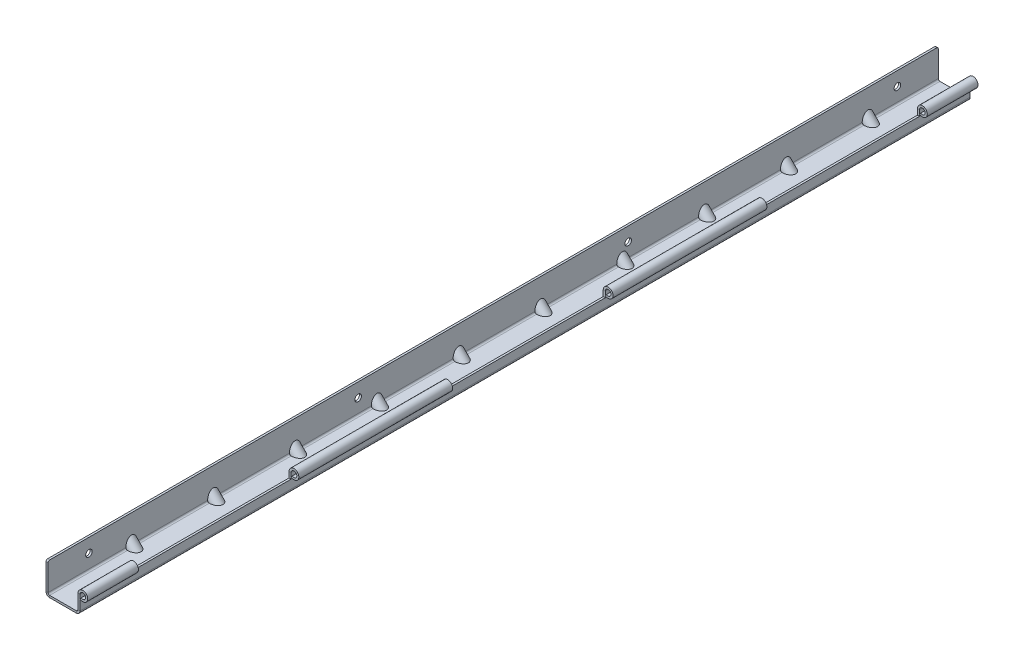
ISO-10303-21;
HEADER;
FILE_DESCRIPTION(('STEP AP214'),'2;1');
FILE_NAME('part.step','',(''),(''),'','','');
FILE_SCHEMA(('AUTOMOTIVE_DESIGN { 1 0 10303 214 1 1 1 1 }'));
ENDSEC;
DATA;
#1=APPLICATION_CONTEXT('core data for automotive mechanical design processes');
#2=APPLICATION_PROTOCOL_DEFINITION('international standard','automotive_design',2000,#1);
#3=PRODUCT_CONTEXT('',#1,'mechanical');
#4=PRODUCT('Part','Part','',(#3));
#5=PRODUCT_RELATED_PRODUCT_CATEGORY('part','',(#4));
#6=PRODUCT_DEFINITION_FORMATION('','',#4);
#7=PRODUCT_DEFINITION_CONTEXT('part definition',#1,'design');
#8=PRODUCT_DEFINITION('design','',#6,#7);
#9=PRODUCT_DEFINITION_SHAPE('','',#8);
#10=(LENGTH_UNIT() NAMED_UNIT(*) SI_UNIT(.MILLI.,.METRE.));
#11=(NAMED_UNIT(*) PLANE_ANGLE_UNIT() SI_UNIT($,.RADIAN.));
#12=(NAMED_UNIT(*) SI_UNIT($,.STERADIAN.) SOLID_ANGLE_UNIT());
#13=UNCERTAINTY_MEASURE_WITH_UNIT(LENGTH_MEASURE(1.E-05),#10,'distance_accuracy_value','');
#14=(GEOMETRIC_REPRESENTATION_CONTEXT(3) GLOBAL_UNCERTAINTY_ASSIGNED_CONTEXT((#13)) GLOBAL_UNIT_ASSIGNED_CONTEXT((#10,
#11,#12)) REPRESENTATION_CONTEXT('',''));
#15=CARTESIAN_POINT('',(0.,0.,0.));
#16=DIRECTION('',(0.,0.,1.));
#17=DIRECTION('',(1.,0.,0.));
#18=AXIS2_PLACEMENT_3D('',#15,#16,#17);
#19=CARTESIAN_POINT('',(39.,-23.,544.));
#20=DIRECTION('',(0.,1.,0.));
#21=DIRECTION('',(0.,0.,1.));
#22=AXIS2_PLACEMENT_3D('',#19,#20,#21);
#23=PLANE('',#22);
#24=DIRECTION('',(1.,0.,0.));
#25=VECTOR('',#24,1.);
#26=CARTESIAN_POINT('',(39.,-23.,-98.));
#27=LINE('',#26,#25);
#28=CARTESIAN_POINT('',(39.,-23.,-98.));
#29=VERTEX_POINT('',#28);
#30=CARTESIAN_POINT('',(41.5,-23.,-98.));
#31=VERTEX_POINT('',#30);
#32=EDGE_CURVE('E860',#29,#31,#27,.T.);
#33=ORIENTED_EDGE('',*,*,#32,.F.);
#34=DIRECTION('',(0.,0.,-1.));
#35=VECTOR('',#34,1.);
#36=CARTESIAN_POINT('',(39.,-23.,544.));
#37=LINE('',#36,#35);
#38=CARTESIAN_POINT('',(39.,-23.,98.));
#39=VERTEX_POINT('',#38);
#40=EDGE_CURVE('E927',#39,#29,#37,.T.);
#41=ORIENTED_EDGE('',*,*,#40,.F.);
#42=DIRECTION('',(1.,0.,0.));
#43=VECTOR('',#42,1.);
#44=CARTESIAN_POINT('',(39.,-23.,98.));
#45=LINE('',#44,#43);
#46=CARTESIAN_POINT('',(41.5,-23.,98.));
#47=VERTEX_POINT('',#46);
#48=EDGE_CURVE('E898',#39,#47,#45,.T.);
#49=ORIENTED_EDGE('',*,*,#48,.T.);
#50=DIRECTION('',(0.,0.,-1.));
#51=VECTOR('',#50,1.);
#52=CARTESIAN_POINT('',(41.5,-23.,544.));
#53=LINE('',#52,#51);
#54=EDGE_CURVE('E933',#47,#31,#53,.T.);
#55=ORIENTED_EDGE('',*,*,#54,.T.);
#56=EDGE_LOOP('',(#33,#41,#49,#55));
#57=FACE_BOUND('',#56,.T.);
#58=ADVANCED_FACE('F32',(#57),#23,.T.);
#59=DIRECTION('',(1.,0.,0.));
#60=VECTOR('',#59,1.);
#61=CARTESIAN_POINT('',(39.,-23.,286.));
#62=LINE('',#61,#60);
#63=CARTESIAN_POINT('',(39.,-23.,286.));
#64=VERTEX_POINT('',#63);
#65=CARTESIAN_POINT('',(41.5,-23.,286.));
#66=VERTEX_POINT('',#65);
#67=EDGE_CURVE('E885',#64,#66,#62,.T.);
#68=ORIENTED_EDGE('',*,*,#67,.F.);
#69=CARTESIAN_POINT('',(39.,-23.,482.));
#70=VERTEX_POINT('',#69);
#71=EDGE_CURVE('E931',#70,#64,#37,.T.);
#72=ORIENTED_EDGE('',*,*,#71,.F.);
#73=DIRECTION('',(1.,0.,0.));
#74=VECTOR('',#73,1.);
#75=CARTESIAN_POINT('',(39.,-23.,482.));
#76=LINE('',#75,#74);
#77=CARTESIAN_POINT('',(41.5,-23.,482.));
#78=VERTEX_POINT('',#77);
#79=EDGE_CURVE('E905',#70,#78,#76,.T.);
#80=ORIENTED_EDGE('',*,*,#79,.T.);
#81=EDGE_CURVE('E1635',#78,#66,#53,.T.);
#82=ORIENTED_EDGE('',*,*,#81,.T.);
#83=EDGE_LOOP('',(#68,#72,#80,#82));
#84=FACE_BOUND('',#83,.T.);
#85=ADVANCED_FACE('F1554',(#84),#23,.T.);
#86=DIRECTION('',(1.,0.,0.));
#87=VECTOR('',#86,1.);
#88=CARTESIAN_POINT('',(39.,-23.,-482.));
#89=LINE('',#88,#87);
#90=CARTESIAN_POINT('',(39.,-23.,-482.));
#91=VERTEX_POINT('',#90);
#92=CARTESIAN_POINT('',(41.5,-23.,-482.));
#93=VERTEX_POINT('',#92);
#94=EDGE_CURVE('E845',#91,#93,#89,.T.);
#95=ORIENTED_EDGE('',*,*,#94,.F.);
#96=CARTESIAN_POINT('',(39.,-23.,-286.));
#97=VERTEX_POINT('',#96);
#98=EDGE_CURVE('E932',#97,#91,#37,.T.);
#99=ORIENTED_EDGE('',*,*,#98,.F.);
#100=DIRECTION('',(1.,0.,0.));
#101=VECTOR('',#100,1.);
#102=CARTESIAN_POINT('',(39.,-23.,-286.));
#103=LINE('',#102,#101);
#104=CARTESIAN_POINT('',(41.5,-23.,-286.));
#105=VERTEX_POINT('',#104);
#106=EDGE_CURVE('E873',#97,#105,#103,.T.);
#107=ORIENTED_EDGE('',*,*,#106,.T.);
#108=EDGE_CURVE('E949',#105,#93,#53,.T.);
#109=ORIENTED_EDGE('',*,*,#108,.T.);
#110=EDGE_LOOP('',(#95,#99,#107,#109));
#111=FACE_BOUND('',#110,.T.);
#112=ADVANCED_FACE('F1515',(#111),#23,.T.);
#113=CARTESIAN_POINT('',(0.,0.,544.));
#114=DIRECTION('',(1.,0.,0.));
#115=DIRECTION('',(0.,1.,0.));
#116=AXIS2_PLACEMENT_3D('',#113,#114,#115);
#117=PLANE('',#116);
#118=CARTESIAN_POINT('',(0.,-17.,494.));
#119=DIRECTION('',(1.,0.,0.));
#120=DIRECTION('',(0.,1.,0.));
#121=AXIS2_PLACEMENT_3D('',#118,#119,#120);
#122=CIRCLE('',#121,3.99999999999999);
#123=CARTESIAN_POINT('',(0.,-13.,494.));
#124=VERTEX_POINT('',#123);
#125=EDGE_CURVE('E1452',#124,#124,#122,.T.);
#126=ORIENTED_EDGE('',*,*,#125,.T.);
#127=EDGE_LOOP('',(#126));
#128=FACE_BOUND('',#127,.T.);
#129=CARTESIAN_POINT('',(0.,-17.,165.));
#130=DIRECTION('',(1.,0.,0.));
#131=DIRECTION('',(0.,1.,0.));
#132=AXIS2_PLACEMENT_3D('',#129,#130,#131);
#133=CIRCLE('',#132,3.99999999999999);
#134=CARTESIAN_POINT('',(0.,-13.,165.));
#135=VERTEX_POINT('',#134);
#136=EDGE_CURVE('E1458',#135,#135,#133,.T.);
#137=ORIENTED_EDGE('',*,*,#136,.T.);
#138=EDGE_LOOP('',(#137));
#139=FACE_BOUND('',#138,.T.);
#140=CARTESIAN_POINT('',(0.,-17.,-165.));
#141=DIRECTION('',(1.,0.,0.));
#142=DIRECTION('',(0.,1.,0.));
#143=AXIS2_PLACEMENT_3D('',#140,#141,#142);
#144=CIRCLE('',#143,3.99999999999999);
#145=CARTESIAN_POINT('',(0.,-13.,-165.));
#146=VERTEX_POINT('',#145);
#147=EDGE_CURVE('E1464',#146,#146,#144,.T.);
#148=ORIENTED_EDGE('',*,*,#147,.T.);
#149=EDGE_LOOP('',(#148));
#150=FACE_BOUND('',#149,.T.);
#151=CARTESIAN_POINT('',(0.,-17.,-494.));
#152=DIRECTION('',(1.,0.,0.));
#153=DIRECTION('',(0.,1.,0.));
#154=AXIS2_PLACEMENT_3D('',#151,#152,#153);
#155=CIRCLE('',#154,3.99999999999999);
#156=CARTESIAN_POINT('',(0.,-13.,-494.));
#157=VERTEX_POINT('',#156);
#158=EDGE_CURVE('E1470',#157,#157,#155,.T.);
#159=ORIENTED_EDGE('',*,*,#158,.T.);
#160=EDGE_LOOP('',(#159));
#161=FACE_BOUND('',#160,.T.);
#162=DIRECTION('',(0.,0.,-1.));
#163=VECTOR('',#162,1.);
#164=CARTESIAN_POINT('',(0.,0.,544.));
#165=LINE('',#164,#163);
#166=CARTESIAN_POINT('',(0.,0.,542.));
#167=VERTEX_POINT('',#166);
#168=CARTESIAN_POINT('',(0.,0.,-542.));
#169=VERTEX_POINT('',#168);
#170=EDGE_CURVE('E972',#167,#169,#165,.T.);
#171=ORIENTED_EDGE('',*,*,#170,.T.);
#172=CARTESIAN_POINT('',(0.,-2.,-542.));
#173=DIRECTION('',(1.,0.,0.));
#174=DIRECTION('',(0.,1.,0.));
#175=AXIS2_PLACEMENT_3D('',#172,#173,#174);
#176=CIRCLE('',#175,2.);
#177=CARTESIAN_POINT('',(0.,-2.,-544.));
#178=VERTEX_POINT('',#177);
#179=EDGE_CURVE('E40',#169,#178,#176,.F.);
#180=ORIENTED_EDGE('',*,*,#179,.T.);
#181=DIRECTION('',(0.,-1.,0.));
#182=VECTOR('',#181,1.);
#183=CARTESIAN_POINT('',(0.,0.,-544.));
#184=LINE('',#183,#182);
#185=CARTESIAN_POINT('',(0.,-33.5,-544.));
#186=VERTEX_POINT('',#185);
#187=EDGE_CURVE('E970',#178,#186,#184,.T.);
#188=ORIENTED_EDGE('',*,*,#187,.T.);
#189=DIRECTION('',(0.,0.,-1.));
#190=VECTOR('',#189,1.);
#191=CARTESIAN_POINT('',(0.,-33.5,544.));
#192=LINE('',#191,#190);
#193=CARTESIAN_POINT('',(0.,-33.5,-462.));
#194=VERTEX_POINT('',#193);
#195=EDGE_CURVE('E1069',#194,#186,#192,.T.);
#196=ORIENTED_EDGE('',*,*,#195,.F.);
#197=DIRECTION('',(0.,-1.,0.));
#198=VECTOR('',#197,1.);
#199=CARTESIAN_POINT('',(0.,0.,-462.));
#200=LINE('',#199,#198);
#201=CARTESIAN_POINT('',(0.,-31.1005050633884,-462.));
#202=VERTEX_POINT('',#201);
#203=EDGE_CURVE('E2048',#202,#194,#200,.T.);
#204=ORIENTED_EDGE('',*,*,#203,.F.);
#205=CARTESIAN_POINT('',(0.,-31.1005050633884,-458.));
#206=DIRECTION('',(1.,0.,0.));
#207=DIRECTION('',(0.,-1.,0.));
#208=AXIS2_PLACEMENT_3D('',#205,#206,#207);
#209=ELLIPSE('',#208,5.65685424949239,4.);
#210=CARTESIAN_POINT('',(0.,-31.1005050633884,-454.));
#211=VERTEX_POINT('',#210);
#212=EDGE_CURVE('E2050',#211,#202,#209,.F.);
#213=ORIENTED_EDGE('',*,*,#212,.F.);
#214=DIRECTION('',(0.,1.,0.));
#215=VECTOR('',#214,1.);
#216=CARTESIAN_POINT('',(0.,1.87350135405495E-13,-454.));
#217=LINE('',#216,#215);
#218=CARTESIAN_POINT('',(0.,-33.5,-454.));
#219=VERTEX_POINT('',#218);
#220=EDGE_CURVE('E2039',#219,#211,#217,.T.);
#221=ORIENTED_EDGE('',*,*,#220,.F.);
#222=CARTESIAN_POINT('',(0.,-33.5,-362.));
#223=VERTEX_POINT('',#222);
#224=EDGE_CURVE('E1074',#223,#219,#192,.T.);
#225=ORIENTED_EDGE('',*,*,#224,.F.);
#226=DIRECTION('',(0.,-1.,0.));
#227=VECTOR('',#226,1.);
#228=CARTESIAN_POINT('',(0.,0.,-362.));
#229=LINE('',#228,#227);
#230=CARTESIAN_POINT('',(0.,-31.1005050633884,-362.));
#231=VERTEX_POINT('',#230);
#232=EDGE_CURVE('E1391',#231,#223,#229,.T.);
#233=ORIENTED_EDGE('',*,*,#232,.F.);
#234=CARTESIAN_POINT('',(0.,-31.1005050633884,-358.));
#235=DIRECTION('',(1.,0.,0.));
#236=DIRECTION('',(0.,-1.,0.));
#237=AXIS2_PLACEMENT_3D('',#234,#235,#236);
#238=ELLIPSE('',#237,5.65685424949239,4.);
#239=CARTESIAN_POINT('',(0.,-31.1005050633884,-354.));
#240=VERTEX_POINT('',#239);
#241=EDGE_CURVE('E1393',#240,#231,#238,.F.);
#242=ORIENTED_EDGE('',*,*,#241,.F.);
#243=DIRECTION('',(0.,1.,0.));
#244=VECTOR('',#243,1.);
#245=CARTESIAN_POINT('',(0.,1.70002900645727E-13,-354.));
#246=LINE('',#245,#244);
#247=CARTESIAN_POINT('',(0.,-33.5,-354.));
#248=VERTEX_POINT('',#247);
#249=EDGE_CURVE('E1387',#248,#240,#246,.T.);
#250=ORIENTED_EDGE('',*,*,#249,.F.);
#251=CARTESIAN_POINT('',(0.,-33.5,-262.));
#252=VERTEX_POINT('',#251);
#253=EDGE_CURVE('E1081',#252,#248,#192,.T.);
#254=ORIENTED_EDGE('',*,*,#253,.F.);
#255=DIRECTION('',(0.,-1.,0.));
#256=VECTOR('',#255,1.);
#257=CARTESIAN_POINT('',(0.,0.,-262.));
#258=LINE('',#257,#256);
#259=CARTESIAN_POINT('',(0.,-31.1005050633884,-262.));
#260=VERTEX_POINT('',#259);
#261=EDGE_CURVE('E1261',#260,#252,#258,.T.);
#262=ORIENTED_EDGE('',*,*,#261,.F.);
#263=CARTESIAN_POINT('',(0.,-31.1005050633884,-258.));
#264=DIRECTION('',(1.,0.,0.));
#265=DIRECTION('',(0.,-1.,0.));
#266=AXIS2_PLACEMENT_3D('',#263,#264,#265);
#267=ELLIPSE('',#266,5.65685424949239,4.);
#268=CARTESIAN_POINT('',(0.,-31.1005050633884,-254.));
#269=VERTEX_POINT('',#268);
#270=EDGE_CURVE('E1263',#269,#260,#267,.F.);
#271=ORIENTED_EDGE('',*,*,#270,.F.);
#272=DIRECTION('',(0.,1.,0.));
#273=VECTOR('',#272,1.);
#274=CARTESIAN_POINT('',(0.,1.49186218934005E-13,-254.));
#275=LINE('',#274,#273);
#276=CARTESIAN_POINT('',(0.,-33.5,-254.));
#277=VERTEX_POINT('',#276);
#278=EDGE_CURVE('E1257',#277,#269,#275,.T.);
#279=ORIENTED_EDGE('',*,*,#278,.F.);
#280=CARTESIAN_POINT('',(0.,-33.5,-162.));
#281=VERTEX_POINT('',#280);
#282=EDGE_CURVE('E1082',#281,#277,#192,.T.);
#283=ORIENTED_EDGE('',*,*,#282,.F.);
#284=DIRECTION('',(0.,-1.,0.));
#285=VECTOR('',#284,1.);
#286=CARTESIAN_POINT('',(0.,0.,-162.));
#287=LINE('',#286,#285);
#288=CARTESIAN_POINT('',(0.,-31.1005050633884,-162.));
#289=VERTEX_POINT('',#288);
#290=EDGE_CURVE('E1328',#289,#281,#287,.T.);
#291=ORIENTED_EDGE('',*,*,#290,.F.);
#292=CARTESIAN_POINT('',(0.,-31.1005050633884,-158.));
#293=DIRECTION('',(1.,0.,0.));
#294=DIRECTION('',(0.,-1.,0.));
#295=AXIS2_PLACEMENT_3D('',#292,#293,#294);
#296=ELLIPSE('',#295,5.65685424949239,4.);
#297=CARTESIAN_POINT('',(0.,-31.1005050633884,-154.));
#298=VERTEX_POINT('',#297);
#299=EDGE_CURVE('E1330',#298,#289,#296,.F.);
#300=ORIENTED_EDGE('',*,*,#299,.F.);
#301=DIRECTION('',(0.,1.,0.));
#302=VECTOR('',#301,1.);
#303=CARTESIAN_POINT('',(0.,1.31838984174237E-13,-154.));
#304=LINE('',#303,#302);
#305=CARTESIAN_POINT('',(0.,-33.5,-154.));
#306=VERTEX_POINT('',#305);
#307=EDGE_CURVE('E1324',#306,#298,#304,.T.);
#308=ORIENTED_EDGE('',*,*,#307,.F.);
#309=CARTESIAN_POINT('',(0.,-33.5,-61.9999999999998));
#310=VERTEX_POINT('',#309);
#311=EDGE_CURVE('E1087',#310,#306,#192,.T.);
#312=ORIENTED_EDGE('',*,*,#311,.F.);
#313=DIRECTION('',(0.,-1.,0.));
#314=VECTOR('',#313,1.);
#315=CARTESIAN_POINT('',(0.,0.,-61.9999999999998));
#316=LINE('',#315,#314);
#317=CARTESIAN_POINT('',(0.,-31.1005050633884,-61.9999999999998));
#318=VERTEX_POINT('',#317);
#319=EDGE_CURVE('E1234',#318,#310,#316,.T.);
#320=ORIENTED_EDGE('',*,*,#319,.F.);
#321=CARTESIAN_POINT('',(0.,-31.1005050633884,-57.9999999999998));
#322=DIRECTION('',(1.,0.,0.));
#323=DIRECTION('',(0.,-1.,0.));
#324=AXIS2_PLACEMENT_3D('',#321,#322,#323);
#325=ELLIPSE('',#324,5.65685424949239,4.);
#326=CARTESIAN_POINT('',(0.,-31.1005050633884,-53.9999999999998));
#327=VERTEX_POINT('',#326);
#328=EDGE_CURVE('E1236',#327,#318,#325,.F.);
#329=ORIENTED_EDGE('',*,*,#328,.F.);
#330=DIRECTION('',(0.,1.,0.));
#331=VECTOR('',#330,1.);
#332=CARTESIAN_POINT('',(0.,1.14491749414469E-13,-53.9999999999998));
#333=LINE('',#332,#331);
#334=CARTESIAN_POINT('',(0.,-33.5,-53.9999999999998));
#335=VERTEX_POINT('',#334);
#336=EDGE_CURVE('E1230',#335,#327,#333,.T.);
#337=ORIENTED_EDGE('',*,*,#336,.F.);
#338=CARTESIAN_POINT('',(0.,-33.5,38.0000000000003));
#339=VERTEX_POINT('',#338);
#340=EDGE_CURVE('E1093',#339,#335,#192,.T.);
#341=ORIENTED_EDGE('',*,*,#340,.F.);
#342=DIRECTION('',(0.,-1.,0.));
#343=VECTOR('',#342,1.);
#344=CARTESIAN_POINT('',(0.,0.,38.0000000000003));
#345=LINE('',#344,#343);
#346=CARTESIAN_POINT('',(0.,-31.1005050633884,38.0000000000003));
#347=VERTEX_POINT('',#346);
#348=EDGE_CURVE('E1205',#347,#339,#345,.T.);
#349=ORIENTED_EDGE('',*,*,#348,.F.);
#350=CARTESIAN_POINT('',(0.,-31.1005050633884,42.0000000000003));
#351=DIRECTION('',(1.,0.,0.));
#352=DIRECTION('',(0.,-1.,0.));
#353=AXIS2_PLACEMENT_3D('',#350,#351,#352);
#354=ELLIPSE('',#353,5.65685424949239,4.);
#355=CARTESIAN_POINT('',(0.,-31.1005050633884,46.0000000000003));
#356=VERTEX_POINT('',#355);
#357=EDGE_CURVE('E1207',#356,#347,#354,.F.);
#358=ORIENTED_EDGE('',*,*,#357,.F.);
#359=DIRECTION('',(0.,1.,0.));
#360=VECTOR('',#359,1.);
#361=CARTESIAN_POINT('',(0.,0.,46.0000000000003));
#362=LINE('',#361,#360);
#363=CARTESIAN_POINT('',(0.,-33.5,46.0000000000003));
#364=VERTEX_POINT('',#363);
#365=EDGE_CURVE('E1201',#364,#356,#362,.T.);
#366=ORIENTED_EDGE('',*,*,#365,.F.);
#367=CARTESIAN_POINT('',(0.,-33.5,138.));
#368=VERTEX_POINT('',#367);
#369=EDGE_CURVE('E1099',#368,#364,#192,.T.);
#370=ORIENTED_EDGE('',*,*,#369,.F.);
#371=DIRECTION('',(0.,-1.,0.));
#372=VECTOR('',#371,1.);
#373=CARTESIAN_POINT('',(0.,0.,138.));
#374=LINE('',#373,#372);
#375=CARTESIAN_POINT('',(0.,-31.1005050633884,138.));
#376=VERTEX_POINT('',#375);
#377=EDGE_CURVE('E1176',#376,#368,#374,.T.);
#378=ORIENTED_EDGE('',*,*,#377,.F.);
#379=CARTESIAN_POINT('',(0.,-31.1005050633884,142.));
#380=DIRECTION('',(1.,0.,0.));
#381=DIRECTION('',(0.,-1.,0.));
#382=AXIS2_PLACEMENT_3D('',#379,#380,#381);
#383=ELLIPSE('',#382,5.65685424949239,4.);
#384=CARTESIAN_POINT('',(0.,-31.1005050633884,146.));
#385=VERTEX_POINT('',#384);
#386=EDGE_CURVE('E1178',#385,#376,#383,.F.);
#387=ORIENTED_EDGE('',*,*,#386,.F.);
#388=DIRECTION('',(0.,1.,0.));
#389=VECTOR('',#388,1.);
#390=CARTESIAN_POINT('',(0.,0.,146.));
#391=LINE('',#390,#389);
#392=CARTESIAN_POINT('',(0.,-33.5,146.));
#393=VERTEX_POINT('',#392);
#394=EDGE_CURVE('E1172',#393,#385,#391,.T.);
#395=ORIENTED_EDGE('',*,*,#394,.F.);
#396=CARTESIAN_POINT('',(0.,-33.5,238.));
#397=VERTEX_POINT('',#396);
#398=EDGE_CURVE('E1105',#397,#393,#192,.T.);
#399=ORIENTED_EDGE('',*,*,#398,.F.);
#400=DIRECTION('',(0.,-1.,0.));
#401=VECTOR('',#400,1.);
#402=CARTESIAN_POINT('',(0.,0.,238.));
#403=LINE('',#402,#401);
#404=CARTESIAN_POINT('',(0.,-31.1005050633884,238.));
#405=VERTEX_POINT('',#404);
#406=EDGE_CURVE('E1143',#405,#397,#403,.T.);
#407=ORIENTED_EDGE('',*,*,#406,.F.);
#408=CARTESIAN_POINT('',(0.,-31.1005050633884,242.));
#409=DIRECTION('',(1.,0.,0.));
#410=DIRECTION('',(0.,-1.,0.));
#411=AXIS2_PLACEMENT_3D('',#408,#409,#410);
#412=ELLIPSE('',#411,5.65685424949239,4.);
#413=CARTESIAN_POINT('',(0.,-31.1005050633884,246.));
#414=VERTEX_POINT('',#413);
#415=EDGE_CURVE('E1140',#414,#405,#412,.F.);
#416=ORIENTED_EDGE('',*,*,#415,.F.);
#417=DIRECTION('',(0.,1.,0.));
#418=VECTOR('',#417,1.);
#419=CARTESIAN_POINT('',(0.,0.,246.));
#420=LINE('',#419,#418);
#421=CARTESIAN_POINT('',(0.,-33.5,246.));
#422=VERTEX_POINT('',#421);
#423=EDGE_CURVE('E1131',#422,#414,#420,.T.);
#424=ORIENTED_EDGE('',*,*,#423,.F.);
#425=CARTESIAN_POINT('',(0.,-33.5,338.));
#426=VERTEX_POINT('',#425);
#427=EDGE_CURVE('E1079',#426,#422,#192,.T.);
#428=ORIENTED_EDGE('',*,*,#427,.F.);
#429=DIRECTION('',(0.,-1.,0.));
#430=VECTOR('',#429,1.);
#431=CARTESIAN_POINT('',(0.,0.,338.));
#432=LINE('',#431,#430);
#433=CARTESIAN_POINT('',(0.,-31.1005050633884,338.));
#434=VERTEX_POINT('',#433);
#435=EDGE_CURVE('E2105',#434,#426,#432,.T.);
#436=ORIENTED_EDGE('',*,*,#435,.F.);
#437=CARTESIAN_POINT('',(0.,-31.1005050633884,342.));
#438=DIRECTION('',(1.,0.,0.));
#439=DIRECTION('',(0.,-1.,0.));
#440=AXIS2_PLACEMENT_3D('',#437,#438,#439);
#441=ELLIPSE('',#440,5.65685424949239,4.);
#442=CARTESIAN_POINT('',(0.,-31.1005050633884,346.));
#443=VERTEX_POINT('',#442);
#444=EDGE_CURVE('E2107',#443,#434,#441,.F.);
#445=ORIENTED_EDGE('',*,*,#444,.F.);
#446=DIRECTION('',(0.,1.,0.));
#447=VECTOR('',#446,1.);
#448=CARTESIAN_POINT('',(0.,0.,346.));
#449=LINE('',#448,#447);
#450=CARTESIAN_POINT('',(0.,-33.5,346.));
#451=VERTEX_POINT('',#450);
#452=EDGE_CURVE('E2101',#451,#443,#449,.T.);
#453=ORIENTED_EDGE('',*,*,#452,.F.);
#454=CARTESIAN_POINT('',(0.,-33.5,438.));
#455=VERTEX_POINT('',#454);
#456=EDGE_CURVE('E1073',#455,#451,#192,.T.);
#457=ORIENTED_EDGE('',*,*,#456,.F.);
#458=DIRECTION('',(0.,-1.,0.));
#459=VECTOR('',#458,1.);
#460=CARTESIAN_POINT('',(0.,0.,438.));
#461=LINE('',#460,#459);
#462=CARTESIAN_POINT('',(0.,-31.1005050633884,438.));
#463=VERTEX_POINT('',#462);
#464=EDGE_CURVE('E2076',#463,#455,#461,.T.);
#465=ORIENTED_EDGE('',*,*,#464,.F.);
#466=CARTESIAN_POINT('',(0.,-31.1005050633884,442.));
#467=DIRECTION('',(1.,0.,0.));
#468=DIRECTION('',(0.,-1.,0.));
#469=AXIS2_PLACEMENT_3D('',#466,#467,#468);
#470=ELLIPSE('',#469,5.65685424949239,4.);
#471=CARTESIAN_POINT('',(0.,-31.1005050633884,446.));
#472=VERTEX_POINT('',#471);
#473=EDGE_CURVE('E2078',#472,#463,#470,.F.);
#474=ORIENTED_EDGE('',*,*,#473,.F.);
#475=DIRECTION('',(0.,1.,0.));
#476=VECTOR('',#475,1.);
#477=CARTESIAN_POINT('',(0.,0.,446.));
#478=LINE('',#477,#476);
#479=CARTESIAN_POINT('',(0.,-33.5,446.));
#480=VERTEX_POINT('',#479);
#481=EDGE_CURVE('E2072',#480,#472,#478,.T.);
#482=ORIENTED_EDGE('',*,*,#481,.F.);
#483=CARTESIAN_POINT('',(0.,-33.5,544.));
#484=VERTEX_POINT('',#483);
#485=EDGE_CURVE('E999',#484,#480,#192,.T.);
#486=ORIENTED_EDGE('',*,*,#485,.F.);
#487=DIRECTION('',(0.,-1.,0.));
#488=VECTOR('',#487,1.);
#489=CARTESIAN_POINT('',(0.,0.,544.));
#490=LINE('',#489,#488);
#491=CARTESIAN_POINT('',(0.,-2.,544.));
#492=VERTEX_POINT('',#491);
#493=EDGE_CURVE('E1487',#492,#484,#490,.T.);
#494=ORIENTED_EDGE('',*,*,#493,.F.);
#495=CARTESIAN_POINT('',(0.,-2.,542.));
#496=DIRECTION('',(1.,0.,0.));
#497=DIRECTION('',(0.,1.,0.));
#498=AXIS2_PLACEMENT_3D('',#495,#496,#497);
#499=CIRCLE('',#498,2.);
#500=EDGE_CURVE('E964',#492,#167,#499,.F.);
#501=ORIENTED_EDGE('',*,*,#500,.T.);
#502=EDGE_LOOP('',(#171,#180,#188,#196,#204,#213,#221,#225,#233,#242,#250,#254,#262,#271,#279,
#283,#291,#300,#308,#312,#320,#329,#337,#341,#349,#358,#366,#370,#378,#387,#395,#399,#407,#416,
#424,#428,#436,#445,#453,#457,#465,#474,#482,#486,#494,#501));
#503=FACE_BOUND('',#502,.T.);
#504=ADVANCED_FACE('F968',(#128,#139,#150,#161,#503),#117,.F.);
#505=CARTESIAN_POINT('',(0.,-38.,544.));
#506=DIRECTION('',(0.,1.,0.));
#507=DIRECTION('',(0.,0.,1.));
#508=AXIS2_PLACEMENT_3D('',#505,#506,#507);
#509=PLANE('',#508);
#510=DIRECTION('',(1.,0.,0.));
#511=VECTOR('',#510,1.);
#512=CARTESIAN_POINT('',(-1.83880688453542E-13,-38.,-462.));
#513=LINE('',#512,#511);
#514=CARTESIAN_POINT('',(4.5,-38.,-462.));
#515=VERTEX_POINT('',#514);
#516=CARTESIAN_POINT('',(6.89949493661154,-38.,-462.));
#517=VERTEX_POINT('',#516);
#518=EDGE_CURVE('E2044',#515,#517,#513,.T.);
#519=ORIENTED_EDGE('',*,*,#518,.F.);
#520=DIRECTION('',(0.,0.,-1.));
#521=VECTOR('',#520,1.);
#522=CARTESIAN_POINT('',(4.5,-38.,544.));
#523=LINE('',#522,#521);
#524=CARTESIAN_POINT('',(4.5,-38.,-544.));
#525=VERTEX_POINT('',#524);
#526=EDGE_CURVE('E1066',#515,#525,#523,.T.);
#527=ORIENTED_EDGE('',*,*,#526,.T.);
#528=DIRECTION('',(1.,0.,0.));
#529=VECTOR('',#528,1.);
#530=CARTESIAN_POINT('',(0.,-38.,-544.));
#531=LINE('',#530,#529);
#532=CARTESIAN_POINT('',(37.,-38.,-544.));
#533=VERTEX_POINT('',#532);
#534=EDGE_CURVE('E1053',#525,#533,#531,.T.);
#535=ORIENTED_EDGE('',*,*,#534,.T.);
#536=DIRECTION('',(0.,0.,-1.));
#537=VECTOR('',#536,1.);
#538=CARTESIAN_POINT('',(37.,-38.,544.));
#539=LINE('',#538,#537);
#540=CARTESIAN_POINT('',(37.,-38.,544.));
#541=VERTEX_POINT('',#540);
#542=EDGE_CURVE('E1062',#541,#533,#539,.T.);
#543=ORIENTED_EDGE('',*,*,#542,.F.);
#544=DIRECTION('',(1.,0.,0.));
#545=VECTOR('',#544,1.);
#546=CARTESIAN_POINT('',(0.,-38.,544.));
#547=LINE('',#546,#545);
#548=CARTESIAN_POINT('',(4.5,-38.,544.));
#549=VERTEX_POINT('',#548);
#550=EDGE_CURVE('E1492',#549,#541,#547,.T.);
#551=ORIENTED_EDGE('',*,*,#550,.F.);
#552=CARTESIAN_POINT('',(4.5,-38.,446.));
#553=VERTEX_POINT('',#552);
#554=EDGE_CURVE('E1067',#549,#553,#523,.T.);
#555=ORIENTED_EDGE('',*,*,#554,.T.);
#556=DIRECTION('',(-1.,0.,0.));
#557=VECTOR('',#556,1.);
#558=CARTESIAN_POINT('',(0.,-38.,446.));
#559=LINE('',#558,#557);
#560=CARTESIAN_POINT('',(6.89949493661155,-38.,446.));
#561=VERTEX_POINT('',#560);
#562=EDGE_CURVE('E2070',#561,#553,#559,.T.);
#563=ORIENTED_EDGE('',*,*,#562,.F.);
#564=CARTESIAN_POINT('',(6.89949493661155,-38.,442.));
#565=DIRECTION('',(0.,1.,0.));
#566=DIRECTION('',(1.,0.,0.));
#567=AXIS2_PLACEMENT_3D('',#564,#565,#566);
#568=ELLIPSE('',#567,5.65685424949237,4.);
#569=CARTESIAN_POINT('',(6.89949493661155,-38.,438.));
#570=VERTEX_POINT('',#569);
#571=EDGE_CURVE('E1978',#570,#561,#568,.F.);
#572=ORIENTED_EDGE('',*,*,#571,.F.);
#573=DIRECTION('',(1.,0.,0.));
#574=VECTOR('',#573,1.);
#575=CARTESIAN_POINT('',(0.,-38.,438.));
#576=LINE('',#575,#574);
#577=CARTESIAN_POINT('',(4.5,-38.,438.));
#578=VERTEX_POINT('',#577);
#579=EDGE_CURVE('E2074',#578,#570,#576,.T.);
#580=ORIENTED_EDGE('',*,*,#579,.F.);
#581=CARTESIAN_POINT('',(4.5,-38.,346.));
#582=VERTEX_POINT('',#581);
#583=EDGE_CURVE('E1070',#578,#582,#523,.T.);
#584=ORIENTED_EDGE('',*,*,#583,.T.);
#585=DIRECTION('',(-1.,0.,0.));
#586=VECTOR('',#585,1.);
#587=CARTESIAN_POINT('',(0.,-38.,346.));
#588=LINE('',#587,#586);
#589=CARTESIAN_POINT('',(6.89949493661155,-38.,346.));
#590=VERTEX_POINT('',#589);
#591=EDGE_CURVE('E2098',#590,#582,#588,.T.);
#592=ORIENTED_EDGE('',*,*,#591,.F.);
#593=CARTESIAN_POINT('',(6.89949493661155,-38.,342.));
#594=DIRECTION('',(0.,1.,0.));
#595=DIRECTION('',(1.,0.,0.));
#596=AXIS2_PLACEMENT_3D('',#593,#594,#595);
#597=ELLIPSE('',#596,5.65685424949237,4.);
#598=CARTESIAN_POINT('',(6.89949493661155,-38.,338.));
#599=VERTEX_POINT('',#598);
#600=EDGE_CURVE('E1929',#599,#590,#597,.F.);
#601=ORIENTED_EDGE('',*,*,#600,.F.);
#602=DIRECTION('',(1.,0.,0.));
#603=VECTOR('',#602,1.);
#604=CARTESIAN_POINT('',(0.,-38.,338.));
#605=LINE('',#604,#603);
#606=CARTESIAN_POINT('',(4.5,-38.,338.));
#607=VERTEX_POINT('',#606);
#608=EDGE_CURVE('E2103',#607,#599,#605,.T.);
#609=ORIENTED_EDGE('',*,*,#608,.F.);
#610=CARTESIAN_POINT('',(4.5,-38.,246.));
#611=VERTEX_POINT('',#610);
#612=EDGE_CURVE('E2130',#607,#611,#523,.T.);
#613=ORIENTED_EDGE('',*,*,#612,.T.);
#614=DIRECTION('',(-1.,0.,0.));
#615=VECTOR('',#614,1.);
#616=CARTESIAN_POINT('',(0.,-38.,246.));
#617=LINE('',#616,#615);
#618=CARTESIAN_POINT('',(6.89949493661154,-38.,246.));
#619=VERTEX_POINT('',#618);
#620=EDGE_CURVE('E1134',#619,#611,#617,.T.);
#621=ORIENTED_EDGE('',*,*,#620,.F.);
#622=CARTESIAN_POINT('',(6.89949493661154,-38.,242.));
#623=DIRECTION('',(0.,1.,0.));
#624=DIRECTION('',(1.,0.,0.));
#625=AXIS2_PLACEMENT_3D('',#622,#623,#624);
#626=ELLIPSE('',#625,5.65685424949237,4.);
#627=CARTESIAN_POINT('',(6.89949493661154,-38.,238.));
#628=VERTEX_POINT('',#627);
#629=EDGE_CURVE('E1881',#628,#619,#626,.F.);
#630=ORIENTED_EDGE('',*,*,#629,.F.);
#631=DIRECTION('',(1.,0.,0.));
#632=VECTOR('',#631,1.);
#633=CARTESIAN_POINT('',(0.,-38.,238.));
#634=LINE('',#633,#632);
#635=CARTESIAN_POINT('',(4.5,-38.,238.));
#636=VERTEX_POINT('',#635);
#637=EDGE_CURVE('E1141',#636,#628,#634,.T.);
#638=ORIENTED_EDGE('',*,*,#637,.F.);
#639=CARTESIAN_POINT('',(4.5,-38.,146.));
#640=VERTEX_POINT('',#639);
#641=EDGE_CURVE('E2132',#636,#640,#523,.T.);
#642=ORIENTED_EDGE('',*,*,#641,.T.);
#643=DIRECTION('',(-1.,0.,0.));
#644=VECTOR('',#643,1.);
#645=CARTESIAN_POINT('',(0.,-38.,146.));
#646=LINE('',#645,#644);
#647=CARTESIAN_POINT('',(6.89949493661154,-38.,146.));
#648=VERTEX_POINT('',#647);
#649=EDGE_CURVE('E1169',#648,#640,#646,.T.);
#650=ORIENTED_EDGE('',*,*,#649,.F.);
#651=CARTESIAN_POINT('',(6.89949493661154,-38.,142.));
#652=DIRECTION('',(0.,1.,0.));
#653=DIRECTION('',(1.,0.,0.));
#654=AXIS2_PLACEMENT_3D('',#651,#652,#653);
#655=ELLIPSE('',#654,5.65685424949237,4.);
#656=CARTESIAN_POINT('',(6.89949493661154,-38.,138.));
#657=VERTEX_POINT('',#656);
#658=EDGE_CURVE('E1836',#657,#648,#655,.F.);
#659=ORIENTED_EDGE('',*,*,#658,.F.);
#660=DIRECTION('',(1.,0.,0.));
#661=VECTOR('',#660,1.);
#662=CARTESIAN_POINT('',(0.,-38.,138.));
#663=LINE('',#662,#661);
#664=CARTESIAN_POINT('',(4.5,-38.,138.));
#665=VERTEX_POINT('',#664);
#666=EDGE_CURVE('E1174',#665,#657,#663,.T.);
#667=ORIENTED_EDGE('',*,*,#666,.F.);
#668=CARTESIAN_POINT('',(4.5,-38.,46.0000000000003));
#669=VERTEX_POINT('',#668);
#670=EDGE_CURVE('E2133',#665,#669,#523,.T.);
#671=ORIENTED_EDGE('',*,*,#670,.T.);
#672=DIRECTION('',(-1.,0.,0.));
#673=VECTOR('',#672,1.);
#674=CARTESIAN_POINT('',(0.,-38.,46.0000000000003));
#675=LINE('',#674,#673);
#676=CARTESIAN_POINT('',(6.89949493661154,-38.,46.0000000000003));
#677=VERTEX_POINT('',#676);
#678=EDGE_CURVE('E1198',#677,#669,#675,.T.);
#679=ORIENTED_EDGE('',*,*,#678,.F.);
#680=CARTESIAN_POINT('',(6.89949493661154,-38.,42.0000000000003));
#681=DIRECTION('',(0.,1.,0.));
#682=DIRECTION('',(1.,0.,0.));
#683=AXIS2_PLACEMENT_3D('',#680,#681,#682);
#684=ELLIPSE('',#683,5.65685424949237,4.);
#685=CARTESIAN_POINT('',(6.89949493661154,-38.,38.0000000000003));
#686=VERTEX_POINT('',#685);
#687=EDGE_CURVE('E1787',#686,#677,#684,.F.);
#688=ORIENTED_EDGE('',*,*,#687,.F.);
#689=DIRECTION('',(1.,0.,0.));
#690=VECTOR('',#689,1.);
#691=CARTESIAN_POINT('',(0.,-38.,38.0000000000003));
#692=LINE('',#691,#690);
#693=CARTESIAN_POINT('',(4.5,-38.,38.0000000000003));
#694=VERTEX_POINT('',#693);
#695=EDGE_CURVE('E1203',#694,#686,#692,.T.);
#696=ORIENTED_EDGE('',*,*,#695,.F.);
#697=CARTESIAN_POINT('',(4.5,-38.,-53.9999999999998));
#698=VERTEX_POINT('',#697);
#699=EDGE_CURVE('E2135',#694,#698,#523,.T.);
#700=ORIENTED_EDGE('',*,*,#699,.T.);
#701=DIRECTION('',(-1.,0.,0.));
#702=VECTOR('',#701,1.);
#703=CARTESIAN_POINT('',(0.,-38.,-53.9999999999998));
#704=LINE('',#703,#702);
#705=CARTESIAN_POINT('',(6.89949493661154,-38.,-53.9999999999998));
#706=VERTEX_POINT('',#705);
#707=EDGE_CURVE('E1227',#706,#698,#704,.T.);
#708=ORIENTED_EDGE('',*,*,#707,.F.);
#709=CARTESIAN_POINT('',(6.89949493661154,-38.,-57.9999999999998));
#710=DIRECTION('',(0.,1.,0.));
#711=DIRECTION('',(1.,0.,0.));
#712=AXIS2_PLACEMENT_3D('',#709,#710,#711);
#713=ELLIPSE('',#712,5.65685424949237,4.);
#714=CARTESIAN_POINT('',(6.89949493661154,-38.,-61.9999999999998));
#715=VERTEX_POINT('',#714);
#716=EDGE_CURVE('E1738',#715,#706,#713,.F.);
#717=ORIENTED_EDGE('',*,*,#716,.F.);
#718=DIRECTION('',(1.,0.,0.));
#719=VECTOR('',#718,1.);
#720=CARTESIAN_POINT('',(-1.11022302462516E-13,-38.,-61.9999999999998));
#721=LINE('',#720,#719);
#722=CARTESIAN_POINT('',(4.5,-38.,-61.9999999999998));
#723=VERTEX_POINT('',#722);
#724=EDGE_CURVE('E1232',#723,#715,#721,.T.);
#725=ORIENTED_EDGE('',*,*,#724,.F.);
#726=CARTESIAN_POINT('',(4.5,-38.,-154.));
#727=VERTEX_POINT('',#726);
#728=EDGE_CURVE('E2139',#723,#727,#523,.T.);
#729=ORIENTED_EDGE('',*,*,#728,.T.);
#730=DIRECTION('',(-1.,0.,0.));
#731=VECTOR('',#730,1.);
#732=CARTESIAN_POINT('',(0.,-38.,-154.));
#733=LINE('',#732,#731);
#734=CARTESIAN_POINT('',(6.89949493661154,-38.,-154.));
#735=VERTEX_POINT('',#734);
#736=EDGE_CURVE('E1667',#735,#727,#733,.T.);
#737=ORIENTED_EDGE('',*,*,#736,.F.);
#738=CARTESIAN_POINT('',(6.89949493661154,-38.,-158.));
#739=DIRECTION('',(0.,1.,0.));
#740=DIRECTION('',(1.,0.,0.));
#741=AXIS2_PLACEMENT_3D('',#738,#739,#740);
#742=ELLIPSE('',#741,5.65685424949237,4.);
#743=CARTESIAN_POINT('',(6.89949493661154,-38.,-162.));
#744=VERTEX_POINT('',#743);
#745=EDGE_CURVE('E1670',#744,#735,#742,.F.);
#746=ORIENTED_EDGE('',*,*,#745,.F.);
#747=DIRECTION('',(1.,0.,0.));
#748=VECTOR('',#747,1.);
#749=CARTESIAN_POINT('',(-1.28369537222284E-13,-38.,-162.));
#750=LINE('',#749,#748);
#751=CARTESIAN_POINT('',(4.5,-38.,-162.));
#752=VERTEX_POINT('',#751);
#753=EDGE_CURVE('E1673',#752,#744,#750,.T.);
#754=ORIENTED_EDGE('',*,*,#753,.F.);
#755=CARTESIAN_POINT('',(4.5,-38.,-254.));
#756=VERTEX_POINT('',#755);
#757=EDGE_CURVE('E2143',#752,#756,#523,.T.);
#758=ORIENTED_EDGE('',*,*,#757,.T.);
#759=DIRECTION('',(-1.,0.,0.));
#760=VECTOR('',#759,1.);
#761=CARTESIAN_POINT('',(0.,-38.,-254.));
#762=LINE('',#761,#760);
#763=CARTESIAN_POINT('',(6.89949493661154,-38.,-254.));
#764=VERTEX_POINT('',#763);
#765=EDGE_CURVE('E1684',#764,#756,#762,.T.);
#766=ORIENTED_EDGE('',*,*,#765,.F.);
#767=CARTESIAN_POINT('',(6.89949493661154,-38.,-258.));
#768=DIRECTION('',(0.,1.,0.));
#769=DIRECTION('',(1.,0.,0.));
#770=AXIS2_PLACEMENT_3D('',#767,#768,#769);
#771=ELLIPSE('',#770,5.65685424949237,4.);
#772=CARTESIAN_POINT('',(6.89949493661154,-38.,-262.));
#773=VERTEX_POINT('',#772);
#774=EDGE_CURVE('E1686',#773,#764,#771,.F.);
#775=ORIENTED_EDGE('',*,*,#774,.F.);
#776=DIRECTION('',(1.,0.,0.));
#777=VECTOR('',#776,1.);
#778=CARTESIAN_POINT('',(-1.49186218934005E-13,-38.,-262.));
#779=LINE('',#778,#777);
#780=CARTESIAN_POINT('',(4.5,-38.,-262.));
#781=VERTEX_POINT('',#780);
#782=EDGE_CURVE('E1689',#781,#773,#779,.T.);
#783=ORIENTED_EDGE('',*,*,#782,.F.);
#784=CARTESIAN_POINT('',(4.5,-38.,-354.));
#785=VERTEX_POINT('',#784);
#786=EDGE_CURVE('E2144',#781,#785,#523,.T.);
#787=ORIENTED_EDGE('',*,*,#786,.T.);
#788=DIRECTION('',(-1.,0.,0.));
#789=VECTOR('',#788,1.);
#790=CARTESIAN_POINT('',(0.,-38.,-354.));
#791=LINE('',#790,#789);
#792=CARTESIAN_POINT('',(6.89949493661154,-38.,-354.));
#793=VERTEX_POINT('',#792);
#794=EDGE_CURVE('E1650',#793,#785,#791,.T.);
#795=ORIENTED_EDGE('',*,*,#794,.F.);
#796=CARTESIAN_POINT('',(6.89949493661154,-38.,-358.));
#797=DIRECTION('',(0.,1.,0.));
#798=DIRECTION('',(1.,0.,0.));
#799=AXIS2_PLACEMENT_3D('',#796,#797,#798);
#800=ELLIPSE('',#799,5.65685424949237,4.);
#801=CARTESIAN_POINT('',(6.89949493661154,-38.,-362.));
#802=VERTEX_POINT('',#801);
#803=EDGE_CURVE('E1653',#802,#793,#800,.F.);
#804=ORIENTED_EDGE('',*,*,#803,.F.);
#805=DIRECTION('',(1.,0.,0.));
#806=VECTOR('',#805,1.);
#807=CARTESIAN_POINT('',(-1.66533453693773E-13,-38.,-362.));
#808=LINE('',#807,#806);
#809=CARTESIAN_POINT('',(4.5,-38.,-362.));
#810=VERTEX_POINT('',#809);
#811=EDGE_CURVE('E1656',#810,#802,#808,.T.);
#812=ORIENTED_EDGE('',*,*,#811,.F.);
#813=CARTESIAN_POINT('',(4.5,-38.,-454.));
#814=VERTEX_POINT('',#813);
#815=EDGE_CURVE('E1071',#810,#814,#523,.T.);
#816=ORIENTED_EDGE('',*,*,#815,.T.);
#817=DIRECTION('',(-1.,0.,0.));
#818=VECTOR('',#817,1.);
#819=CARTESIAN_POINT('',(0.,-38.,-454.));
#820=LINE('',#819,#818);
#821=CARTESIAN_POINT('',(6.89949493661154,-38.,-454.));
#822=VERTEX_POINT('',#821);
#823=EDGE_CURVE('E2037',#822,#814,#820,.T.);
#824=ORIENTED_EDGE('',*,*,#823,.F.);
#825=CARTESIAN_POINT('',(6.89949493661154,-38.,-458.));
#826=DIRECTION('',(0.,1.,0.));
#827=DIRECTION('',(1.,0.,0.));
#828=AXIS2_PLACEMENT_3D('',#825,#826,#827);
#829=ELLIPSE('',#828,5.65685424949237,4.);
#830=EDGE_CURVE('E956',#517,#822,#829,.F.);
#831=ORIENTED_EDGE('',*,*,#830,.F.);
#832=EDGE_LOOP('',(#519,#527,#535,#543,#551,#555,#563,#572,#580,#584,#592,#601,#609,#613,#621,
#630,#638,#642,#650,#659,#667,#671,#679,#688,#696,#700,#708,#717,#725,#729,#737,#746,#754,#758,
#766,#775,#783,#787,#795,#804,#812,#816,#824,#831));
#833=FACE_BOUND('',#832,.T.);
#834=ADVANCED_FACE('F1567',(#833),#509,.F.);
#835=CARTESIAN_POINT('',(4.5,-33.5,544.));
#836=DIRECTION('',(0.,0.,-1.));
#837=DIRECTION('',(-1.,0.,0.));
#838=AXIS2_PLACEMENT_3D('',#835,#836,#837);
#839=CYLINDRICAL_SURFACE('',#838,4.5);
#840=CARTESIAN_POINT('',(4.5,-33.5,-462.));
#841=DIRECTION('',(0.,0.,1.));
#842=DIRECTION('',(1.,0.,0.));
#843=AXIS2_PLACEMENT_3D('',#840,#841,#842);
#844=CIRCLE('',#843,4.5);
#845=EDGE_CURVE('E2025',#194,#515,#844,.T.);
#846=ORIENTED_EDGE('',*,*,#845,.F.);
#847=ORIENTED_EDGE('',*,*,#195,.T.);
#848=CARTESIAN_POINT('',(4.5,-33.5,-544.));
#849=DIRECTION('',(0.,0.,-1.));
#850=DIRECTION('',(-1.,0.,0.));
#851=AXIS2_PLACEMENT_3D('',#848,#849,#850);
#852=CIRCLE('',#851,4.5);
#853=EDGE_CURVE('E982',#186,#525,#852,.F.);
#854=ORIENTED_EDGE('',*,*,#853,.T.);
#855=ORIENTED_EDGE('',*,*,#526,.F.);
#856=EDGE_LOOP('',(#846,#847,#854,#855));
#857=FACE_BOUND('',#856,.T.);
#858=ADVANCED_FACE('F1573',(#857),#839,.T.);
#859=CARTESIAN_POINT('',(4.5,-33.5,-454.));
#860=DIRECTION('',(0.,0.,-1.));
#861=DIRECTION('',(0.,1.,0.));
#862=AXIS2_PLACEMENT_3D('',#859,#860,#861);
#863=CIRCLE('',#862,4.5);
#864=EDGE_CURVE('E2023',#814,#219,#863,.T.);
#865=ORIENTED_EDGE('',*,*,#864,.F.);
#866=ORIENTED_EDGE('',*,*,#815,.F.);
#867=CARTESIAN_POINT('',(4.5,-33.5,-362.));
#868=DIRECTION('',(0.,0.,1.));
#869=DIRECTION('',(1.,0.,0.));
#870=AXIS2_PLACEMENT_3D('',#867,#868,#869);
#871=CIRCLE('',#870,4.5);
#872=EDGE_CURVE('E1389',#223,#810,#871,.T.);
#873=ORIENTED_EDGE('',*,*,#872,.F.);
#874=ORIENTED_EDGE('',*,*,#224,.T.);
#875=EDGE_LOOP('',(#865,#866,#873,#874));
#876=FACE_BOUND('',#875,.T.);
#877=ADVANCED_FACE('F1591',(#876),#839,.T.);
#878=CARTESIAN_POINT('',(0.,-35.5,544.));
#879=DIRECTION('',(0.,1.,0.));
#880=DIRECTION('',(0.,0.,1.));
#881=AXIS2_PLACEMENT_3D('',#878,#879,#880);
#882=PLANE('',#881);
#883=DIRECTION('',(0.,0.,-1.));
#884=VECTOR('',#883,1.);
#885=CARTESIAN_POINT('',(4.5,-35.5,544.));
#886=LINE('',#885,#884);
#887=CARTESIAN_POINT('',(4.5,-35.5,-464.99963923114));
#888=VERTEX_POINT('',#887);
#889=CARTESIAN_POINT('',(4.5,-35.5,-544.));
#890=VERTEX_POINT('',#889);
#891=EDGE_CURVE('E1004',#888,#890,#886,.T.);
#892=ORIENTED_EDGE('',*,*,#891,.F.);
#893=CARTESIAN_POINT('',(4.39949493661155,-35.5,-458.));
#894=DIRECTION('',(0.,1.,0.));
#895=DIRECTION('',(1.,0.,0.));
#896=AXIS2_PLACEMENT_3D('',#893,#894,#895);
#897=ELLIPSE('',#896,9.89949493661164,7.);
#898=CARTESIAN_POINT('',(4.5,-35.5,-451.00036076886));
#899=VERTEX_POINT('',#898);
#900=EDGE_CURVE('E2056',#888,#899,#897,.F.);
#901=ORIENTED_EDGE('',*,*,#900,.T.);
#902=CARTESIAN_POINT('',(4.5,-35.5,-364.99963923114));
#903=VERTEX_POINT('',#902);
#904=EDGE_CURVE('E1009',#903,#899,#886,.T.);
#905=ORIENTED_EDGE('',*,*,#904,.F.);
#906=CARTESIAN_POINT('',(4.39949493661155,-35.5,-358.));
#907=DIRECTION('',(0.,1.,0.));
#908=DIRECTION('',(1.,0.,0.));
#909=AXIS2_PLACEMENT_3D('',#906,#907,#908);
#910=ELLIPSE('',#909,9.89949493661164,7.);
#911=CARTESIAN_POINT('',(4.5,-35.5,-351.00036076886));
#912=VERTEX_POINT('',#911);
#913=EDGE_CURVE('E1443',#903,#912,#910,.F.);
#914=ORIENTED_EDGE('',*,*,#913,.T.);
#915=CARTESIAN_POINT('',(4.5,-35.5,-264.99963923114));
#916=VERTEX_POINT('',#915);
#917=EDGE_CURVE('E2181',#916,#912,#886,.T.);
#918=ORIENTED_EDGE('',*,*,#917,.F.);
#919=CARTESIAN_POINT('',(4.39949493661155,-35.5,-258.));
#920=DIRECTION('',(0.,1.,0.));
#921=DIRECTION('',(1.,0.,0.));
#922=AXIS2_PLACEMENT_3D('',#919,#920,#921);
#923=ELLIPSE('',#922,9.89949493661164,7.);
#924=CARTESIAN_POINT('',(4.5,-35.5,-251.00036076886));
#925=VERTEX_POINT('',#924);
#926=EDGE_CURVE('E1309',#916,#925,#923,.F.);
#927=ORIENTED_EDGE('',*,*,#926,.T.);
#928=CARTESIAN_POINT('',(4.5,-35.5,-164.99963923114));
#929=VERTEX_POINT('',#928);
#930=EDGE_CURVE('E2182',#929,#925,#886,.T.);
#931=ORIENTED_EDGE('',*,*,#930,.F.);
#932=CARTESIAN_POINT('',(4.39949493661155,-35.5,-158.));
#933=DIRECTION('',(0.,1.,0.));
#934=DIRECTION('',(1.,0.,0.));
#935=AXIS2_PLACEMENT_3D('',#932,#933,#934);
#936=ELLIPSE('',#935,9.89949493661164,7.);
#937=CARTESIAN_POINT('',(4.5,-35.5,-151.00036076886));
#938=VERTEX_POINT('',#937);
#939=EDGE_CURVE('E1371',#929,#938,#936,.F.);
#940=ORIENTED_EDGE('',*,*,#939,.T.);
#941=CARTESIAN_POINT('',(4.5,-35.5,-64.9996392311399));
#942=VERTEX_POINT('',#941);
#943=EDGE_CURVE('E2203',#942,#938,#886,.T.);
#944=ORIENTED_EDGE('',*,*,#943,.F.);
#945=CARTESIAN_POINT('',(4.39949493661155,-35.5,-57.9999999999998));
#946=DIRECTION('',(0.,1.,0.));
#947=DIRECTION('',(1.,0.,0.));
#948=AXIS2_PLACEMENT_3D('',#945,#946,#947);
#949=ELLIPSE('',#948,9.89949493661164,7.);
#950=CARTESIAN_POINT('',(4.5,-35.5,-51.0003607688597));
#951=VERTEX_POINT('',#950);
#952=EDGE_CURVE('E1242',#942,#951,#949,.F.);
#953=ORIENTED_EDGE('',*,*,#952,.T.);
#954=CARTESIAN_POINT('',(4.5,-35.5,35.0003607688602));
#955=VERTEX_POINT('',#954);
#956=EDGE_CURVE('E2198',#955,#951,#886,.T.);
#957=ORIENTED_EDGE('',*,*,#956,.F.);
#958=CARTESIAN_POINT('',(4.39949493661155,-35.5,42.0000000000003));
#959=DIRECTION('',(0.,1.,0.));
#960=DIRECTION('',(1.,0.,0.));
#961=AXIS2_PLACEMENT_3D('',#958,#959,#960);
#962=ELLIPSE('',#961,9.89949493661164,7.);
#963=CARTESIAN_POINT('',(4.5,-35.5,48.9996392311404));
#964=VERTEX_POINT('',#963);
#965=EDGE_CURVE('E1213',#955,#964,#962,.F.);
#966=ORIENTED_EDGE('',*,*,#965,.T.);
#967=CARTESIAN_POINT('',(4.5,-35.5,135.00036076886));
#968=VERTEX_POINT('',#967);
#969=EDGE_CURVE('E2193',#968,#964,#886,.T.);
#970=ORIENTED_EDGE('',*,*,#969,.F.);
#971=CARTESIAN_POINT('',(4.39949493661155,-35.5,142.));
#972=DIRECTION('',(0.,1.,0.));
#973=DIRECTION('',(1.,0.,0.));
#974=AXIS2_PLACEMENT_3D('',#971,#972,#973);
#975=ELLIPSE('',#974,9.89949493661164,7.);
#976=CARTESIAN_POINT('',(4.5,-35.5,148.99963923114));
#977=VERTEX_POINT('',#976);
#978=EDGE_CURVE('E1184',#968,#977,#975,.F.);
#979=ORIENTED_EDGE('',*,*,#978,.T.);
#980=CARTESIAN_POINT('',(4.5,-35.5,235.00036076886));
#981=VERTEX_POINT('',#980);
#982=EDGE_CURVE('E2188',#981,#977,#886,.T.);
#983=ORIENTED_EDGE('',*,*,#982,.F.);
#984=CARTESIAN_POINT('',(4.39949493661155,-35.5,242.));
#985=DIRECTION('',(0.,1.,0.));
#986=DIRECTION('',(1.,0.,0.));
#987=AXIS2_PLACEMENT_3D('',#984,#985,#986);
#988=ELLIPSE('',#987,9.89949493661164,7.);
#989=CARTESIAN_POINT('',(4.5,-35.5,248.99963923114));
#990=VERTEX_POINT('',#989);
#991=EDGE_CURVE('E1155',#981,#990,#988,.F.);
#992=ORIENTED_EDGE('',*,*,#991,.T.);
#993=CARTESIAN_POINT('',(4.5,-35.5,335.00036076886));
#994=VERTEX_POINT('',#993);
#995=EDGE_CURVE('E2183',#994,#990,#886,.T.);
#996=ORIENTED_EDGE('',*,*,#995,.F.);
#997=CARTESIAN_POINT('',(4.39949493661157,-35.5,342.));
#998=DIRECTION('',(0.,1.,0.));
#999=DIRECTION('',(1.,0.,0.));
#1000=AXIS2_PLACEMENT_3D('',#997,#998,#999);
#1001=ELLIPSE('',#1000,9.89949493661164,7.);
#1002=CARTESIAN_POINT('',(4.5,-35.5,348.99963923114));
#1003=VERTEX_POINT('',#1002);
#1004=EDGE_CURVE('E2113',#994,#1003,#1001,.F.);
#1005=ORIENTED_EDGE('',*,*,#1004,.T.);
#1006=CARTESIAN_POINT('',(4.5,-35.5,435.00036076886));
#1007=VERTEX_POINT('',#1006);
#1008=EDGE_CURVE('E1008',#1007,#1003,#886,.T.);
#1009=ORIENTED_EDGE('',*,*,#1008,.F.);
#1010=CARTESIAN_POINT('',(4.39949493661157,-35.5,442.));
#1011=DIRECTION('',(0.,1.,0.));
#1012=DIRECTION('',(1.,0.,0.));
#1013=AXIS2_PLACEMENT_3D('',#1010,#1011,#1012);
#1014=ELLIPSE('',#1013,9.89949493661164,7.);
#1015=CARTESIAN_POINT('',(4.5,-35.5,448.99963923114));
#1016=VERTEX_POINT('',#1015);
#1017=EDGE_CURVE('E2084',#1007,#1016,#1014,.F.);
#1018=ORIENTED_EDGE('',*,*,#1017,.T.);
#1019=CARTESIAN_POINT('',(4.5,-35.5,544.));
#1020=VERTEX_POINT('',#1019);
#1021=EDGE_CURVE('E1005',#1020,#1016,#886,.T.);
#1022=ORIENTED_EDGE('',*,*,#1021,.F.);
#1023=DIRECTION('',(1.,0.,0.));
#1024=VECTOR('',#1023,1.);
#1025=CARTESIAN_POINT('',(0.,-35.5,544.));
#1026=LINE('',#1025,#1024);
#1027=CARTESIAN_POINT('',(37.,-35.5,544.));
#1028=VERTEX_POINT('',#1027);
#1029=EDGE_CURVE('E1480',#1020,#1028,#1026,.T.);
#1030=ORIENTED_EDGE('',*,*,#1029,.T.);
#1031=DIRECTION('',(0.,0.,-1.));
#1032=VECTOR('',#1031,1.);
#1033=CARTESIAN_POINT('',(37.,-35.5,544.));
#1034=LINE('',#1033,#1032);
#1035=CARTESIAN_POINT('',(37.,-35.5,-544.));
#1036=VERTEX_POINT('',#1035);
#1037=EDGE_CURVE('E1007',#1028,#1036,#1034,.T.);
#1038=ORIENTED_EDGE('',*,*,#1037,.T.);
#1039=DIRECTION('',(1.,0.,0.));
#1040=VECTOR('',#1039,1.);
#1041=CARTESIAN_POINT('',(0.,-35.5,-544.));
#1042=LINE('',#1041,#1040);
#1043=EDGE_CURVE('E1042',#890,#1036,#1042,.T.);
#1044=ORIENTED_EDGE('',*,*,#1043,.F.);
#1045=EDGE_LOOP('',(#892,#901,#905,#914,#918,#927,#931,#940,#944,#953,#957,#966,#970,#979,#983,
#992,#996,#1005,#1009,#1018,#1022,#1030,#1038,#1044));
#1046=FACE_BOUND('',#1045,.T.);
#1047=ADVANCED_FACE('F1582',(#1046),#882,.T.);
#1048=CARTESIAN_POINT('',(2.5,0.,544.));
#1049=DIRECTION('',(1.,0.,0.));
#1050=DIRECTION('',(0.,1.,0.));
#1051=AXIS2_PLACEMENT_3D('',#1048,#1049,#1050);
#1052=PLANE('',#1051);
#1053=CARTESIAN_POINT('',(2.5,-17.,494.));
#1054=DIRECTION('',(1.,0.,0.));
#1055=DIRECTION('',(0.,1.,0.));
#1056=AXIS2_PLACEMENT_3D('',#1053,#1054,#1055);
#1057=CIRCLE('',#1056,3.99999999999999);
#1058=CARTESIAN_POINT('',(2.5,-13.,494.));
#1059=VERTEX_POINT('',#1058);
#1060=EDGE_CURVE('E1451',#1059,#1059,#1057,.T.);
#1061=ORIENTED_EDGE('',*,*,#1060,.F.);
#1062=EDGE_LOOP('',(#1061));
#1063=FACE_BOUND('',#1062,.T.);
#1064=CARTESIAN_POINT('',(2.5,-17.,165.));
#1065=DIRECTION('',(1.,0.,0.));
#1066=DIRECTION('',(0.,1.,0.));
#1067=AXIS2_PLACEMENT_3D('',#1064,#1065,#1066);
#1068=CIRCLE('',#1067,3.99999999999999);
#1069=CARTESIAN_POINT('',(2.5,-13.,165.));
#1070=VERTEX_POINT('',#1069);
#1071=EDGE_CURVE('E1455',#1070,#1070,#1068,.T.);
#1072=ORIENTED_EDGE('',*,*,#1071,.F.);
#1073=EDGE_LOOP('',(#1072));
#1074=FACE_BOUND('',#1073,.T.);
#1075=CARTESIAN_POINT('',(2.5,-17.,-165.));
#1076=DIRECTION('',(1.,0.,0.));
#1077=DIRECTION('',(0.,1.,0.));
#1078=AXIS2_PLACEMENT_3D('',#1075,#1076,#1077);
#1079=CIRCLE('',#1078,3.99999999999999);
#1080=CARTESIAN_POINT('',(2.5,-13.,-165.));
#1081=VERTEX_POINT('',#1080);
#1082=EDGE_CURVE('E1461',#1081,#1081,#1079,.T.);
#1083=ORIENTED_EDGE('',*,*,#1082,.F.);
#1084=EDGE_LOOP('',(#1083));
#1085=FACE_BOUND('',#1084,.T.);
#1086=CARTESIAN_POINT('',(2.5,-17.,-494.));
#1087=DIRECTION('',(1.,0.,0.));
#1088=DIRECTION('',(0.,1.,0.));
#1089=AXIS2_PLACEMENT_3D('',#1086,#1087,#1088);
#1090=CIRCLE('',#1089,3.99999999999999);
#1091=CARTESIAN_POINT('',(2.5,-13.,-494.));
#1092=VERTEX_POINT('',#1091);
#1093=EDGE_CURVE('E1467',#1092,#1092,#1090,.T.);
#1094=ORIENTED_EDGE('',*,*,#1093,.F.);
#1095=EDGE_LOOP('',(#1094));
#1096=FACE_BOUND('',#1095,.T.);
#1097=DIRECTION('',(0.,-1.,0.));
#1098=VECTOR('',#1097,1.);
#1099=CARTESIAN_POINT('',(2.5,0.,-544.));
#1100=LINE('',#1099,#1098);
#1101=CARTESIAN_POINT('',(2.5,-2.,-544.));
#1102=VERTEX_POINT('',#1101);
#1103=CARTESIAN_POINT('',(2.50000000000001,-33.5,-544.));
#1104=VERTEX_POINT('',#1103);
#1105=EDGE_CURVE('E983',#1102,#1104,#1100,.T.);
#1106=ORIENTED_EDGE('',*,*,#1105,.F.);
#1107=CARTESIAN_POINT('',(2.5,-2.,-542.));
#1108=DIRECTION('',(1.,0.,0.));
#1109=DIRECTION('',(0.,1.,0.));
#1110=AXIS2_PLACEMENT_3D('',#1107,#1108,#1109);
#1111=CIRCLE('',#1110,2.);
#1112=CARTESIAN_POINT('',(2.5,0.,-542.));
#1113=VERTEX_POINT('',#1112);
#1114=EDGE_CURVE('E958',#1102,#1113,#1111,.T.);
#1115=ORIENTED_EDGE('',*,*,#1114,.T.);
#1116=DIRECTION('',(0.,0.,-1.));
#1117=VECTOR('',#1116,1.);
#1118=CARTESIAN_POINT('',(2.5,0.,544.));
#1119=LINE('',#1118,#1117);
#1120=CARTESIAN_POINT('',(2.5,0.,542.));
#1121=VERTEX_POINT('',#1120);
#1122=EDGE_CURVE('E989',#1121,#1113,#1119,.T.);
#1123=ORIENTED_EDGE('',*,*,#1122,.F.);
#1124=CARTESIAN_POINT('',(2.5,-2.,542.));
#1125=DIRECTION('',(1.,0.,0.));
#1126=DIRECTION('',(0.,1.,0.));
#1127=AXIS2_PLACEMENT_3D('',#1124,#1125,#1126);
#1128=CIRCLE('',#1127,2.);
#1129=CARTESIAN_POINT('',(2.5,-2.,544.));
#1130=VERTEX_POINT('',#1129);
#1131=EDGE_CURVE('E955',#1121,#1130,#1128,.T.);
#1132=ORIENTED_EDGE('',*,*,#1131,.T.);
#1133=DIRECTION('',(0.,-1.,0.));
#1134=VECTOR('',#1133,1.);
#1135=CARTESIAN_POINT('',(2.5,0.,544.));
#1136=LINE('',#1135,#1134);
#1137=CARTESIAN_POINT('',(2.50000000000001,-33.5,544.));
#1138=VERTEX_POINT('',#1137);
#1139=EDGE_CURVE('E1485',#1130,#1138,#1136,.T.);
#1140=ORIENTED_EDGE('',*,*,#1139,.T.);
#1141=DIRECTION('',(0.,0.,-1.));
#1142=VECTOR('',#1141,1.);
#1143=CARTESIAN_POINT('',(2.50000000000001,-33.5,544.));
#1144=LINE('',#1143,#1142);
#1145=CARTESIAN_POINT('',(2.50000000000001,-33.5,448.99963923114));
#1146=VERTEX_POINT('',#1145);
#1147=EDGE_CURVE('E998',#1138,#1146,#1144,.T.);
#1148=ORIENTED_EDGE('',*,*,#1147,.T.);
#1149=CARTESIAN_POINT('',(2.50000000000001,-33.6005050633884,442.));
#1150=DIRECTION('',(1.,0.,0.));
#1151=DIRECTION('',(0.,-1.,0.));
#1152=AXIS2_PLACEMENT_3D('',#1149,#1150,#1151);
#1153=ELLIPSE('',#1152,9.89949493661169,7.);
#1154=CARTESIAN_POINT('',(2.50000000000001,-33.5,435.00036076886));
#1155=VERTEX_POINT('',#1154);
#1156=EDGE_CURVE('E2089',#1146,#1155,#1153,.F.);
#1157=ORIENTED_EDGE('',*,*,#1156,.T.);
#1158=CARTESIAN_POINT('',(2.50000000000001,-33.5,348.99963923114));
#1159=VERTEX_POINT('',#1158);
#1160=EDGE_CURVE('E997',#1155,#1159,#1144,.T.);
#1161=ORIENTED_EDGE('',*,*,#1160,.T.);
#1162=CARTESIAN_POINT('',(2.50000000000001,-33.6005050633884,342.));
#1163=DIRECTION('',(1.,0.,0.));
#1164=DIRECTION('',(0.,-1.,0.));
#1165=AXIS2_PLACEMENT_3D('',#1162,#1163,#1164);
#1166=ELLIPSE('',#1165,9.89949493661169,7.);
#1167=CARTESIAN_POINT('',(2.50000000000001,-33.5,335.00036076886));
#1168=VERTEX_POINT('',#1167);
#1169=EDGE_CURVE('E2118',#1159,#1168,#1166,.F.);
#1170=ORIENTED_EDGE('',*,*,#1169,.T.);
#1171=CARTESIAN_POINT('',(2.50000000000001,-33.5,248.99963923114));
#1172=VERTEX_POINT('',#1171);
#1173=EDGE_CURVE('E3452',#1168,#1172,#1144,.T.);
#1174=ORIENTED_EDGE('',*,*,#1173,.T.);
#1175=CARTESIAN_POINT('',(2.50000000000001,-33.6005050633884,242.));
#1176=DIRECTION('',(1.,0.,0.));
#1177=DIRECTION('',(0.,-1.,0.));
#1178=AXIS2_PLACEMENT_3D('',#1175,#1176,#1177);
#1179=ELLIPSE('',#1178,9.89949493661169,7.);
#1180=CARTESIAN_POINT('',(2.50000000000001,-33.5,235.00036076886));
#1181=VERTEX_POINT('',#1180);
#1182=EDGE_CURVE('E1160',#1172,#1181,#1179,.F.);
#1183=ORIENTED_EDGE('',*,*,#1182,.T.);
#1184=CARTESIAN_POINT('',(2.50000000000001,-33.5,148.99963923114));
#1185=VERTEX_POINT('',#1184);
#1186=EDGE_CURVE('E3453',#1181,#1185,#1144,.T.);
#1187=ORIENTED_EDGE('',*,*,#1186,.T.);
#1188=CARTESIAN_POINT('',(2.50000000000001,-33.6005050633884,142.));
#1189=DIRECTION('',(1.,0.,0.));
#1190=DIRECTION('',(0.,-1.,0.));
#1191=AXIS2_PLACEMENT_3D('',#1188,#1189,#1190);
#1192=ELLIPSE('',#1191,9.89949493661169,7.);
#1193=CARTESIAN_POINT('',(2.50000000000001,-33.5,135.00036076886));
#1194=VERTEX_POINT('',#1193);
#1195=EDGE_CURVE('E1189',#1185,#1194,#1192,.F.);
#1196=ORIENTED_EDGE('',*,*,#1195,.T.);
#1197=CARTESIAN_POINT('',(2.50000000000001,-33.5,48.9996392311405));
#1198=VERTEX_POINT('',#1197);
#1199=EDGE_CURVE('E3456',#1194,#1198,#1144,.T.);
#1200=ORIENTED_EDGE('',*,*,#1199,.T.);
#1201=CARTESIAN_POINT('',(2.50000000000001,-33.6005050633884,42.0000000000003));
#1202=DIRECTION('',(1.,0.,0.));
#1203=DIRECTION('',(0.,-1.,0.));
#1204=AXIS2_PLACEMENT_3D('',#1201,#1202,#1203);
#1205=ELLIPSE('',#1204,9.89949493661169,7.);
#1206=CARTESIAN_POINT('',(2.50000000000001,-33.5,35.0003607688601));
#1207=VERTEX_POINT('',#1206);
#1208=EDGE_CURVE('E1218',#1198,#1207,#1205,.F.);
#1209=ORIENTED_EDGE('',*,*,#1208,.T.);
#1210=CARTESIAN_POINT('',(2.50000000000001,-33.5,-51.0003607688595));
#1211=VERTEX_POINT('',#1210);
#1212=EDGE_CURVE('E3459',#1207,#1211,#1144,.T.);
#1213=ORIENTED_EDGE('',*,*,#1212,.T.);
#1214=CARTESIAN_POINT('',(2.50000000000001,-33.6005050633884,-57.9999999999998));
#1215=DIRECTION('',(1.,0.,0.));
#1216=DIRECTION('',(0.,-1.,0.));
#1217=AXIS2_PLACEMENT_3D('',#1214,#1215,#1216);
#1218=ELLIPSE('',#1217,9.89949493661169,7.);
#1219=CARTESIAN_POINT('',(2.50000000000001,-33.5,-64.99963923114));
#1220=VERTEX_POINT('',#1219);
#1221=EDGE_CURVE('E1247',#1211,#1220,#1218,.F.);
#1222=ORIENTED_EDGE('',*,*,#1221,.T.);
#1223=CARTESIAN_POINT('',(2.50000000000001,-33.5,-151.00036076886));
#1224=VERTEX_POINT('',#1223);
#1225=EDGE_CURVE('E3462',#1220,#1224,#1144,.T.);
#1226=ORIENTED_EDGE('',*,*,#1225,.T.);
#1227=CARTESIAN_POINT('',(2.50000000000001,-33.6005050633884,-158.));
#1228=DIRECTION('',(1.,0.,0.));
#1229=DIRECTION('',(0.,-1.,0.));
#1230=AXIS2_PLACEMENT_3D('',#1227,#1228,#1229);
#1231=ELLIPSE('',#1230,9.89949493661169,7.);
#1232=CARTESIAN_POINT('',(2.50000000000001,-33.5,-164.99963923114));
#1233=VERTEX_POINT('',#1232);
#1234=EDGE_CURVE('E1658',#1224,#1233,#1231,.F.);
#1235=ORIENTED_EDGE('',*,*,#1234,.T.);
#1236=CARTESIAN_POINT('',(2.50000000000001,-33.5,-251.00036076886));
#1237=VERTEX_POINT('',#1236);
#1238=EDGE_CURVE('E3465',#1233,#1237,#1144,.T.);
#1239=ORIENTED_EDGE('',*,*,#1238,.T.);
#1240=CARTESIAN_POINT('',(2.50000000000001,-33.6005050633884,-258.));
#1241=DIRECTION('',(1.,0.,0.));
#1242=DIRECTION('',(0.,-1.,0.));
#1243=AXIS2_PLACEMENT_3D('',#1240,#1241,#1242);
#1244=ELLIPSE('',#1243,9.89949493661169,7.);
#1245=CARTESIAN_POINT('',(2.50000000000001,-33.5,-264.99963923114));
#1246=VERTEX_POINT('',#1245);
#1247=EDGE_CURVE('E1675',#1237,#1246,#1244,.F.);
#1248=ORIENTED_EDGE('',*,*,#1247,.T.);
#1249=CARTESIAN_POINT('',(2.50000000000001,-33.5,-351.00036076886));
#1250=VERTEX_POINT('',#1249);
#1251=EDGE_CURVE('E3466',#1246,#1250,#1144,.T.);
#1252=ORIENTED_EDGE('',*,*,#1251,.T.);
#1253=CARTESIAN_POINT('',(2.50000000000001,-33.6005050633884,-358.));
#1254=DIRECTION('',(1.,0.,0.));
#1255=DIRECTION('',(0.,-1.,0.));
#1256=AXIS2_PLACEMENT_3D('',#1253,#1254,#1255);
#1257=ELLIPSE('',#1256,9.89949493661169,7.);
#1258=CARTESIAN_POINT('',(2.50000000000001,-33.5,-364.99963923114));
#1259=VERTEX_POINT('',#1258);
#1260=EDGE_CURVE('E1407',#1250,#1259,#1257,.F.);
#1261=ORIENTED_EDGE('',*,*,#1260,.T.);
#1262=CARTESIAN_POINT('',(2.50000000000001,-33.5,-451.000360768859));
#1263=VERTEX_POINT('',#1262);
#1264=EDGE_CURVE('E995',#1259,#1263,#1144,.T.);
#1265=ORIENTED_EDGE('',*,*,#1264,.T.);
#1266=CARTESIAN_POINT('',(2.50000000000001,-33.6005050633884,-458.));
#1267=DIRECTION('',(1.,0.,0.));
#1268=DIRECTION('',(0.,-1.,0.));
#1269=AXIS2_PLACEMENT_3D('',#1266,#1267,#1268);
#1270=ELLIPSE('',#1269,9.89949493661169,7.);
#1271=CARTESIAN_POINT('',(2.50000000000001,-33.5,-464.99963923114));
#1272=VERTEX_POINT('',#1271);
#1273=EDGE_CURVE('E2061',#1263,#1272,#1270,.F.);
#1274=ORIENTED_EDGE('',*,*,#1273,.T.);
#1275=EDGE_CURVE('E993',#1272,#1104,#1144,.T.);
#1276=ORIENTED_EDGE('',*,*,#1275,.T.);
#1277=EDGE_LOOP('',(#1106,#1115,#1123,#1132,#1140,#1148,#1157,#1161,#1170,#1174,#1183,#1187,
#1196,#1200,#1209,#1213,#1222,#1226,#1235,#1239,#1248,#1252,#1261,#1265,#1274,#1276));
#1278=FACE_BOUND('',#1277,.T.);
#1279=ADVANCED_FACE('F988',(#1063,#1074,#1085,#1096,#1278),#1052,.T.);
#1280=CARTESIAN_POINT('',(4.5,-33.5,544.));
#1281=DIRECTION('',(0.,0.,-1.));
#1282=DIRECTION('',(-1.,0.,0.));
#1283=AXIS2_PLACEMENT_3D('',#1280,#1281,#1282);
#1284=CYLINDRICAL_SURFACE('',#1283,2.);
#1285=ORIENTED_EDGE('',*,*,#1275,.F.);
#1286=CARTESIAN_POINT('',(2.50000000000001,-33.5,-464.99963923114));
#1287=CARTESIAN_POINT('',(2.5000000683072,-33.5172058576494,-464.999761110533));
#1288=CARTESIAN_POINT('',(2.50022199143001,-33.5344060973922,-464.999852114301));
#1289=CARTESIAN_POINT('',(2.50110954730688,-33.5687953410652,-464.999972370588));
#1290=CARTESIAN_POINT('',(2.50177518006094,-33.5859843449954,-465.000001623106));
#1291=CARTESIAN_POINT('',(2.50266266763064,-33.6031677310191,-465.));
#1292=B_SPLINE_CURVE_WITH_KNOTS('',3,(#1286,#1287,#1288,#1289,#1290,#1291),.UNSPECIFIED.,.F.,
.F.,(4,2,4),(0.,0.0516057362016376,0.103211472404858),.UNSPECIFIED.);
#1293=CARTESIAN_POINT('',(2.50266266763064,-33.6031677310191,-465.));
#1294=VERTEX_POINT('',#1293);
#1295=EDGE_CURVE('E2016',#1272,#1294,#1292,.T.);
#1296=ORIENTED_EDGE('',*,*,#1295,.T.);
#1297=CARTESIAN_POINT('',(4.5,-33.5,-465.));
#1298=DIRECTION('',(0.,0.,1.));
#1299=DIRECTION('',(1.,0.,0.));
#1300=AXIS2_PLACEMENT_3D('',#1297,#1298,#1299);
#1301=CIRCLE('',#1300,2.);
#1302=CARTESIAN_POINT('',(4.39683226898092,-35.4973373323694,-465.));
#1303=VERTEX_POINT('',#1302);
#1304=EDGE_CURVE('E2017',#1294,#1303,#1301,.T.);
#1305=ORIENTED_EDGE('',*,*,#1304,.T.);
#1306=CARTESIAN_POINT('',(4.39683226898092,-35.4973373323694,-465.));
#1307=CARTESIAN_POINT('',(4.41401565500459,-35.4982248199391,-465.000001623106));
#1308=CARTESIAN_POINT('',(4.43120465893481,-35.4988904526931,-464.999972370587));
#1309=CARTESIAN_POINT('',(4.46559390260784,-35.49977800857,-464.999852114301));
#1310=CARTESIAN_POINT('',(4.48279414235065,-35.4999999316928,-464.999761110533));
#1311=CARTESIAN_POINT('',(4.5,-35.5,-464.99963923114));
#1312=B_SPLINE_CURVE_WITH_KNOTS('',3,(#1306,#1307,#1308,#1309,#1310,#1311),.UNSPECIFIED.,.F.,
.F.,(4,2,4),(0.,0.051605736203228,0.103211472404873),.UNSPECIFIED.);
#1313=EDGE_CURVE('E2011',#1303,#888,#1312,.T.);
#1314=ORIENTED_EDGE('',*,*,#1313,.T.);
#1315=ORIENTED_EDGE('',*,*,#891,.T.);
#1316=CARTESIAN_POINT('',(4.5,-33.5,-544.));
#1317=DIRECTION('',(0.,0.,1.));
#1318=DIRECTION('',(1.,0.,0.));
#1319=AXIS2_PLACEMENT_3D('',#1316,#1317,#1318);
#1320=CIRCLE('',#1319,2.);
#1321=EDGE_CURVE('E1044',#1104,#890,#1320,.T.);
#1322=ORIENTED_EDGE('',*,*,#1321,.F.);
#1323=EDGE_LOOP('',(#1285,#1296,#1305,#1314,#1315,#1322));
#1324=FACE_BOUND('',#1323,.T.);
#1325=ADVANCED_FACE('F1284',(#1324),#1284,.F.);
#1326=ORIENTED_EDGE('',*,*,#904,.T.);
#1327=CARTESIAN_POINT('',(4.5,-35.5,-451.000360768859));
#1328=CARTESIAN_POINT('',(4.48279414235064,-35.4999999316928,-451.000238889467));
#1329=CARTESIAN_POINT('',(4.46559390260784,-35.49977800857,-451.000147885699));
#1330=CARTESIAN_POINT('',(4.43120465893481,-35.4988904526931,-451.000027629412));
#1331=CARTESIAN_POINT('',(4.41401565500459,-35.4982248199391,-450.999998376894));
#1332=CARTESIAN_POINT('',(4.39683226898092,-35.4973373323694,-451.));
#1333=B_SPLINE_CURVE_WITH_KNOTS('',3,(#1327,#1328,#1329,#1330,#1331,#1332),.UNSPECIFIED.,.F.,
.F.,(4,2,4),(0.,0.0516057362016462,0.103211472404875),.UNSPECIFIED.);
#1334=CARTESIAN_POINT('',(4.39683226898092,-35.4973373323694,-451.));
#1335=VERTEX_POINT('',#1334);
#1336=EDGE_CURVE('E1990',#899,#1335,#1333,.T.);
#1337=ORIENTED_EDGE('',*,*,#1336,.T.);
#1338=CARTESIAN_POINT('',(4.5,-33.5,-451.));
#1339=DIRECTION('',(0.,0.,-1.));
#1340=DIRECTION('',(0.,1.,0.));
#1341=AXIS2_PLACEMENT_3D('',#1338,#1339,#1340);
#1342=CIRCLE('',#1341,2.);
#1343=CARTESIAN_POINT('',(2.50266266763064,-33.6031677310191,-451.));
#1344=VERTEX_POINT('',#1343);
#1345=EDGE_CURVE('E1980',#1335,#1344,#1342,.T.);
#1346=ORIENTED_EDGE('',*,*,#1345,.T.);
#1347=CARTESIAN_POINT('',(2.50266266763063,-33.6031677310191,-451.));
#1348=CARTESIAN_POINT('',(2.50177518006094,-33.5859843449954,-450.999998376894));
#1349=CARTESIAN_POINT('',(2.50110954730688,-33.5687953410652,-451.000027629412));
#1350=CARTESIAN_POINT('',(2.50022199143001,-33.5344060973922,-451.000147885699));
#1351=CARTESIAN_POINT('',(2.5000000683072,-33.5172058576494,-451.000238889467));
#1352=CARTESIAN_POINT('',(2.50000000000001,-33.5,-451.00036076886));
#1353=B_SPLINE_CURVE_WITH_KNOTS('',3,(#1347,#1348,#1349,#1350,#1351,#1352),.UNSPECIFIED.,.F.,
.F.,(4,2,4),(0.,0.0516057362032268,0.10321147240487),.UNSPECIFIED.);
#1354=EDGE_CURVE('E1983',#1344,#1263,#1353,.T.);
#1355=ORIENTED_EDGE('',*,*,#1354,.T.);
#1356=ORIENTED_EDGE('',*,*,#1264,.F.);
#1357=CARTESIAN_POINT('',(2.50000000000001,-33.5,-364.99963923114));
#1358=CARTESIAN_POINT('',(2.5000000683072,-33.5172058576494,-364.999761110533));
#1359=CARTESIAN_POINT('',(2.50022199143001,-33.5344060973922,-364.999852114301));
#1360=CARTESIAN_POINT('',(2.50110954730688,-33.5687953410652,-364.999972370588));
#1361=CARTESIAN_POINT('',(2.50177518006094,-33.5859843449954,-365.000001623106));
#1362=CARTESIAN_POINT('',(2.50266266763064,-33.6031677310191,-365.));
#1363=B_SPLINE_CURVE_WITH_KNOTS('',3,(#1357,#1358,#1359,#1360,#1361,#1362),.UNSPECIFIED.,.F.,
.F.,(4,2,4),(0.,0.051605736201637,0.103211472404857),.UNSPECIFIED.);
#1364=CARTESIAN_POINT('',(2.50266266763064,-33.6031677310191,-365.));
#1365=VERTEX_POINT('',#1364);
#1366=EDGE_CURVE('E1417',#1259,#1365,#1363,.T.);
#1367=ORIENTED_EDGE('',*,*,#1366,.T.);
#1368=CARTESIAN_POINT('',(4.5,-33.5,-365.));
#1369=DIRECTION('',(0.,0.,1.));
#1370=DIRECTION('',(1.,0.,0.));
#1371=AXIS2_PLACEMENT_3D('',#1368,#1369,#1370);
#1372=CIRCLE('',#1371,2.);
#1373=CARTESIAN_POINT('',(4.39683226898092,-35.4973373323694,-365.));
#1374=VERTEX_POINT('',#1373);
#1375=EDGE_CURVE('E1404',#1365,#1374,#1372,.T.);
#1376=ORIENTED_EDGE('',*,*,#1375,.T.);
#1377=CARTESIAN_POINT('',(4.39683226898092,-35.4973373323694,-365.));
#1378=CARTESIAN_POINT('',(4.41401565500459,-35.4982248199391,-365.000001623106));
#1379=CARTESIAN_POINT('',(4.43120465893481,-35.4988904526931,-364.999972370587));
#1380=CARTESIAN_POINT('',(4.46559390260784,-35.49977800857,-364.999852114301));
#1381=CARTESIAN_POINT('',(4.48279414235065,-35.4999999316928,-364.999761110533));
#1382=CARTESIAN_POINT('',(4.5,-35.5,-364.99963923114));
#1383=B_SPLINE_CURVE_WITH_KNOTS('',3,(#1377,#1378,#1379,#1380,#1381,#1382),.UNSPECIFIED.,.F.,
.F.,(4,2,4),(0.,0.051605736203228,0.103211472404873),.UNSPECIFIED.);
#1384=EDGE_CURVE('E1437',#1374,#903,#1383,.T.);
#1385=ORIENTED_EDGE('',*,*,#1384,.T.);
#1386=EDGE_LOOP('',(#1326,#1337,#1346,#1355,#1356,#1367,#1376,#1385));
#1387=FACE_BOUND('',#1386,.T.);
#1388=ADVANCED_FACE('F1588',(#1387),#1284,.F.);
#1389=CARTESIAN_POINT('',(4.5,-33.5,438.));
#1390=DIRECTION('',(0.,0.,1.));
#1391=DIRECTION('',(1.,0.,0.));
#1392=AXIS2_PLACEMENT_3D('',#1389,#1390,#1391);
#1393=CIRCLE('',#1392,4.5);
#1394=EDGE_CURVE('E1976',#455,#578,#1393,.T.);
#1395=ORIENTED_EDGE('',*,*,#1394,.F.);
#1396=ORIENTED_EDGE('',*,*,#456,.T.);
#1397=CARTESIAN_POINT('',(4.5,-33.5,346.));
#1398=DIRECTION('',(0.,0.,-1.));
#1399=DIRECTION('',(0.,1.,0.));
#1400=AXIS2_PLACEMENT_3D('',#1397,#1398,#1399);
#1401=CIRCLE('',#1400,4.5);
#1402=EDGE_CURVE('E1925',#582,#451,#1401,.T.);
#1403=ORIENTED_EDGE('',*,*,#1402,.F.);
#1404=ORIENTED_EDGE('',*,*,#583,.F.);
#1405=EDGE_LOOP('',(#1395,#1396,#1403,#1404));
#1406=FACE_BOUND('',#1405,.T.);
#1407=ADVANCED_FACE('F3061',(#1406),#839,.T.);
#1408=CARTESIAN_POINT('',(4.5,-33.5,446.));
#1409=DIRECTION('',(0.,0.,-1.));
#1410=DIRECTION('',(0.,1.,0.));
#1411=AXIS2_PLACEMENT_3D('',#1408,#1409,#1410);
#1412=CIRCLE('',#1411,4.5);
#1413=EDGE_CURVE('E1974',#553,#480,#1412,.T.);
#1414=ORIENTED_EDGE('',*,*,#1413,.F.);
#1415=ORIENTED_EDGE('',*,*,#554,.F.);
#1416=CARTESIAN_POINT('',(4.5,-33.5,544.));
#1417=DIRECTION('',(0.,0.,-1.));
#1418=DIRECTION('',(-1.,0.,0.));
#1419=AXIS2_PLACEMENT_3D('',#1416,#1417,#1418);
#1420=CIRCLE('',#1419,4.5);
#1421=EDGE_CURVE('E1489',#484,#549,#1420,.F.);
#1422=ORIENTED_EDGE('',*,*,#1421,.F.);
#1423=ORIENTED_EDGE('',*,*,#485,.T.);
#1424=EDGE_LOOP('',(#1414,#1415,#1422,#1423));
#1425=FACE_BOUND('',#1424,.T.);
#1426=ADVANCED_FACE('F3092',(#1425),#839,.T.);
#1427=ORIENTED_EDGE('',*,*,#1160,.F.);
#1428=CARTESIAN_POINT('',(2.50000000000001,-33.5,435.00036076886));
#1429=CARTESIAN_POINT('',(2.5000000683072,-33.5172058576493,435.000238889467));
#1430=CARTESIAN_POINT('',(2.50022199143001,-33.5344060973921,435.000147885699));
#1431=CARTESIAN_POINT('',(2.50110954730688,-33.5687953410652,435.000027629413));
#1432=CARTESIAN_POINT('',(2.50177518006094,-33.5859843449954,434.999998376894));
#1433=CARTESIAN_POINT('',(2.50266266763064,-33.6031677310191,435.));
#1434=B_SPLINE_CURVE_WITH_KNOTS('',3,(#1428,#1429,#1430,#1431,#1432,#1433),.UNSPECIFIED.,.F.,
.F.,(4,2,4),(0.,0.0516057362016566,0.10321147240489),.UNSPECIFIED.);
#1435=CARTESIAN_POINT('',(2.50266266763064,-33.6031677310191,435.));
#1436=VERTEX_POINT('',#1435);
#1437=EDGE_CURVE('E1967',#1155,#1436,#1434,.T.);
#1438=ORIENTED_EDGE('',*,*,#1437,.T.);
#1439=CARTESIAN_POINT('',(4.5,-33.5,435.));
#1440=DIRECTION('',(0.,0.,1.));
#1441=DIRECTION('',(1.,0.,0.));
#1442=AXIS2_PLACEMENT_3D('',#1439,#1440,#1441);
#1443=CIRCLE('',#1442,2.);
#1444=CARTESIAN_POINT('',(4.39683226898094,-35.4973373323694,435.));
#1445=VERTEX_POINT('',#1444);
#1446=EDGE_CURVE('E1968',#1436,#1445,#1443,.T.);
#1447=ORIENTED_EDGE('',*,*,#1446,.T.);
#1448=CARTESIAN_POINT('',(4.39683226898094,-35.4973373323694,435.));
#1449=CARTESIAN_POINT('',(4.4140156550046,-35.4982248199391,434.999998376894));
#1450=CARTESIAN_POINT('',(4.43120465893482,-35.4988904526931,435.000027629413));
#1451=CARTESIAN_POINT('',(4.46559390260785,-35.49977800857,435.000147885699));
#1452=CARTESIAN_POINT('',(4.48279414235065,-35.4999999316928,435.000238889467));
#1453=CARTESIAN_POINT('',(4.5,-35.5,435.00036076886));
#1454=B_SPLINE_CURVE_WITH_KNOTS('',3,(#1448,#1449,#1450,#1451,#1452,#1453),.UNSPECIFIED.,.F.,
.F.,(4,2,4),(0.,0.0516057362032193,0.103211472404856),.UNSPECIFIED.);
#1455=EDGE_CURVE('E1962',#1445,#1007,#1454,.T.);
#1456=ORIENTED_EDGE('',*,*,#1455,.T.);
#1457=ORIENTED_EDGE('',*,*,#1008,.T.);
#1458=CARTESIAN_POINT('',(4.5,-35.5,348.99963923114));
#1459=CARTESIAN_POINT('',(4.48279414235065,-35.4999999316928,348.999761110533));
#1460=CARTESIAN_POINT('',(4.46559390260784,-35.49977800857,348.999852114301));
#1461=CARTESIAN_POINT('',(4.43120465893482,-35.4988904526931,348.999972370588));
#1462=CARTESIAN_POINT('',(4.4140156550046,-35.4982248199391,349.000001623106));
#1463=CARTESIAN_POINT('',(4.39683226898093,-35.4973373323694,349.));
#1464=B_SPLINE_CURVE_WITH_KNOTS('',3,(#1458,#1459,#1460,#1461,#1462,#1463),.UNSPECIFIED.,.F.,
.F.,(4,2,4),(0.,0.0516057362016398,0.103211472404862),.UNSPECIFIED.);
#1465=CARTESIAN_POINT('',(4.39683226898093,-35.4973373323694,349.));
#1466=VERTEX_POINT('',#1465);
#1467=EDGE_CURVE('E1893',#1003,#1466,#1464,.T.);
#1468=ORIENTED_EDGE('',*,*,#1467,.T.);
#1469=CARTESIAN_POINT('',(4.5,-33.5,349.));
#1470=DIRECTION('',(0.,0.,-1.));
#1471=DIRECTION('',(0.,1.,0.));
#1472=AXIS2_PLACEMENT_3D('',#1469,#1470,#1471);
#1473=CIRCLE('',#1472,2.);
#1474=CARTESIAN_POINT('',(2.50266266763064,-33.6031677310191,349.));
#1475=VERTEX_POINT('',#1474);
#1476=EDGE_CURVE('E1883',#1466,#1475,#1473,.T.);
#1477=ORIENTED_EDGE('',*,*,#1476,.T.);
#1478=CARTESIAN_POINT('',(2.50266266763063,-33.6031677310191,349.));
#1479=CARTESIAN_POINT('',(2.50177518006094,-33.5859843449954,349.000001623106));
#1480=CARTESIAN_POINT('',(2.50110954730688,-33.5687953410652,348.999972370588));
#1481=CARTESIAN_POINT('',(2.50022199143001,-33.5344060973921,348.999852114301));
#1482=CARTESIAN_POINT('',(2.5000000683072,-33.5172058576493,348.999761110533));
#1483=CARTESIAN_POINT('',(2.50000000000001,-33.5,348.99963923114));
#1484=B_SPLINE_CURVE_WITH_KNOTS('',3,(#1478,#1479,#1480,#1481,#1482,#1483),.UNSPECIFIED.,.F.,
.F.,(4,2,4),(0.,0.0516057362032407,0.103211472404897),.UNSPECIFIED.);
#1485=EDGE_CURVE('E1886',#1475,#1159,#1484,.T.);
#1486=ORIENTED_EDGE('',*,*,#1485,.T.);
#1487=EDGE_LOOP('',(#1427,#1438,#1447,#1456,#1457,#1468,#1477,#1486));
#1488=FACE_BOUND('',#1487,.T.);
#1489=ADVANCED_FACE('F3085',(#1488),#1284,.F.);
#1490=ORIENTED_EDGE('',*,*,#1021,.T.);
#1491=CARTESIAN_POINT('',(4.5,-35.5,448.99963923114));
#1492=CARTESIAN_POINT('',(4.48279414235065,-35.4999999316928,448.999761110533));
#1493=CARTESIAN_POINT('',(4.46559390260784,-35.49977800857,448.999852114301));
#1494=CARTESIAN_POINT('',(4.43120465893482,-35.4988904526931,448.999972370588));
#1495=CARTESIAN_POINT('',(4.4140156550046,-35.4982248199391,449.000001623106));
#1496=CARTESIAN_POINT('',(4.39683226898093,-35.4973373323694,449.));
#1497=B_SPLINE_CURVE_WITH_KNOTS('',3,(#1491,#1492,#1493,#1494,#1495,#1496),.UNSPECIFIED.,.F.,
.F.,(4,2,4),(0.,0.0516057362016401,0.103211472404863),.UNSPECIFIED.);
#1498=CARTESIAN_POINT('',(4.39683226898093,-35.4973373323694,449.));
#1499=VERTEX_POINT('',#1498);
#1500=EDGE_CURVE('E1941',#1016,#1499,#1497,.T.);
#1501=ORIENTED_EDGE('',*,*,#1500,.T.);
#1502=CARTESIAN_POINT('',(4.5,-33.5,449.));
#1503=DIRECTION('',(0.,0.,-1.));
#1504=DIRECTION('',(0.,1.,0.));
#1505=AXIS2_PLACEMENT_3D('',#1502,#1503,#1504);
#1506=CIRCLE('',#1505,2.);
#1507=CARTESIAN_POINT('',(2.50266266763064,-33.6031677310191,449.));
#1508=VERTEX_POINT('',#1507);
#1509=EDGE_CURVE('E1931',#1499,#1508,#1506,.T.);
#1510=ORIENTED_EDGE('',*,*,#1509,.T.);
#1511=CARTESIAN_POINT('',(2.50266266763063,-33.6031677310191,449.));
#1512=CARTESIAN_POINT('',(2.50177518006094,-33.5859843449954,449.000001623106));
#1513=CARTESIAN_POINT('',(2.50110954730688,-33.5687953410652,448.999972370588));
#1514=CARTESIAN_POINT('',(2.50022199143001,-33.5344060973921,448.999852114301));
#1515=CARTESIAN_POINT('',(2.5000000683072,-33.5172058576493,448.999761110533));
#1516=CARTESIAN_POINT('',(2.50000000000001,-33.4999999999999,448.99963923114));
#1517=B_SPLINE_CURVE_WITH_KNOTS('',3,(#1511,#1512,#1513,#1514,#1515,#1516),.UNSPECIFIED.,.F.,
.F.,(4,2,4),(0.,0.0516057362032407,0.103211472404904),.UNSPECIFIED.);
#1518=EDGE_CURVE('E1934',#1508,#1146,#1517,.T.);
#1519=ORIENTED_EDGE('',*,*,#1518,.T.);
#1520=ORIENTED_EDGE('',*,*,#1147,.F.);
#1521=CARTESIAN_POINT('',(4.5,-33.5,544.));
#1522=DIRECTION('',(0.,0.,1.));
#1523=DIRECTION('',(1.,0.,0.));
#1524=AXIS2_PLACEMENT_3D('',#1521,#1522,#1523);
#1525=CIRCLE('',#1524,2.);
#1526=EDGE_CURVE('E1482',#1138,#1020,#1525,.T.);
#1527=ORIENTED_EDGE('',*,*,#1526,.T.);
#1528=EDGE_LOOP('',(#1490,#1501,#1510,#1519,#1520,#1527));
#1529=FACE_BOUND('',#1528,.T.);
#1530=ADVANCED_FACE('F3108',(#1529),#1284,.F.);
#1531=CARTESIAN_POINT('',(4.5,-33.5,338.));
#1532=DIRECTION('',(0.,0.,1.));
#1533=DIRECTION('',(1.,0.,0.));
#1534=AXIS2_PLACEMENT_3D('',#1531,#1532,#1533);
#1535=CIRCLE('',#1534,4.5);
#1536=EDGE_CURVE('E1124',#426,#607,#1535,.T.);
#1537=ORIENTED_EDGE('',*,*,#1536,.F.);
#1538=ORIENTED_EDGE('',*,*,#427,.T.);
#1539=CARTESIAN_POINT('',(4.5,-33.5,246.));
#1540=DIRECTION('',(0.,0.,-1.));
#1541=DIRECTION('',(0.,1.,0.));
#1542=AXIS2_PLACEMENT_3D('',#1539,#1540,#1541);
#1543=CIRCLE('',#1542,4.5);
#1544=EDGE_CURVE('E1123',#611,#422,#1543,.T.);
#1545=ORIENTED_EDGE('',*,*,#1544,.F.);
#1546=ORIENTED_EDGE('',*,*,#612,.F.);
#1547=EDGE_LOOP('',(#1537,#1538,#1545,#1546));
#1548=FACE_BOUND('',#1547,.T.);
#1549=ADVANCED_FACE('F1121',(#1548),#839,.T.);
#1550=ORIENTED_EDGE('',*,*,#1173,.F.);
#1551=CARTESIAN_POINT('',(2.50000000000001,-33.5,335.00036076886));
#1552=CARTESIAN_POINT('',(2.5000000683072,-33.5172058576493,335.000238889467));
#1553=CARTESIAN_POINT('',(2.50022199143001,-33.5344060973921,335.000147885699));
#1554=CARTESIAN_POINT('',(2.50110954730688,-33.5687953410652,335.000027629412));
#1555=CARTESIAN_POINT('',(2.50177518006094,-33.5859843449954,334.999998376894));
#1556=CARTESIAN_POINT('',(2.50266266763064,-33.6031677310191,335.));
#1557=B_SPLINE_CURVE_WITH_KNOTS('',3,(#1551,#1552,#1553,#1554,#1555,#1556),.UNSPECIFIED.,.F.,
.F.,(4,2,4),(0.,0.05160573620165,0.103211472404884),.UNSPECIFIED.);
#1558=CARTESIAN_POINT('',(2.50266266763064,-33.6031677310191,335.));
#1559=VERTEX_POINT('',#1558);
#1560=EDGE_CURVE('E1918',#1168,#1559,#1557,.T.);
#1561=ORIENTED_EDGE('',*,*,#1560,.T.);
#1562=CARTESIAN_POINT('',(4.5,-33.5,335.));
#1563=DIRECTION('',(0.,0.,1.));
#1564=DIRECTION('',(1.,0.,0.));
#1565=AXIS2_PLACEMENT_3D('',#1562,#1563,#1564);
#1566=CIRCLE('',#1565,2.);
#1567=CARTESIAN_POINT('',(4.39683226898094,-35.4973373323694,335.));
#1568=VERTEX_POINT('',#1567);
#1569=EDGE_CURVE('E1919',#1559,#1568,#1566,.T.);
#1570=ORIENTED_EDGE('',*,*,#1569,.T.);
#1571=CARTESIAN_POINT('',(4.39683226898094,-35.4973373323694,335.));
#1572=CARTESIAN_POINT('',(4.4140156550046,-35.4982248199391,334.999998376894));
#1573=CARTESIAN_POINT('',(4.43120465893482,-35.4988904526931,335.000027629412));
#1574=CARTESIAN_POINT('',(4.46559390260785,-35.49977800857,335.000147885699));
#1575=CARTESIAN_POINT('',(4.48279414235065,-35.4999999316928,335.000238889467));
#1576=CARTESIAN_POINT('',(4.5,-35.5,335.00036076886));
#1577=B_SPLINE_CURVE_WITH_KNOTS('',3,(#1571,#1572,#1573,#1574,#1575,#1576),.UNSPECIFIED.,.F.,
.F.,(4,2,4),(0.,0.0516057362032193,0.103211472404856),.UNSPECIFIED.);
#1578=EDGE_CURVE('E1913',#1568,#994,#1577,.T.);
#1579=ORIENTED_EDGE('',*,*,#1578,.T.);
#1580=ORIENTED_EDGE('',*,*,#995,.T.);
#1581=CARTESIAN_POINT('',(4.5,-35.5,248.99963923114));
#1582=CARTESIAN_POINT('',(4.48279414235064,-35.4999999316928,248.999761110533));
#1583=CARTESIAN_POINT('',(4.46559390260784,-35.49977800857,248.999852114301));
#1584=CARTESIAN_POINT('',(4.43120465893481,-35.4988904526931,248.999972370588));
#1585=CARTESIAN_POINT('',(4.41401565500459,-35.4982248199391,249.000001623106));
#1586=CARTESIAN_POINT('',(4.39683226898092,-35.4973373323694,249.));
#1587=B_SPLINE_CURVE_WITH_KNOTS('',3,(#1581,#1582,#1583,#1584,#1585,#1586),.UNSPECIFIED.,.F.,
.F.,(4,2,4),(0.,0.0516057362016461,0.103211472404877),.UNSPECIFIED.);
#1588=CARTESIAN_POINT('',(4.39683226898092,-35.4973373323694,249.));
#1589=VERTEX_POINT('',#1588);
#1590=EDGE_CURVE('E1848',#990,#1589,#1587,.T.);
#1591=ORIENTED_EDGE('',*,*,#1590,.T.);
#1592=CARTESIAN_POINT('',(4.5,-33.5,249.));
#1593=DIRECTION('',(0.,0.,-1.));
#1594=DIRECTION('',(0.,1.,0.));
#1595=AXIS2_PLACEMENT_3D('',#1592,#1593,#1594);
#1596=CIRCLE('',#1595,2.);
#1597=CARTESIAN_POINT('',(2.50266266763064,-33.6031677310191,249.));
#1598=VERTEX_POINT('',#1597);
#1599=EDGE_CURVE('E1838',#1589,#1598,#1596,.T.);
#1600=ORIENTED_EDGE('',*,*,#1599,.T.);
#1601=CARTESIAN_POINT('',(2.50266266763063,-33.6031677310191,249.));
#1602=CARTESIAN_POINT('',(2.50177518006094,-33.5859843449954,249.000001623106));
#1603=CARTESIAN_POINT('',(2.50110954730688,-33.5687953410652,248.999972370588));
#1604=CARTESIAN_POINT('',(2.50022199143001,-33.5344060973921,248.999852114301));
#1605=CARTESIAN_POINT('',(2.5000000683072,-33.5172058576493,248.999761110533));
#1606=CARTESIAN_POINT('',(2.50000000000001,-33.5,248.99963923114));
#1607=B_SPLINE_CURVE_WITH_KNOTS('',3,(#1601,#1602,#1603,#1604,#1605,#1606),.UNSPECIFIED.,.F.,
.F.,(4,2,4),(0.,0.0516057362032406,0.103211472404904),.UNSPECIFIED.);
#1608=EDGE_CURVE('E1841',#1598,#1172,#1607,.T.);
#1609=ORIENTED_EDGE('',*,*,#1608,.T.);
#1610=EDGE_LOOP('',(#1550,#1561,#1570,#1579,#1580,#1591,#1600,#1609));
#1611=FACE_BOUND('',#1610,.T.);
#1612=ADVANCED_FACE('F3116',(#1611),#1284,.F.);
#1613=CARTESIAN_POINT('',(4.5,-33.5,238.));
#1614=DIRECTION('',(0.,0.,1.));
#1615=DIRECTION('',(1.,0.,0.));
#1616=AXIS2_PLACEMENT_3D('',#1613,#1614,#1615);
#1617=CIRCLE('',#1616,4.5);
#1618=EDGE_CURVE('E1135',#397,#636,#1617,.T.);
#1619=ORIENTED_EDGE('',*,*,#1618,.F.);
#1620=ORIENTED_EDGE('',*,*,#398,.T.);
#1621=CARTESIAN_POINT('',(4.5,-33.5,146.));
#1622=DIRECTION('',(0.,0.,-1.));
#1623=DIRECTION('',(0.,1.,0.));
#1624=AXIS2_PLACEMENT_3D('',#1621,#1622,#1623);
#1625=CIRCLE('',#1624,4.5);
#1626=EDGE_CURVE('E1832',#640,#393,#1625,.T.);
#1627=ORIENTED_EDGE('',*,*,#1626,.F.);
#1628=ORIENTED_EDGE('',*,*,#641,.F.);
#1629=EDGE_LOOP('',(#1619,#1620,#1627,#1628));
#1630=FACE_BOUND('',#1629,.T.);
#1631=ADVANCED_FACE('F3124',(#1630),#839,.T.);
#1632=ORIENTED_EDGE('',*,*,#1186,.F.);
#1633=CARTESIAN_POINT('',(2.50000000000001,-33.5,235.00036076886));
#1634=CARTESIAN_POINT('',(2.5000000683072,-33.5172058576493,235.000238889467));
#1635=CARTESIAN_POINT('',(2.50022199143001,-33.5344060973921,235.000147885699));
#1636=CARTESIAN_POINT('',(2.50110954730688,-33.5687953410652,235.000027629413));
#1637=CARTESIAN_POINT('',(2.50177518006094,-33.5859843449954,234.999998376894));
#1638=CARTESIAN_POINT('',(2.50266266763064,-33.6031677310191,235.));
#1639=B_SPLINE_CURVE_WITH_KNOTS('',3,(#1633,#1634,#1635,#1636,#1637,#1638),.UNSPECIFIED.,.F.,
.F.,(4,2,4),(0.,0.051605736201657,0.103211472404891),.UNSPECIFIED.);
#1640=CARTESIAN_POINT('',(2.50266266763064,-33.6031677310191,235.));
#1641=VERTEX_POINT('',#1640);
#1642=EDGE_CURVE('E1136',#1181,#1641,#1639,.T.);
#1643=ORIENTED_EDGE('',*,*,#1642,.T.);
#1644=CARTESIAN_POINT('',(4.5,-33.5,235.));
#1645=DIRECTION('',(0.,0.,1.));
#1646=DIRECTION('',(1.,0.,0.));
#1647=AXIS2_PLACEMENT_3D('',#1644,#1645,#1646);
#1648=CIRCLE('',#1647,2.);
#1649=CARTESIAN_POINT('',(4.39683226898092,-35.4973373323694,235.));
#1650=VERTEX_POINT('',#1649);
#1651=EDGE_CURVE('E1874',#1641,#1650,#1648,.T.);
#1652=ORIENTED_EDGE('',*,*,#1651,.T.);
#1653=CARTESIAN_POINT('',(4.39683226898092,-35.4973373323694,235.));
#1654=CARTESIAN_POINT('',(4.41401565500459,-35.4982248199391,234.999998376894));
#1655=CARTESIAN_POINT('',(4.43120465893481,-35.4988904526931,235.000027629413));
#1656=CARTESIAN_POINT('',(4.46559390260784,-35.49977800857,235.000147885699));
#1657=CARTESIAN_POINT('',(4.48279414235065,-35.4999999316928,235.000238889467));
#1658=CARTESIAN_POINT('',(4.5,-35.5,235.00036076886));
#1659=B_SPLINE_CURVE_WITH_KNOTS('',3,(#1653,#1654,#1655,#1656,#1657,#1658),.UNSPECIFIED.,.F.,
.F.,(4,2,4),(0.,0.0516057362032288,0.103211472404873),.UNSPECIFIED.);
#1660=EDGE_CURVE('E1869',#1650,#981,#1659,.T.);
#1661=ORIENTED_EDGE('',*,*,#1660,.T.);
#1662=ORIENTED_EDGE('',*,*,#982,.T.);
#1663=CARTESIAN_POINT('',(4.5,-35.5,148.99963923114));
#1664=CARTESIAN_POINT('',(4.48279414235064,-35.4999999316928,148.999761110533));
#1665=CARTESIAN_POINT('',(4.46559390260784,-35.49977800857,148.999852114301));
#1666=CARTESIAN_POINT('',(4.43120465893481,-35.4988904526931,148.999972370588));
#1667=CARTESIAN_POINT('',(4.41401565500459,-35.4982248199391,149.000001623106));
#1668=CARTESIAN_POINT('',(4.39683226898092,-35.4973373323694,149.));
#1669=B_SPLINE_CURVE_WITH_KNOTS('',3,(#1663,#1664,#1665,#1666,#1667,#1668),.UNSPECIFIED.,.F.,
.F.,(4,2,4),(0.,0.0516057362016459,0.103211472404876),.UNSPECIFIED.);
#1670=CARTESIAN_POINT('',(4.39683226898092,-35.4973373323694,149.));
#1671=VERTEX_POINT('',#1670);
#1672=EDGE_CURVE('E1799',#977,#1671,#1669,.T.);
#1673=ORIENTED_EDGE('',*,*,#1672,.T.);
#1674=CARTESIAN_POINT('',(4.5,-33.5,149.));
#1675=DIRECTION('',(0.,0.,-1.));
#1676=DIRECTION('',(0.,1.,0.));
#1677=AXIS2_PLACEMENT_3D('',#1674,#1675,#1676);
#1678=CIRCLE('',#1677,2.);
#1679=CARTESIAN_POINT('',(2.50266266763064,-33.6031677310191,149.));
#1680=VERTEX_POINT('',#1679);
#1681=EDGE_CURVE('E1789',#1671,#1680,#1678,.T.);
#1682=ORIENTED_EDGE('',*,*,#1681,.T.);
#1683=CARTESIAN_POINT('',(2.50266266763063,-33.6031677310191,149.));
#1684=CARTESIAN_POINT('',(2.50177518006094,-33.5859843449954,149.000001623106));
#1685=CARTESIAN_POINT('',(2.50110954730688,-33.5687953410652,148.999972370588));
#1686=CARTESIAN_POINT('',(2.50022199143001,-33.5344060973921,148.999852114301));
#1687=CARTESIAN_POINT('',(2.5000000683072,-33.5172058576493,148.999761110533));
#1688=CARTESIAN_POINT('',(2.50000000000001,-33.5,148.99963923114));
#1689=B_SPLINE_CURVE_WITH_KNOTS('',3,(#1683,#1684,#1685,#1686,#1687,#1688),.UNSPECIFIED.,.F.,
.F.,(4,2,4),(0.,0.0516057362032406,0.103211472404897),.UNSPECIFIED.);
#1690=EDGE_CURVE('E1792',#1680,#1185,#1689,.T.);
#1691=ORIENTED_EDGE('',*,*,#1690,.T.);
#1692=EDGE_LOOP('',(#1632,#1643,#1652,#1661,#1662,#1673,#1682,#1691));
#1693=FACE_BOUND('',#1692,.T.);
#1694=ADVANCED_FACE('F3132',(#1693),#1284,.F.);
#1695=CARTESIAN_POINT('',(4.5,-33.5,138.));
#1696=DIRECTION('',(0.,0.,1.));
#1697=DIRECTION('',(1.,0.,0.));
#1698=AXIS2_PLACEMENT_3D('',#1695,#1696,#1697);
#1699=CIRCLE('',#1698,4.5);
#1700=EDGE_CURVE('E1834',#368,#665,#1699,.T.);
#1701=ORIENTED_EDGE('',*,*,#1700,.F.);
#1702=ORIENTED_EDGE('',*,*,#369,.T.);
#1703=CARTESIAN_POINT('',(4.5,-33.5,46.0000000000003));
#1704=DIRECTION('',(0.,0.,-1.));
#1705=DIRECTION('',(0.,1.,0.));
#1706=AXIS2_PLACEMENT_3D('',#1703,#1704,#1705);
#1707=CIRCLE('',#1706,4.5);
#1708=EDGE_CURVE('E1783',#669,#364,#1707,.T.);
#1709=ORIENTED_EDGE('',*,*,#1708,.F.);
#1710=ORIENTED_EDGE('',*,*,#670,.F.);
#1711=EDGE_LOOP('',(#1701,#1702,#1709,#1710));
#1712=FACE_BOUND('',#1711,.T.);
#1713=ADVANCED_FACE('F3140',(#1712),#839,.T.);
#1714=ORIENTED_EDGE('',*,*,#1199,.F.);
#1715=CARTESIAN_POINT('',(2.50000000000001,-33.5,135.00036076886));
#1716=CARTESIAN_POINT('',(2.5000000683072,-33.5172058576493,135.000238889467));
#1717=CARTESIAN_POINT('',(2.50022199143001,-33.5344060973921,135.000147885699));
#1718=CARTESIAN_POINT('',(2.50110954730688,-33.5687953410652,135.000027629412));
#1719=CARTESIAN_POINT('',(2.50177518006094,-33.5859843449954,134.999998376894));
#1720=CARTESIAN_POINT('',(2.50266266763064,-33.6031677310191,135.));
#1721=B_SPLINE_CURVE_WITH_KNOTS('',3,(#1715,#1716,#1717,#1718,#1719,#1720),.UNSPECIFIED.,.F.,
.F.,(4,2,4),(0.,0.0516057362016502,0.103211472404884),.UNSPECIFIED.);
#1722=CARTESIAN_POINT('',(2.50266266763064,-33.6031677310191,135.));
#1723=VERTEX_POINT('',#1722);
#1724=EDGE_CURVE('E1825',#1194,#1723,#1721,.T.);
#1725=ORIENTED_EDGE('',*,*,#1724,.T.);
#1726=CARTESIAN_POINT('',(4.5,-33.5,135.));
#1727=DIRECTION('',(0.,0.,1.));
#1728=DIRECTION('',(1.,0.,0.));
#1729=AXIS2_PLACEMENT_3D('',#1726,#1727,#1728);
#1730=CIRCLE('',#1729,2.);
#1731=CARTESIAN_POINT('',(4.39683226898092,-35.4973373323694,135.));
#1732=VERTEX_POINT('',#1731);
#1733=EDGE_CURVE('E1826',#1723,#1732,#1730,.T.);
#1734=ORIENTED_EDGE('',*,*,#1733,.T.);
#1735=CARTESIAN_POINT('',(4.39683226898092,-35.4973373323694,135.));
#1736=CARTESIAN_POINT('',(4.41401565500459,-35.4982248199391,134.999998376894));
#1737=CARTESIAN_POINT('',(4.43120465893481,-35.4988904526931,135.000027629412));
#1738=CARTESIAN_POINT('',(4.46559390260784,-35.49977800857,135.000147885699));
#1739=CARTESIAN_POINT('',(4.48279414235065,-35.4999999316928,135.000238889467));
#1740=CARTESIAN_POINT('',(4.5,-35.5,135.00036076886));
#1741=B_SPLINE_CURVE_WITH_KNOTS('',3,(#1735,#1736,#1737,#1738,#1739,#1740),.UNSPECIFIED.,.F.,
.F.,(4,2,4),(0.,0.0516057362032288,0.103211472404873),.UNSPECIFIED.);
#1742=EDGE_CURVE('E1820',#1732,#968,#1741,.T.);
#1743=ORIENTED_EDGE('',*,*,#1742,.T.);
#1744=ORIENTED_EDGE('',*,*,#969,.T.);
#1745=CARTESIAN_POINT('',(4.5,-35.5,48.9996392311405));
#1746=CARTESIAN_POINT('',(4.48279414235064,-35.4999999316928,48.9997611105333));
#1747=CARTESIAN_POINT('',(4.46559390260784,-35.49977800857,48.9998521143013));
#1748=CARTESIAN_POINT('',(4.43120465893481,-35.4988904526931,48.9999723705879));
#1749=CARTESIAN_POINT('',(4.41401565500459,-35.4982248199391,49.0000016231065));
#1750=CARTESIAN_POINT('',(4.39683226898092,-35.4973373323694,49.0000000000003));
#1751=B_SPLINE_CURVE_WITH_KNOTS('',3,(#1745,#1746,#1747,#1748,#1749,#1750),.UNSPECIFIED.,.F.,
.F.,(4,2,4),(0.,0.0516057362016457,0.103211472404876),.UNSPECIFIED.);
#1752=CARTESIAN_POINT('',(4.39683226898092,-35.4973373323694,49.0000000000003));
#1753=VERTEX_POINT('',#1752);
#1754=EDGE_CURVE('E1750',#964,#1753,#1751,.T.);
#1755=ORIENTED_EDGE('',*,*,#1754,.T.);
#1756=CARTESIAN_POINT('',(4.5,-33.5,49.0000000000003));
#1757=DIRECTION('',(0.,0.,-1.));
#1758=DIRECTION('',(0.,1.,0.));
#1759=AXIS2_PLACEMENT_3D('',#1756,#1757,#1758);
#1760=CIRCLE('',#1759,2.);
#1761=CARTESIAN_POINT('',(2.50266266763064,-33.6031677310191,49.0000000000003));
#1762=VERTEX_POINT('',#1761);
#1763=EDGE_CURVE('E1740',#1753,#1762,#1760,.T.);
#1764=ORIENTED_EDGE('',*,*,#1763,.T.);
#1765=CARTESIAN_POINT('',(2.50266266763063,-33.6031677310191,49.0000000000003));
#1766=CARTESIAN_POINT('',(2.50177518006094,-33.5859843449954,49.0000016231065));
#1767=CARTESIAN_POINT('',(2.50110954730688,-33.5687953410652,48.9999723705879));
#1768=CARTESIAN_POINT('',(2.50022199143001,-33.5344060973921,48.9998521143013));
#1769=CARTESIAN_POINT('',(2.5000000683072,-33.5172058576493,48.9997611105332));
#1770=CARTESIAN_POINT('',(2.50000000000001,-33.5,48.9996392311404));
#1771=B_SPLINE_CURVE_WITH_KNOTS('',3,(#1765,#1766,#1767,#1768,#1769,#1770),.UNSPECIFIED.,.F.,
.F.,(4,2,4),(0.,0.0516057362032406,0.10321147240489),.UNSPECIFIED.);
#1772=EDGE_CURVE('E1743',#1762,#1198,#1771,.T.);
#1773=ORIENTED_EDGE('',*,*,#1772,.T.);
#1774=EDGE_LOOP('',(#1714,#1725,#1734,#1743,#1744,#1755,#1764,#1773));
#1775=FACE_BOUND('',#1774,.T.);
#1776=ADVANCED_FACE('F3146',(#1775),#1284,.F.);
#1777=CARTESIAN_POINT('',(4.5,-33.5,38.0000000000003));
#1778=DIRECTION('',(0.,0.,1.));
#1779=DIRECTION('',(1.,0.,0.));
#1780=AXIS2_PLACEMENT_3D('',#1777,#1778,#1779);
#1781=CIRCLE('',#1780,4.5);
#1782=EDGE_CURVE('E1785',#339,#694,#1781,.T.);
#1783=ORIENTED_EDGE('',*,*,#1782,.F.);
#1784=ORIENTED_EDGE('',*,*,#340,.T.);
#1785=CARTESIAN_POINT('',(4.5,-33.5,-53.9999999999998));
#1786=DIRECTION('',(0.,0.,-1.));
#1787=DIRECTION('',(0.,1.,0.));
#1788=AXIS2_PLACEMENT_3D('',#1785,#1786,#1787);
#1789=CIRCLE('',#1788,4.5);
#1790=EDGE_CURVE('E1734',#698,#335,#1789,.T.);
#1791=ORIENTED_EDGE('',*,*,#1790,.F.);
#1792=ORIENTED_EDGE('',*,*,#699,.F.);
#1793=EDGE_LOOP('',(#1783,#1784,#1791,#1792));
#1794=FACE_BOUND('',#1793,.T.);
#1795=ADVANCED_FACE('F3154',(#1794),#839,.T.);
#1796=ORIENTED_EDGE('',*,*,#1212,.F.);
#1797=CARTESIAN_POINT('',(2.50000000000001,-33.5,35.0003607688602));
#1798=CARTESIAN_POINT('',(2.5000000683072,-33.5172058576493,35.0002388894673));
#1799=CARTESIAN_POINT('',(2.50022199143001,-33.5344060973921,35.0001478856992));
#1800=CARTESIAN_POINT('',(2.50110954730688,-33.5687953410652,35.0000276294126));
#1801=CARTESIAN_POINT('',(2.50177518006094,-33.5859843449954,34.999998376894));
#1802=CARTESIAN_POINT('',(2.50266266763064,-33.6031677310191,35.0000000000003));
#1803=B_SPLINE_CURVE_WITH_KNOTS('',3,(#1797,#1798,#1799,#1800,#1801,#1802),.UNSPECIFIED.,.F.,
.F.,(4,2,4),(0.,0.0516057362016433,0.103211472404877),.UNSPECIFIED.);
#1804=CARTESIAN_POINT('',(2.50266266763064,-33.6031677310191,35.0000000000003));
#1805=VERTEX_POINT('',#1804);
#1806=EDGE_CURVE('E1776',#1207,#1805,#1803,.T.);
#1807=ORIENTED_EDGE('',*,*,#1806,.T.);
#1808=CARTESIAN_POINT('',(4.5,-33.5,35.0000000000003));
#1809=DIRECTION('',(0.,0.,1.));
#1810=DIRECTION('',(1.,0.,0.));
#1811=AXIS2_PLACEMENT_3D('',#1808,#1809,#1810);
#1812=CIRCLE('',#1811,2.);
#1813=CARTESIAN_POINT('',(4.39683226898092,-35.4973373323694,35.0000000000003));
#1814=VERTEX_POINT('',#1813);
#1815=EDGE_CURVE('E1777',#1805,#1814,#1812,.T.);
#1816=ORIENTED_EDGE('',*,*,#1815,.T.);
#1817=CARTESIAN_POINT('',(4.39683226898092,-35.4973373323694,35.0000000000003));
#1818=CARTESIAN_POINT('',(4.41401565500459,-35.4982248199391,34.9999983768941));
#1819=CARTESIAN_POINT('',(4.43120465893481,-35.4988904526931,35.0000276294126));
#1820=CARTESIAN_POINT('',(4.46559390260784,-35.49977800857,35.0001478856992));
#1821=CARTESIAN_POINT('',(4.48279414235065,-35.4999999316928,35.0002388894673));
#1822=CARTESIAN_POINT('',(4.5,-35.5,35.0003607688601));
#1823=B_SPLINE_CURVE_WITH_KNOTS('',3,(#1817,#1818,#1819,#1820,#1821,#1822),.UNSPECIFIED.,.F.,
.F.,(4,2,4),(0.,0.0516057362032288,0.103211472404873),.UNSPECIFIED.);
#1824=EDGE_CURVE('E1771',#1814,#955,#1823,.T.);
#1825=ORIENTED_EDGE('',*,*,#1824,.T.);
#1826=ORIENTED_EDGE('',*,*,#956,.T.);
#1827=CARTESIAN_POINT('',(4.5,-35.5,-51.0003607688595));
#1828=CARTESIAN_POINT('',(4.48279414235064,-35.4999999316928,-51.0002388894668));
#1829=CARTESIAN_POINT('',(4.46559390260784,-35.49977800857,-51.0001478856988));
#1830=CARTESIAN_POINT('',(4.43120465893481,-35.4988904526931,-51.0000276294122));
#1831=CARTESIAN_POINT('',(4.41401565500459,-35.4982248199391,-50.9999983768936));
#1832=CARTESIAN_POINT('',(4.39683226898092,-35.4973373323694,-50.9999999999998));
#1833=B_SPLINE_CURVE_WITH_KNOTS('',3,(#1827,#1828,#1829,#1830,#1831,#1832),.UNSPECIFIED.,.F.,
.F.,(4,2,4),(0.,0.0516057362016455,0.103211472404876),.UNSPECIFIED.);
#1834=CARTESIAN_POINT('',(4.39683226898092,-35.4973373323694,-50.9999999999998));
#1835=VERTEX_POINT('',#1834);
#1836=EDGE_CURVE('E1701',#951,#1835,#1833,.T.);
#1837=ORIENTED_EDGE('',*,*,#1836,.T.);
#1838=CARTESIAN_POINT('',(4.5,-33.5,-50.9999999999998));
#1839=DIRECTION('',(0.,0.,-1.));
#1840=DIRECTION('',(0.,1.,0.));
#1841=AXIS2_PLACEMENT_3D('',#1838,#1839,#1840);
#1842=CIRCLE('',#1841,2.);
#1843=CARTESIAN_POINT('',(2.50266266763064,-33.6031677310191,-50.9999999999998));
#1844=VERTEX_POINT('',#1843);
#1845=EDGE_CURVE('E1691',#1835,#1844,#1842,.T.);
#1846=ORIENTED_EDGE('',*,*,#1845,.T.);
#1847=CARTESIAN_POINT('',(2.50266266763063,-33.6031677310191,-50.9999999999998));
#1848=CARTESIAN_POINT('',(2.50177518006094,-33.5859843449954,-50.9999983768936));
#1849=CARTESIAN_POINT('',(2.50110954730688,-33.5687953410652,-51.0000276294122));
#1850=CARTESIAN_POINT('',(2.50022199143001,-33.5344060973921,-51.0001478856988));
#1851=CARTESIAN_POINT('',(2.5000000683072,-33.5172058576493,-51.0002388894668));
#1852=CARTESIAN_POINT('',(2.50000000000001,-33.5,-51.0003607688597));
#1853=B_SPLINE_CURVE_WITH_KNOTS('',3,(#1847,#1848,#1849,#1850,#1851,#1852),.UNSPECIFIED.,.F.,
.F.,(4,2,4),(0.,0.0516057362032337,0.103211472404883),.UNSPECIFIED.);
#1854=EDGE_CURVE('E1694',#1844,#1211,#1853,.T.);
#1855=ORIENTED_EDGE('',*,*,#1854,.T.);
#1856=EDGE_LOOP('',(#1796,#1807,#1816,#1825,#1826,#1837,#1846,#1855));
#1857=FACE_BOUND('',#1856,.T.);
#1858=ADVANCED_FACE('F3162',(#1857),#1284,.F.);
#1859=CARTESIAN_POINT('',(4.5,-33.5,-61.9999999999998));
#1860=DIRECTION('',(0.,0.,1.));
#1861=DIRECTION('',(1.,0.,0.));
#1862=AXIS2_PLACEMENT_3D('',#1859,#1860,#1861);
#1863=CIRCLE('',#1862,4.5);
#1864=EDGE_CURVE('E1736',#310,#723,#1863,.T.);
#1865=ORIENTED_EDGE('',*,*,#1864,.F.);
#1866=ORIENTED_EDGE('',*,*,#311,.T.);
#1867=CARTESIAN_POINT('',(4.5,-33.5,-154.));
#1868=DIRECTION('',(0.,0.,-1.));
#1869=DIRECTION('',(0.,1.,0.));
#1870=AXIS2_PLACEMENT_3D('',#1867,#1868,#1869);
#1871=CIRCLE('',#1870,4.5);
#1872=EDGE_CURVE('E1322',#727,#306,#1871,.T.);
#1873=ORIENTED_EDGE('',*,*,#1872,.F.);
#1874=ORIENTED_EDGE('',*,*,#728,.F.);
#1875=EDGE_LOOP('',(#1865,#1866,#1873,#1874));
#1876=FACE_BOUND('',#1875,.T.);
#1877=ADVANCED_FACE('F3170',(#1876),#839,.T.);
#1878=ORIENTED_EDGE('',*,*,#1225,.F.);
#1879=CARTESIAN_POINT('',(2.50000000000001,-33.5,-64.9996392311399));
#1880=CARTESIAN_POINT('',(2.5000000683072,-33.5172058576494,-64.9997611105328));
#1881=CARTESIAN_POINT('',(2.50022199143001,-33.5344060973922,-64.9998521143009));
#1882=CARTESIAN_POINT('',(2.50110954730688,-33.5687953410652,-64.9999723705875));
#1883=CARTESIAN_POINT('',(2.50177518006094,-33.5859843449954,-65.0000016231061));
#1884=CARTESIAN_POINT('',(2.50266266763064,-33.6031677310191,-64.9999999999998));
#1885=B_SPLINE_CURVE_WITH_KNOTS('',3,(#1879,#1880,#1881,#1882,#1883,#1884),.UNSPECIFIED.,.F.,
.F.,(4,2,4),(0.,0.0516057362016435,0.10321147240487),.UNSPECIFIED.);
#1886=CARTESIAN_POINT('',(2.50266266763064,-33.6031677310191,-64.9999999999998));
#1887=VERTEX_POINT('',#1886);
#1888=EDGE_CURVE('E1727',#1220,#1887,#1885,.T.);
#1889=ORIENTED_EDGE('',*,*,#1888,.T.);
#1890=CARTESIAN_POINT('',(4.5,-33.5,-64.9999999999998));
#1891=DIRECTION('',(0.,0.,1.));
#1892=DIRECTION('',(1.,0.,0.));
#1893=AXIS2_PLACEMENT_3D('',#1890,#1891,#1892);
#1894=CIRCLE('',#1893,2.);
#1895=CARTESIAN_POINT('',(4.39683226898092,-35.4973373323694,-64.9999999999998));
#1896=VERTEX_POINT('',#1895);
#1897=EDGE_CURVE('E1728',#1887,#1896,#1894,.T.);
#1898=ORIENTED_EDGE('',*,*,#1897,.T.);
#1899=CARTESIAN_POINT('',(4.39683226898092,-35.4973373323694,-64.9999999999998));
#1900=CARTESIAN_POINT('',(4.41401565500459,-35.4982248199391,-65.000001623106));
#1901=CARTESIAN_POINT('',(4.43120465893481,-35.4988904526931,-64.9999723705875));
#1902=CARTESIAN_POINT('',(4.46559390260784,-35.49977800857,-64.9998521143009));
#1903=CARTESIAN_POINT('',(4.48279414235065,-35.4999999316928,-64.9997611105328));
#1904=CARTESIAN_POINT('',(4.5,-35.5,-64.99963923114));
#1905=B_SPLINE_CURVE_WITH_KNOTS('',3,(#1899,#1900,#1901,#1902,#1903,#1904),.UNSPECIFIED.,.F.,
.F.,(4,2,4),(0.,0.0516057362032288,0.103211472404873),.UNSPECIFIED.);
#1906=EDGE_CURVE('E1722',#1896,#942,#1905,.T.);
#1907=ORIENTED_EDGE('',*,*,#1906,.T.);
#1908=ORIENTED_EDGE('',*,*,#943,.T.);
#1909=CARTESIAN_POINT('',(4.5,-35.5,-151.00036076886));
#1910=CARTESIAN_POINT('',(4.48279414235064,-35.4999999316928,-151.000238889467));
#1911=CARTESIAN_POINT('',(4.46559390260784,-35.49977800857,-151.000147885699));
#1912=CARTESIAN_POINT('',(4.43120465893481,-35.4988904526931,-151.000027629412));
#1913=CARTESIAN_POINT('',(4.41401565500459,-35.4982248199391,-150.999998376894));
#1914=CARTESIAN_POINT('',(4.39683226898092,-35.4973373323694,-151.));
#1915=B_SPLINE_CURVE_WITH_KNOTS('',3,(#1909,#1910,#1911,#1912,#1913,#1914),.UNSPECIFIED.,.F.,
.F.,(4,2,4),(0.,0.0516057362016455,0.103211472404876),.UNSPECIFIED.);
#1916=CARTESIAN_POINT('',(4.39683226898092,-35.4973373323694,-151.));
#1917=VERTEX_POINT('',#1916);
#1918=EDGE_CURVE('E1373',#938,#1917,#1915,.T.);
#1919=ORIENTED_EDGE('',*,*,#1918,.T.);
#1920=CARTESIAN_POINT('',(4.5,-33.5,-151.));
#1921=DIRECTION('',(0.,0.,-1.));
#1922=DIRECTION('',(0.,1.,0.));
#1923=AXIS2_PLACEMENT_3D('',#1920,#1921,#1922);
#1924=CIRCLE('',#1923,2.);
#1925=CARTESIAN_POINT('',(2.50266266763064,-33.6031677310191,-151.));
#1926=VERTEX_POINT('',#1925);
#1927=EDGE_CURVE('E1661',#1917,#1926,#1924,.T.);
#1928=ORIENTED_EDGE('',*,*,#1927,.T.);
#1929=CARTESIAN_POINT('',(2.50266266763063,-33.6031677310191,-151.));
#1930=CARTESIAN_POINT('',(2.50177518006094,-33.5859843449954,-150.999998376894));
#1931=CARTESIAN_POINT('',(2.50110954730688,-33.5687953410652,-151.000027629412));
#1932=CARTESIAN_POINT('',(2.50022199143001,-33.5344060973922,-151.000147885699));
#1933=CARTESIAN_POINT('',(2.5000000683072,-33.5172058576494,-151.000238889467));
#1934=CARTESIAN_POINT('',(2.50000000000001,-33.5,-151.00036076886));
#1935=B_SPLINE_CURVE_WITH_KNOTS('',3,(#1929,#1930,#1931,#1932,#1933,#1934),.UNSPECIFIED.,.F.,
.F.,(4,2,4),(0.,0.0516057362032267,0.103211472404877),.UNSPECIFIED.);
#1936=EDGE_CURVE('E1336',#1926,#1224,#1935,.T.);
#1937=ORIENTED_EDGE('',*,*,#1936,.T.);
#1938=EDGE_LOOP('',(#1878,#1889,#1898,#1907,#1908,#1919,#1928,#1937));
#1939=FACE_BOUND('',#1938,.T.);
#1940=ADVANCED_FACE('F3176',(#1939),#1284,.F.);
#1941=CARTESIAN_POINT('',(4.5,-33.5,-262.));
#1942=DIRECTION('',(0.,0.,1.));
#1943=DIRECTION('',(1.,0.,0.));
#1944=AXIS2_PLACEMENT_3D('',#1941,#1942,#1943);
#1945=CIRCLE('',#1944,4.5);
#1946=EDGE_CURVE('E1259',#252,#781,#1945,.T.);
#1947=ORIENTED_EDGE('',*,*,#1946,.F.);
#1948=ORIENTED_EDGE('',*,*,#253,.T.);
#1949=CARTESIAN_POINT('',(4.5,-33.5,-354.));
#1950=DIRECTION('',(0.,0.,-1.));
#1951=DIRECTION('',(0.,1.,0.));
#1952=AXIS2_PLACEMENT_3D('',#1949,#1950,#1951);
#1953=CIRCLE('',#1952,4.5);
#1954=EDGE_CURVE('E1384',#785,#248,#1953,.T.);
#1955=ORIENTED_EDGE('',*,*,#1954,.F.);
#1956=ORIENTED_EDGE('',*,*,#786,.F.);
#1957=EDGE_LOOP('',(#1947,#1948,#1955,#1956));
#1958=FACE_BOUND('',#1957,.T.);
#1959=ADVANCED_FACE('F2160',(#1958),#839,.T.);
#1960=CARTESIAN_POINT('',(4.5,-33.5,-254.));
#1961=DIRECTION('',(0.,0.,-1.));
#1962=DIRECTION('',(0.,1.,0.));
#1963=AXIS2_PLACEMENT_3D('',#1960,#1961,#1962);
#1964=CIRCLE('',#1963,4.5);
#1965=EDGE_CURVE('E1255',#756,#277,#1964,.T.);
#1966=ORIENTED_EDGE('',*,*,#1965,.F.);
#1967=ORIENTED_EDGE('',*,*,#757,.F.);
#1968=CARTESIAN_POINT('',(4.5,-33.5,-162.));
#1969=DIRECTION('',(0.,0.,1.));
#1970=DIRECTION('',(1.,0.,0.));
#1971=AXIS2_PLACEMENT_3D('',#1968,#1969,#1970);
#1972=CIRCLE('',#1971,4.5);
#1973=EDGE_CURVE('E1326',#281,#752,#1972,.T.);
#1974=ORIENTED_EDGE('',*,*,#1973,.F.);
#1975=ORIENTED_EDGE('',*,*,#282,.T.);
#1976=EDGE_LOOP('',(#1966,#1967,#1974,#1975));
#1977=FACE_BOUND('',#1976,.T.);
#1978=ADVANCED_FACE('F3053',(#1977),#839,.T.);
#1979=ORIENTED_EDGE('',*,*,#1251,.F.);
#1980=CARTESIAN_POINT('',(2.50000000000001,-33.5,-264.99963923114));
#1981=CARTESIAN_POINT('',(2.5000000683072,-33.5172058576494,-264.999761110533));
#1982=CARTESIAN_POINT('',(2.50022199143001,-33.5344060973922,-264.999852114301));
#1983=CARTESIAN_POINT('',(2.50110954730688,-33.5687953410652,-264.999972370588));
#1984=CARTESIAN_POINT('',(2.50177518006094,-33.5859843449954,-265.000001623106));
#1985=CARTESIAN_POINT('',(2.50266266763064,-33.6031677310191,-265.));
#1986=B_SPLINE_CURVE_WITH_KNOTS('',3,(#1980,#1981,#1982,#1983,#1984,#1985),.UNSPECIFIED.,.F.,
.F.,(4,2,4),(0.,0.0516057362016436,0.103211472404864),.UNSPECIFIED.);
#1987=CARTESIAN_POINT('',(2.50266266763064,-33.6031677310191,-265.));
#1988=VERTEX_POINT('',#1987);
#1989=EDGE_CURVE('E1279',#1246,#1988,#1986,.T.);
#1990=ORIENTED_EDGE('',*,*,#1989,.T.);
#1991=CARTESIAN_POINT('',(4.5,-33.5,-265.));
#1992=DIRECTION('',(0.,0.,1.));
#1993=DIRECTION('',(1.,0.,0.));
#1994=AXIS2_PLACEMENT_3D('',#1991,#1992,#1993);
#1995=CIRCLE('',#1994,2.);
#1996=CARTESIAN_POINT('',(4.39683226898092,-35.4973373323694,-265.));
#1997=VERTEX_POINT('',#1996);
#1998=EDGE_CURVE('E1681',#1988,#1997,#1995,.T.);
#1999=ORIENTED_EDGE('',*,*,#1998,.T.);
#2000=CARTESIAN_POINT('',(4.39683226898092,-35.4973373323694,-265.));
#2001=CARTESIAN_POINT('',(4.41401565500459,-35.4982248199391,-265.000001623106));
#2002=CARTESIAN_POINT('',(4.43120465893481,-35.4988904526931,-264.999972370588));
#2003=CARTESIAN_POINT('',(4.46559390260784,-35.49977800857,-264.999852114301));
#2004=CARTESIAN_POINT('',(4.48279414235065,-35.4999999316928,-264.999761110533));
#2005=CARTESIAN_POINT('',(4.5,-35.5,-264.99963923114));
#2006=B_SPLINE_CURVE_WITH_KNOTS('',3,(#2000,#2001,#2002,#2003,#2004,#2005),.UNSPECIFIED.,.F.,
.F.,(4,2,4),(0.,0.051605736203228,0.103211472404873),.UNSPECIFIED.);
#2007=EDGE_CURVE('E1303',#1997,#916,#2006,.T.);
#2008=ORIENTED_EDGE('',*,*,#2007,.T.);
#2009=ORIENTED_EDGE('',*,*,#917,.T.);
#2010=CARTESIAN_POINT('',(4.5,-35.5,-351.000360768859));
#2011=CARTESIAN_POINT('',(4.48279414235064,-35.4999999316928,-351.000238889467));
#2012=CARTESIAN_POINT('',(4.46559390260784,-35.49977800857,-351.000147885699));
#2013=CARTESIAN_POINT('',(4.43120465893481,-35.4988904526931,-351.000027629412));
#2014=CARTESIAN_POINT('',(4.41401565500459,-35.4982248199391,-350.999998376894));
#2015=CARTESIAN_POINT('',(4.39683226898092,-35.4973373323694,-351.));
#2016=B_SPLINE_CURVE_WITH_KNOTS('',3,(#2010,#2011,#2012,#2013,#2014,#2015),.UNSPECIFIED.,.F.,
.F.,(4,2,4),(0.,0.0516057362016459,0.103211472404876),.UNSPECIFIED.);
#2017=CARTESIAN_POINT('',(4.39683226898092,-35.4973373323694,-351.));
#2018=VERTEX_POINT('',#2017);
#2019=EDGE_CURVE('E1445',#912,#2018,#2016,.T.);
#2020=ORIENTED_EDGE('',*,*,#2019,.T.);
#2021=CARTESIAN_POINT('',(4.5,-33.5,-351.));
#2022=DIRECTION('',(0.,0.,-1.));
#2023=DIRECTION('',(0.,1.,0.));
#2024=AXIS2_PLACEMENT_3D('',#2021,#2022,#2023);
#2025=CIRCLE('',#2024,2.);
#2026=CARTESIAN_POINT('',(2.50266266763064,-33.6031677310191,-351.));
#2027=VERTEX_POINT('',#2026);
#2028=EDGE_CURVE('E1399',#2018,#2027,#2025,.T.);
#2029=ORIENTED_EDGE('',*,*,#2028,.T.);
#2030=CARTESIAN_POINT('',(2.50266266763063,-33.6031677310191,-351.));
#2031=CARTESIAN_POINT('',(2.50177518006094,-33.5859843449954,-350.999998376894));
#2032=CARTESIAN_POINT('',(2.50110954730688,-33.5687953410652,-351.000027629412));
#2033=CARTESIAN_POINT('',(2.50022199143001,-33.5344060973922,-351.000147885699));
#2034=CARTESIAN_POINT('',(2.5000000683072,-33.5172058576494,-351.000238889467));
#2035=CARTESIAN_POINT('',(2.50000000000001,-33.5,-351.00036076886));
#2036=B_SPLINE_CURVE_WITH_KNOTS('',3,(#2030,#2031,#2032,#2033,#2034,#2035),.UNSPECIFIED.,.F.,
.F.,(4,2,4),(0.,0.0516057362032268,0.10321147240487),.UNSPECIFIED.);
#2037=EDGE_CURVE('E1410',#2027,#1250,#2036,.T.);
#2038=ORIENTED_EDGE('',*,*,#2037,.T.);
#2039=EDGE_LOOP('',(#1979,#1990,#1999,#2008,#2009,#2020,#2029,#2038));
#2040=FACE_BOUND('',#2039,.T.);
#2041=ADVANCED_FACE('F2216',(#2040),#1284,.F.);
#2042=ORIENTED_EDGE('',*,*,#930,.T.);
#2043=CARTESIAN_POINT('',(4.5,-35.5,-251.00036076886));
#2044=CARTESIAN_POINT('',(4.48279414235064,-35.4999999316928,-251.000238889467));
#2045=CARTESIAN_POINT('',(4.46559390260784,-35.49977800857,-251.000147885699));
#2046=CARTESIAN_POINT('',(4.43120465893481,-35.4988904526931,-251.000027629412));
#2047=CARTESIAN_POINT('',(4.41401565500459,-35.4982248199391,-250.999998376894));
#2048=CARTESIAN_POINT('',(4.39683226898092,-35.4973373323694,-251.));
#2049=B_SPLINE_CURVE_WITH_KNOTS('',3,(#2043,#2044,#2045,#2046,#2047,#2048),.UNSPECIFIED.,.F.,
.F.,(4,2,4),(0.,0.0516057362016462,0.103211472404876),.UNSPECIFIED.);
#2050=CARTESIAN_POINT('',(4.39683226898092,-35.4973373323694,-251.));
#2051=VERTEX_POINT('',#2050);
#2052=EDGE_CURVE('E1311',#925,#2051,#2049,.T.);
#2053=ORIENTED_EDGE('',*,*,#2052,.T.);
#2054=CARTESIAN_POINT('',(4.5,-33.5,-251.));
#2055=DIRECTION('',(0.,0.,-1.));
#2056=DIRECTION('',(0.,1.,0.));
#2057=AXIS2_PLACEMENT_3D('',#2054,#2055,#2056);
#2058=CIRCLE('',#2057,2.);
#2059=CARTESIAN_POINT('',(2.50266266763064,-33.6031677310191,-251.));
#2060=VERTEX_POINT('',#2059);
#2061=EDGE_CURVE('E1678',#2051,#2060,#2058,.T.);
#2062=ORIENTED_EDGE('',*,*,#2061,.T.);
#2063=CARTESIAN_POINT('',(2.50266266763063,-33.6031677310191,-251.));
#2064=CARTESIAN_POINT('',(2.50177518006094,-33.5859843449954,-250.999998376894));
#2065=CARTESIAN_POINT('',(2.50110954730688,-33.5687953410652,-251.000027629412));
#2066=CARTESIAN_POINT('',(2.50022199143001,-33.5344060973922,-251.000147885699));
#2067=CARTESIAN_POINT('',(2.5000000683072,-33.5172058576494,-251.000238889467));
#2068=CARTESIAN_POINT('',(2.50000000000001,-33.5,-251.00036076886));
#2069=B_SPLINE_CURVE_WITH_KNOTS('',3,(#2063,#2064,#2065,#2066,#2067,#2068),.UNSPECIFIED.,.F.,
.F.,(4,2,4),(0.,0.0516057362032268,0.103211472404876),.UNSPECIFIED.);
#2070=EDGE_CURVE('E1269',#2060,#1237,#2069,.T.);
#2071=ORIENTED_EDGE('',*,*,#2070,.T.);
#2072=ORIENTED_EDGE('',*,*,#1238,.F.);
#2073=CARTESIAN_POINT('',(2.50000000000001,-33.5,-164.99963923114));
#2074=CARTESIAN_POINT('',(2.5000000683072,-33.5172058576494,-164.999761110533));
#2075=CARTESIAN_POINT('',(2.50022199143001,-33.5344060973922,-164.999852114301));
#2076=CARTESIAN_POINT('',(2.50110954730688,-33.5687953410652,-164.999972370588));
#2077=CARTESIAN_POINT('',(2.50177518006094,-33.5859843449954,-165.000001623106));
#2078=CARTESIAN_POINT('',(2.50266266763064,-33.6031677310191,-165.));
#2079=B_SPLINE_CURVE_WITH_KNOTS('',3,(#2073,#2074,#2075,#2076,#2077,#2078),.UNSPECIFIED.,.F.,
.F.,(4,2,4),(0.,0.0516057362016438,0.103211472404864),.UNSPECIFIED.);
#2080=CARTESIAN_POINT('',(2.50266266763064,-33.6031677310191,-165.));
#2081=VERTEX_POINT('',#2080);
#2082=EDGE_CURVE('E1345',#1233,#2081,#2079,.T.);
#2083=ORIENTED_EDGE('',*,*,#2082,.T.);
#2084=CARTESIAN_POINT('',(4.5,-33.5,-165.));
#2085=DIRECTION('',(0.,0.,1.));
#2086=DIRECTION('',(1.,0.,0.));
#2087=AXIS2_PLACEMENT_3D('',#2084,#2085,#2086);
#2088=CIRCLE('',#2087,2.);
#2089=CARTESIAN_POINT('',(4.39683226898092,-35.4973373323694,-165.));
#2090=VERTEX_POINT('',#2089);
#2091=EDGE_CURVE('E1664',#2081,#2090,#2088,.T.);
#2092=ORIENTED_EDGE('',*,*,#2091,.T.);
#2093=CARTESIAN_POINT('',(4.39683226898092,-35.4973373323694,-165.));
#2094=CARTESIAN_POINT('',(4.41401565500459,-35.4982248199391,-165.000001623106));
#2095=CARTESIAN_POINT('',(4.43120465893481,-35.4988904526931,-164.999972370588));
#2096=CARTESIAN_POINT('',(4.46559390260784,-35.49977800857,-164.999852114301));
#2097=CARTESIAN_POINT('',(4.48279414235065,-35.4999999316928,-164.999761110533));
#2098=CARTESIAN_POINT('',(4.5,-35.5,-164.99963923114));
#2099=B_SPLINE_CURVE_WITH_KNOTS('',3,(#2093,#2094,#2095,#2096,#2097,#2098),.UNSPECIFIED.,.F.,
.F.,(4,2,4),(0.,0.0516057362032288,0.103211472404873),.UNSPECIFIED.);
#2100=EDGE_CURVE('E1365',#2090,#929,#2099,.T.);
#2101=ORIENTED_EDGE('',*,*,#2100,.T.);
#2102=EDGE_LOOP('',(#2042,#2053,#2062,#2071,#2072,#2083,#2092,#2101));
#2103=FACE_BOUND('',#2102,.T.);
#2104=ADVANCED_FACE('F1590',(#2103),#1284,.F.);
#2105=CARTESIAN_POINT('',(0.,-33.5,544.));
#2106=DIRECTION('',(0.,0.,1.));
#2107=DIRECTION('',(1.,0.,0.));
#2108=AXIS2_PLACEMENT_3D('',#2105,#2106,#2107);
#2109=PLANE('',#2108);
#2110=DIRECTION('',(1.,0.,0.));
#2111=VECTOR('',#2110,1.);
#2112=CARTESIAN_POINT('',(0.,-33.5,544.));
#2113=LINE('',#2112,#2111);
#2114=EDGE_CURVE('E1647',#484,#1138,#2113,.T.);
#2115=ORIENTED_EDGE('',*,*,#2114,.F.);
#2116=ORIENTED_EDGE('',*,*,#1421,.T.);
#2117=DIRECTION('',(0.,-1.,0.));
#2118=VECTOR('',#2117,1.);
#2119=CARTESIAN_POINT('',(4.5,-35.5,544.));
#2120=LINE('',#2119,#2118);
#2121=EDGE_CURVE('E1645',#1020,#549,#2120,.T.);
#2122=ORIENTED_EDGE('',*,*,#2121,.F.);
#2123=ORIENTED_EDGE('',*,*,#1526,.F.);
#2124=EDGE_LOOP('',(#2115,#2116,#2122,#2123));
#2125=FACE_BOUND('',#2124,.T.);
#2126=ADVANCED_FACE('F3221',(#2125),#2109,.T.);
#2127=CARTESIAN_POINT('',(4.5,-35.5,544.));
#2128=DIRECTION('',(0.,0.,1.));
#2129=DIRECTION('',(1.,0.,0.));
#2130=AXIS2_PLACEMENT_3D('',#2127,#2128,#2129);
#2131=PLANE('',#2130);
#2132=ORIENTED_EDGE('',*,*,#1139,.F.);
#2133=DIRECTION('',(1.,0.,0.));
#2134=VECTOR('',#2133,1.);
#2135=CARTESIAN_POINT('',(4.5,-2.,544.));
#2136=LINE('',#2135,#2134);
#2137=EDGE_CURVE('E11',#1130,#492,#2136,.F.);
#2138=ORIENTED_EDGE('',*,*,#2137,.T.);
#2139=ORIENTED_EDGE('',*,*,#493,.T.);
#2140=ORIENTED_EDGE('',*,*,#2114,.T.);
#2141=EDGE_LOOP('',(#2132,#2138,#2139,#2140));
#2142=FACE_BOUND('',#2141,.T.);
#2143=ADVANCED_FACE('F3250',(#2142),#2131,.T.);
#2144=CARTESIAN_POINT('',(4.5,-38.,-544.));
#2145=DIRECTION('',(0.,0.,-1.));
#2146=DIRECTION('',(-1.,0.,0.));
#2147=AXIS2_PLACEMENT_3D('',#2144,#2145,#2146);
#2148=PLANE('',#2147);
#2149=DIRECTION('',(0.,1.,0.));
#2150=VECTOR('',#2149,1.);
#2151=CARTESIAN_POINT('',(4.5,-38.,-544.));
#2152=LINE('',#2151,#2150);
#2153=EDGE_CURVE('E1634',#525,#890,#2152,.T.);
#2154=ORIENTED_EDGE('',*,*,#2153,.F.);
#2155=ORIENTED_EDGE('',*,*,#853,.F.);
#2156=DIRECTION('',(-1.,0.,0.));
#2157=VECTOR('',#2156,1.);
#2158=CARTESIAN_POINT('',(2.50000000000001,-33.5,-544.));
#2159=LINE('',#2158,#2157);
#2160=EDGE_CURVE('E980',#1104,#186,#2159,.T.);
#2161=ORIENTED_EDGE('',*,*,#2160,.F.);
#2162=ORIENTED_EDGE('',*,*,#1321,.T.);
#2163=EDGE_LOOP('',(#2154,#2155,#2161,#2162));
#2164=FACE_BOUND('',#2163,.T.);
#2165=ADVANCED_FACE('F2175',(#2164),#2148,.T.);
#2166=CARTESIAN_POINT('',(2.50000000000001,-33.5,-544.));
#2167=DIRECTION('',(0.,0.,-1.));
#2168=DIRECTION('',(-1.,0.,0.));
#2169=AXIS2_PLACEMENT_3D('',#2166,#2167,#2168);
#2170=PLANE('',#2169);
#2171=ORIENTED_EDGE('',*,*,#534,.F.);
#2172=ORIENTED_EDGE('',*,*,#2153,.T.);
#2173=ORIENTED_EDGE('',*,*,#1043,.T.);
#2174=DIRECTION('',(0.,-1.,0.));
#2175=VECTOR('',#2174,1.);
#2176=CARTESIAN_POINT('',(37.,-35.5,-544.));
#2177=LINE('',#2176,#2175);
#2178=EDGE_CURVE('E1041',#1036,#533,#2177,.T.);
#2179=ORIENTED_EDGE('',*,*,#2178,.T.);
#2180=EDGE_LOOP('',(#2171,#2172,#2173,#2179));
#2181=FACE_BOUND('',#2180,.T.);
#2182=ADVANCED_FACE('F1633',(#2181),#2170,.T.);
#2183=CARTESIAN_POINT('',(37.,-38.,544.));
#2184=DIRECTION('',(0.,0.,1.));
#2185=DIRECTION('',(1.,0.,0.));
#2186=AXIS2_PLACEMENT_3D('',#2183,#2184,#2185);
#2187=PLANE('',#2186);
#2188=DIRECTION('',(0.,1.,0.));
#2189=VECTOR('',#2188,1.);
#2190=CARTESIAN_POINT('',(37.,-38.,544.));
#2191=LINE('',#2190,#2189);
#2192=EDGE_CURVE('E1641',#541,#1028,#2191,.T.);
#2193=ORIENTED_EDGE('',*,*,#2192,.F.);
#2194=CARTESIAN_POINT('',(37.,-33.5,544.));
#2195=DIRECTION('',(0.,0.,-1.));
#2196=DIRECTION('',(-1.,0.,0.));
#2197=AXIS2_PLACEMENT_3D('',#2194,#2195,#2196);
#2198=CIRCLE('',#2197,4.5);
#2199=CARTESIAN_POINT('',(41.5,-33.5,544.));
#2200=VERTEX_POINT('',#2199);
#2201=EDGE_CURVE('E1063',#541,#2200,#2198,.F.);
#2202=ORIENTED_EDGE('',*,*,#2201,.T.);
#2203=DIRECTION('',(1.,0.,0.));
#2204=VECTOR('',#2203,1.);
#2205=CARTESIAN_POINT('',(39.,-33.5,544.));
#2206=LINE('',#2205,#2204);
#2207=CARTESIAN_POINT('',(39.,-33.5,544.));
#2208=VERTEX_POINT('',#2207);
#2209=EDGE_CURVE('E1636',#2208,#2200,#2206,.T.);
#2210=ORIENTED_EDGE('',*,*,#2209,.F.);
#2211=CARTESIAN_POINT('',(37.,-33.5,544.));
#2212=DIRECTION('',(0.,0.,1.));
#2213=DIRECTION('',(1.,0.,0.));
#2214=AXIS2_PLACEMENT_3D('',#2211,#2212,#2213);
#2215=CIRCLE('',#2214,2.);
#2216=EDGE_CURVE('E1026',#1028,#2208,#2215,.T.);
#2217=ORIENTED_EDGE('',*,*,#2216,.F.);
#2218=EDGE_LOOP('',(#2193,#2202,#2210,#2217));
#2219=FACE_BOUND('',#2218,.T.);
#2220=ADVANCED_FACE('F3265',(#2219),#2187,.T.);
#2221=CARTESIAN_POINT('',(39.,-33.5,544.));
#2222=DIRECTION('',(0.,0.,1.));
#2223=DIRECTION('',(1.,0.,0.));
#2224=AXIS2_PLACEMENT_3D('',#2221,#2222,#2223);
#2225=PLANE('',#2224);
#2226=ORIENTED_EDGE('',*,*,#550,.T.);
#2227=ORIENTED_EDGE('',*,*,#2192,.T.);
#2228=ORIENTED_EDGE('',*,*,#1029,.F.);
#2229=ORIENTED_EDGE('',*,*,#2121,.T.);
#2230=EDGE_LOOP('',(#2226,#2227,#2228,#2229));
#2231=FACE_BOUND('',#2230,.T.);
#2232=ADVANCED_FACE('F3270',(#2231),#2225,.T.);
#2233=CARTESIAN_POINT('',(41.5,-33.5,-544.));
#2234=DIRECTION('',(0.,0.,-1.));
#2235=DIRECTION('',(-1.,0.,0.));
#2236=AXIS2_PLACEMENT_3D('',#2233,#2234,#2235);
#2237=PLANE('',#2236);
#2238=DIRECTION('',(-1.,0.,0.));
#2239=VECTOR('',#2238,1.);
#2240=CARTESIAN_POINT('',(41.5,-33.5,-544.));
#2241=LINE('',#2240,#2239);
#2242=CARTESIAN_POINT('',(41.5,-33.5,-544.));
#2243=VERTEX_POINT('',#2242);
#2244=CARTESIAN_POINT('',(39.,-33.5,-544.));
#2245=VERTEX_POINT('',#2244);
#2246=EDGE_CURVE('E1039',#2243,#2245,#2241,.T.);
#2247=ORIENTED_EDGE('',*,*,#2246,.F.);
#2248=CARTESIAN_POINT('',(37.,-33.5,-544.));
#2249=DIRECTION('',(0.,0.,-1.));
#2250=DIRECTION('',(-1.,0.,0.));
#2251=AXIS2_PLACEMENT_3D('',#2248,#2249,#2250);
#2252=CIRCLE('',#2251,4.5);
#2253=EDGE_CURVE('E1056',#533,#2243,#2252,.F.);
#2254=ORIENTED_EDGE('',*,*,#2253,.F.);
#2255=ORIENTED_EDGE('',*,*,#2178,.F.);
#2256=CARTESIAN_POINT('',(37.,-33.5,-544.));
#2257=DIRECTION('',(0.,0.,1.));
#2258=DIRECTION('',(1.,0.,0.));
#2259=AXIS2_PLACEMENT_3D('',#2256,#2257,#2258);
#2260=CIRCLE('',#2259,2.);
#2261=EDGE_CURVE('E1023',#1036,#2245,#2260,.T.);
#2262=ORIENTED_EDGE('',*,*,#2261,.T.);
#2263=EDGE_LOOP('',(#2247,#2254,#2255,#2262));
#2264=FACE_BOUND('',#2263,.T.);
#2265=ADVANCED_FACE('F1037',(#2264),#2237,.T.);
#2266=CARTESIAN_POINT('',(37.,-35.5,-544.));
#2267=DIRECTION('',(0.,0.,-1.));
#2268=DIRECTION('',(-1.,0.,0.));
#2269=AXIS2_PLACEMENT_3D('',#2266,#2267,#2268);
#2270=PLANE('',#2269);
#2271=DIRECTION('',(0.,1.,0.));
#2272=VECTOR('',#2271,1.);
#2273=CARTESIAN_POINT('',(41.5,-38.,-544.));
#2274=LINE('',#2273,#2272);
#2275=CARTESIAN_POINT('',(41.5,-16.,-544.));
#2276=VERTEX_POINT('',#2275);
#2277=EDGE_CURVE('E1034',#2243,#2276,#2274,.T.);
#2278=ORIENTED_EDGE('',*,*,#2277,.F.);
#2279=ORIENTED_EDGE('',*,*,#2246,.T.);
#2280=DIRECTION('',(0.,1.,0.));
#2281=VECTOR('',#2280,1.);
#2282=CARTESIAN_POINT('',(39.,-38.,-544.));
#2283=LINE('',#2282,#2281);
#2284=CARTESIAN_POINT('',(39.,-16.,-544.));
#2285=VERTEX_POINT('',#2284);
#2286=EDGE_CURVE('E1030',#2245,#2285,#2283,.T.);
#2287=ORIENTED_EDGE('',*,*,#2286,.T.);
#2288=DIRECTION('',(1.,0.,0.));
#2289=VECTOR('',#2288,1.);
#2290=CARTESIAN_POINT('',(39.,-16.,-544.));
#2291=LINE('',#2290,#2289);
#2292=EDGE_CURVE('E759',#2285,#2276,#2291,.T.);
#2293=ORIENTED_EDGE('',*,*,#2292,.T.);
#2294=EDGE_LOOP('',(#2278,#2279,#2287,#2293));
#2295=FACE_BOUND('',#2294,.T.);
#2296=ADVANCED_FACE('F1502',(#2295),#2270,.T.);
#2297=CARTESIAN_POINT('',(41.5,-38.,544.));
#2298=DIRECTION('',(-1.,0.,0.));
#2299=DIRECTION('',(0.,0.,1.));
#2300=AXIS2_PLACEMENT_3D('',#2297,#2298,#2299);
#2301=PLANE('',#2300);
#2302=ORIENTED_EDGE('',*,*,#2277,.T.);
#2303=DIRECTION('',(0.,0.,1.));
#2304=VECTOR('',#2303,1.);
#2305=CARTESIAN_POINT('',(41.5,-16.,-544.));
#2306=LINE('',#2305,#2304);
#2307=CARTESIAN_POINT('',(41.5,-16.,-482.));
#2308=VERTEX_POINT('',#2307);
#2309=EDGE_CURVE('E835',#2276,#2308,#2306,.T.);
#2310=ORIENTED_EDGE('',*,*,#2309,.T.);
#2311=DIRECTION('',(0.,-1.,0.));
#2312=VECTOR('',#2311,1.);
#2313=CARTESIAN_POINT('',(41.5,-23.,-482.));
#2314=LINE('',#2313,#2312);
#2315=EDGE_CURVE('E839',#2308,#93,#2314,.T.);
#2316=ORIENTED_EDGE('',*,*,#2315,.T.);
#2317=ORIENTED_EDGE('',*,*,#108,.F.);
#2318=DIRECTION('',(0.,1.,0.));
#2319=VECTOR('',#2318,1.);
#2320=CARTESIAN_POINT('',(41.5,-23.,-286.));
#2321=LINE('',#2320,#2319);
#2322=CARTESIAN_POINT('',(41.5,-16.,-286.));
#2323=VERTEX_POINT('',#2322);
#2324=EDGE_CURVE('E863',#105,#2323,#2321,.T.);
#2325=ORIENTED_EDGE('',*,*,#2324,.T.);
#2326=DIRECTION('',(0.,0.,1.));
#2327=VECTOR('',#2326,1.);
#2328=CARTESIAN_POINT('',(41.5,-16.,-98.));
#2329=LINE('',#2328,#2327);
#2330=CARTESIAN_POINT('',(41.5,-16.,-97.9999999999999));
#2331=VERTEX_POINT('',#2330);
#2332=EDGE_CURVE('E855',#2323,#2331,#2329,.T.);
#2333=ORIENTED_EDGE('',*,*,#2332,.T.);
#2334=DIRECTION('',(0.,-1.,0.));
#2335=VECTOR('',#2334,1.);
#2336=CARTESIAN_POINT('',(41.5,-23.,-98.));
#2337=LINE('',#2336,#2335);
#2338=EDGE_CURVE('E847',#2331,#31,#2337,.T.);
#2339=ORIENTED_EDGE('',*,*,#2338,.T.);
#2340=ORIENTED_EDGE('',*,*,#54,.F.);
#2341=DIRECTION('',(0.,1.,0.));
#2342=VECTOR('',#2341,1.);
#2343=CARTESIAN_POINT('',(41.5,-23.,98.));
#2344=LINE('',#2343,#2342);
#2345=CARTESIAN_POINT('',(41.5,-16.,98.));
#2346=VERTEX_POINT('',#2345);
#2347=EDGE_CURVE('E888',#47,#2346,#2344,.T.);
#2348=ORIENTED_EDGE('',*,*,#2347,.T.);
#2349=DIRECTION('',(0.,0.,1.));
#2350=VECTOR('',#2349,1.);
#2351=CARTESIAN_POINT('',(41.5,-16.,286.));
#2352=LINE('',#2351,#2350);
#2353=CARTESIAN_POINT('',(41.5,-16.,286.));
#2354=VERTEX_POINT('',#2353);
#2355=EDGE_CURVE('E880',#2346,#2354,#2352,.T.);
#2356=ORIENTED_EDGE('',*,*,#2355,.T.);
#2357=DIRECTION('',(0.,-1.,0.));
#2358=VECTOR('',#2357,1.);
#2359=CARTESIAN_POINT('',(41.5,-23.,286.));
#2360=LINE('',#2359,#2358);
#2361=EDGE_CURVE('E870',#2354,#66,#2360,.T.);
#2362=ORIENTED_EDGE('',*,*,#2361,.T.);
#2363=ORIENTED_EDGE('',*,*,#81,.F.);
#2364=DIRECTION('',(0.,1.,0.));
#2365=VECTOR('',#2364,1.);
#2366=CARTESIAN_POINT('',(41.5,-23.,482.));
#2367=LINE('',#2366,#2365);
#2368=CARTESIAN_POINT('',(41.5,-16.,482.));
#2369=VERTEX_POINT('',#2368);
#2370=EDGE_CURVE('E895',#78,#2369,#2367,.T.);
#2371=ORIENTED_EDGE('',*,*,#2370,.T.);
#2372=DIRECTION('',(0.,0.,1.));
#2373=VECTOR('',#2372,1.);
#2374=CARTESIAN_POINT('',(41.5,-16.,544.));
#2375=LINE('',#2374,#2373);
#2376=CARTESIAN_POINT('',(41.5,-16.,544.));
#2377=VERTEX_POINT('',#2376);
#2378=EDGE_CURVE('E907',#2369,#2377,#2375,.T.);
#2379=ORIENTED_EDGE('',*,*,#2378,.T.);
#2380=DIRECTION('',(0.,1.,0.));
#2381=VECTOR('',#2380,1.);
#2382=CARTESIAN_POINT('',(41.5,-38.,544.));
#2383=LINE('',#2382,#2381);
#2384=EDGE_CURVE('E1058',#2200,#2377,#2383,.T.);
#2385=ORIENTED_EDGE('',*,*,#2384,.F.);
#2386=DIRECTION('',(0.,0.,-1.));
#2387=VECTOR('',#2386,1.);
#2388=CARTESIAN_POINT('',(41.5,-33.5,544.));
#2389=LINE('',#2388,#2387);
#2390=EDGE_CURVE('E1059',#2200,#2243,#2389,.T.);
#2391=ORIENTED_EDGE('',*,*,#2390,.T.);
#2392=EDGE_LOOP('',(#2302,#2310,#2316,#2317,#2325,#2333,#2339,#2340,#2348,#2356,#2362,#2363,
#2371,#2379,#2385,#2391));
#2393=FACE_BOUND('',#2392,.T.);
#2394=ADVANCED_FACE('F1498',(#2393),#2301,.F.);
#2395=CARTESIAN_POINT('',(39.,-38.,544.));
#2396=DIRECTION('',(-1.,0.,0.));
#2397=DIRECTION('',(0.,0.,1.));
#2398=AXIS2_PLACEMENT_3D('',#2395,#2396,#2397);
#2399=PLANE('',#2398);
#2400=ORIENTED_EDGE('',*,*,#2286,.F.);
#2401=DIRECTION('',(0.,0.,-1.));
#2402=VECTOR('',#2401,1.);
#2403=CARTESIAN_POINT('',(39.,-33.5,544.));
#2404=LINE('',#2403,#2402);
#2405=EDGE_CURVE('E938',#2208,#2245,#2404,.T.);
#2406=ORIENTED_EDGE('',*,*,#2405,.F.);
#2407=DIRECTION('',(0.,1.,0.));
#2408=VECTOR('',#2407,1.);
#2409=CARTESIAN_POINT('',(39.,-38.,544.));
#2410=LINE('',#2409,#2408);
#2411=CARTESIAN_POINT('',(39.,-16.,544.));
#2412=VERTEX_POINT('',#2411);
#2413=EDGE_CURVE('E1477',#2208,#2412,#2410,.T.);
#2414=ORIENTED_EDGE('',*,*,#2413,.T.);
#2415=DIRECTION('',(0.,0.,1.));
#2416=VECTOR('',#2415,1.);
#2417=CARTESIAN_POINT('',(39.,-16.,544.));
#2418=LINE('',#2417,#2416);
#2419=CARTESIAN_POINT('',(39.,-16.,482.));
#2420=VERTEX_POINT('',#2419);
#2421=EDGE_CURVE('E902',#2420,#2412,#2418,.T.);
#2422=ORIENTED_EDGE('',*,*,#2421,.F.);
#2423=DIRECTION('',(0.,1.,0.));
#2424=VECTOR('',#2423,1.);
#2425=CARTESIAN_POINT('',(39.,-23.,482.));
#2426=LINE('',#2425,#2424);
#2427=EDGE_CURVE('E906',#70,#2420,#2426,.T.);
#2428=ORIENTED_EDGE('',*,*,#2427,.F.);
#2429=ORIENTED_EDGE('',*,*,#71,.T.);
#2430=DIRECTION('',(0.,-1.,0.));
#2431=VECTOR('',#2430,1.);
#2432=CARTESIAN_POINT('',(39.,-23.,286.));
#2433=LINE('',#2432,#2431);
#2434=CARTESIAN_POINT('',(39.,-16.,286.));
#2435=VERTEX_POINT('',#2434);
#2436=EDGE_CURVE('E877',#2435,#64,#2433,.T.);
#2437=ORIENTED_EDGE('',*,*,#2436,.F.);
#2438=DIRECTION('',(0.,0.,1.));
#2439=VECTOR('',#2438,1.);
#2440=CARTESIAN_POINT('',(39.,-16.,286.));
#2441=LINE('',#2440,#2439);
#2442=CARTESIAN_POINT('',(39.,-16.,98.));
#2443=VERTEX_POINT('',#2442);
#2444=EDGE_CURVE('E882',#2443,#2435,#2441,.T.);
#2445=ORIENTED_EDGE('',*,*,#2444,.F.);
#2446=DIRECTION('',(0.,1.,0.));
#2447=VECTOR('',#2446,1.);
#2448=CARTESIAN_POINT('',(39.,-23.,98.));
#2449=LINE('',#2448,#2447);
#2450=EDGE_CURVE('E879',#39,#2443,#2449,.T.);
#2451=ORIENTED_EDGE('',*,*,#2450,.F.);
#2452=ORIENTED_EDGE('',*,*,#40,.T.);
#2453=DIRECTION('',(0.,-1.,0.));
#2454=VECTOR('',#2453,1.);
#2455=CARTESIAN_POINT('',(39.,-23.,-98.));
#2456=LINE('',#2455,#2454);
#2457=CARTESIAN_POINT('',(39.,-16.,-98.));
#2458=VERTEX_POINT('',#2457);
#2459=EDGE_CURVE('E852',#2458,#29,#2456,.T.);
#2460=ORIENTED_EDGE('',*,*,#2459,.F.);
#2461=DIRECTION('',(0.,0.,1.));
#2462=VECTOR('',#2461,1.);
#2463=CARTESIAN_POINT('',(39.,-16.,-98.));
#2464=LINE('',#2463,#2462);
#2465=CARTESIAN_POINT('',(39.,-16.,-286.));
#2466=VERTEX_POINT('',#2465);
#2467=EDGE_CURVE('E857',#2466,#2458,#2464,.T.);
#2468=ORIENTED_EDGE('',*,*,#2467,.F.);
#2469=DIRECTION('',(0.,1.,0.));
#2470=VECTOR('',#2469,1.);
#2471=CARTESIAN_POINT('',(39.,-23.,-286.));
#2472=LINE('',#2471,#2470);
#2473=EDGE_CURVE('E854',#97,#2466,#2472,.T.);
#2474=ORIENTED_EDGE('',*,*,#2473,.F.);
#2475=ORIENTED_EDGE('',*,*,#98,.T.);
#2476=DIRECTION('',(0.,-1.,0.));
#2477=VECTOR('',#2476,1.);
#2478=CARTESIAN_POINT('',(39.,-23.,-482.));
#2479=LINE('',#2478,#2477);
#2480=CARTESIAN_POINT('',(39.,-16.,-482.));
#2481=VERTEX_POINT('',#2480);
#2482=EDGE_CURVE('E838',#2481,#91,#2479,.T.);
#2483=ORIENTED_EDGE('',*,*,#2482,.F.);
#2484=DIRECTION('',(0.,0.,1.));
#2485=VECTOR('',#2484,1.);
#2486=CARTESIAN_POINT('',(39.,-16.,-544.));
#2487=LINE('',#2486,#2485);
#2488=EDGE_CURVE('E836',#2285,#2481,#2487,.T.);
#2489=ORIENTED_EDGE('',*,*,#2488,.F.);
#2490=EDGE_LOOP('',(#2400,#2406,#2414,#2422,#2428,#2429,#2437,#2445,#2451,#2452,#2460,#2468,
#2474,#2475,#2483,#2489));
#2491=FACE_BOUND('',#2490,.T.);
#2492=ADVANCED_FACE('F1031',(#2491),#2399,.T.);
#2493=CARTESIAN_POINT('',(37.,-33.5,544.));
#2494=DIRECTION('',(0.,0.,-1.));
#2495=DIRECTION('',(-1.,0.,0.));
#2496=AXIS2_PLACEMENT_3D('',#2493,#2494,#2495);
#2497=CYLINDRICAL_SURFACE('',#2496,2.);
#2498=ORIENTED_EDGE('',*,*,#2261,.F.);
#2499=ORIENTED_EDGE('',*,*,#1037,.F.);
#2500=ORIENTED_EDGE('',*,*,#2216,.T.);
#2501=ORIENTED_EDGE('',*,*,#2405,.T.);
#2502=EDGE_LOOP('',(#2498,#2499,#2500,#2501));
#2503=FACE_BOUND('',#2502,.T.);
#2504=ADVANCED_FACE('F1021',(#2503),#2497,.F.);
#2505=CARTESIAN_POINT('',(0.,0.,544.));
#2506=DIRECTION('',(0.,1.,0.));
#2507=DIRECTION('',(-1.,0.,0.));
#2508=AXIS2_PLACEMENT_3D('',#2505,#2506,#2507);
#2509=PLANE('',#2508);
#2510=ORIENTED_EDGE('',*,*,#1122,.T.);
#2511=DIRECTION('',(1.,0.,0.));
#2512=VECTOR('',#2511,1.);
#2513=CARTESIAN_POINT('',(0.,0.,-542.));
#2514=LINE('',#2513,#2512);
#2515=EDGE_CURVE('E53',#1113,#169,#2514,.F.);
#2516=ORIENTED_EDGE('',*,*,#2515,.T.);
#2517=ORIENTED_EDGE('',*,*,#170,.F.);
#2518=DIRECTION('',(1.,0.,0.));
#2519=VECTOR('',#2518,1.);
#2520=CARTESIAN_POINT('',(0.,0.,542.));
#2521=LINE('',#2520,#2519);
#2522=EDGE_CURVE('E960',#167,#1121,#2521,.T.);
#2523=ORIENTED_EDGE('',*,*,#2522,.T.);
#2524=EDGE_LOOP('',(#2510,#2516,#2517,#2523));
#2525=FACE_BOUND('',#2524,.T.);
#2526=ADVANCED_FACE('F991',(#2525),#2509,.T.);
#2527=CARTESIAN_POINT('',(37.,-33.5,544.));
#2528=DIRECTION('',(0.,0.,-1.));
#2529=DIRECTION('',(-1.,0.,0.));
#2530=AXIS2_PLACEMENT_3D('',#2527,#2528,#2529);
#2531=CYLINDRICAL_SURFACE('',#2530,4.5);
#2532=ORIENTED_EDGE('',*,*,#2253,.T.);
#2533=ORIENTED_EDGE('',*,*,#2390,.F.);
#2534=ORIENTED_EDGE('',*,*,#2201,.F.);
#2535=ORIENTED_EDGE('',*,*,#542,.T.);
#2536=EDGE_LOOP('',(#2532,#2533,#2534,#2535));
#2537=FACE_BOUND('',#2536,.T.);
#2538=ADVANCED_FACE('F1580',(#2537),#2531,.T.);
#2539=CARTESIAN_POINT('',(37.,-33.5,544.));
#2540=DIRECTION('',(0.,0.,1.));
#2541=DIRECTION('',(1.,0.,0.));
#2542=AXIS2_PLACEMENT_3D('',#2539,#2540,#2541);
#2543=PLANE('',#2542);
#2544=ORIENTED_EDGE('',*,*,#2384,.T.);
#2545=DIRECTION('',(1.,0.,0.));
#2546=VECTOR('',#2545,1.);
#2547=CARTESIAN_POINT('',(39.,-16.,544.));
#2548=LINE('',#2547,#2546);
#2549=EDGE_CURVE('E909',#2412,#2377,#2548,.T.);
#2550=ORIENTED_EDGE('',*,*,#2549,.F.);
#2551=ORIENTED_EDGE('',*,*,#2413,.F.);
#2552=ORIENTED_EDGE('',*,*,#2209,.T.);
#2553=EDGE_LOOP('',(#2544,#2550,#2551,#2552));
#2554=FACE_BOUND('',#2553,.T.);
#2555=ADVANCED_FACE('F1612',(#2554),#2543,.T.);
#2556=CARTESIAN_POINT('',(37.,-33.5,-544.));
#2557=DIRECTION('',(0.,0.,1.));
#2558=DIRECTION('',(1.,0.,0.));
#2559=AXIS2_PLACEMENT_3D('',#2556,#2557,#2558);
#2560=PLANE('',#2559);
#2561=ORIENTED_EDGE('',*,*,#187,.F.);
#2562=DIRECTION('',(1.,0.,0.));
#2563=VECTOR('',#2562,1.);
#2564=CARTESIAN_POINT('',(2.5,-2.,-544.));
#2565=LINE('',#2564,#2563);
#2566=EDGE_CURVE('E952',#178,#1102,#2565,.T.);
#2567=ORIENTED_EDGE('',*,*,#2566,.T.);
#2568=ORIENTED_EDGE('',*,*,#1105,.T.);
#2569=ORIENTED_EDGE('',*,*,#2160,.T.);
#2570=EDGE_LOOP('',(#2561,#2567,#2568,#2569));
#2571=FACE_BOUND('',#2570,.T.);
#2572=ADVANCED_FACE('F977',(#2571),#2560,.F.);
#2573=CARTESIAN_POINT('',(0.,-17.,-494.));
#2574=DIRECTION('',(1.,0.,0.));
#2575=DIRECTION('',(0.,1.,0.));
#2576=AXIS2_PLACEMENT_3D('',#2573,#2574,#2575);
#2577=CYLINDRICAL_SURFACE('',#2576,3.99999999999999);
#2578=ORIENTED_EDGE('',*,*,#158,.F.);
#2579=EDGE_LOOP('',(#2578));
#2580=FACE_BOUND('',#2579,.T.);
#2581=ORIENTED_EDGE('',*,*,#1093,.T.);
#2582=EDGE_LOOP('',(#2581));
#2583=FACE_BOUND('',#2582,.T.);
#2584=ADVANCED_FACE('F1600',(#2580,#2583),#2577,.F.);
#2585=CARTESIAN_POINT('',(0.,-17.,-165.));
#2586=DIRECTION('',(1.,0.,0.));
#2587=DIRECTION('',(0.,1.,0.));
#2588=AXIS2_PLACEMENT_3D('',#2585,#2586,#2587);
#2589=CYLINDRICAL_SURFACE('',#2588,3.99999999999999);
#2590=ORIENTED_EDGE('',*,*,#147,.F.);
#2591=EDGE_LOOP('',(#2590));
#2592=FACE_BOUND('',#2591,.T.);
#2593=ORIENTED_EDGE('',*,*,#1082,.T.);
#2594=EDGE_LOOP('',(#2593));
#2595=FACE_BOUND('',#2594,.T.);
#2596=ADVANCED_FACE('F1602',(#2592,#2595),#2589,.F.);
#2597=CARTESIAN_POINT('',(0.,-17.,165.));
#2598=DIRECTION('',(1.,0.,0.));
#2599=DIRECTION('',(0.,1.,0.));
#2600=AXIS2_PLACEMENT_3D('',#2597,#2598,#2599);
#2601=CYLINDRICAL_SURFACE('',#2600,3.99999999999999);
#2602=ORIENTED_EDGE('',*,*,#136,.F.);
#2603=EDGE_LOOP('',(#2602));
#2604=FACE_BOUND('',#2603,.T.);
#2605=ORIENTED_EDGE('',*,*,#1071,.T.);
#2606=EDGE_LOOP('',(#2605));
#2607=FACE_BOUND('',#2606,.T.);
#2608=ADVANCED_FACE('F1609',(#2604,#2607),#2601,.F.);
#2609=CARTESIAN_POINT('',(0.,-17.,494.));
#2610=DIRECTION('',(1.,0.,0.));
#2611=DIRECTION('',(0.,1.,0.));
#2612=AXIS2_PLACEMENT_3D('',#2609,#2610,#2611);
#2613=CYLINDRICAL_SURFACE('',#2612,3.99999999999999);
#2614=ORIENTED_EDGE('',*,*,#125,.F.);
#2615=EDGE_LOOP('',(#2614));
#2616=FACE_BOUND('',#2615,.T.);
#2617=ORIENTED_EDGE('',*,*,#1060,.T.);
#2618=EDGE_LOOP('',(#2617));
#2619=FACE_BOUND('',#2618,.T.);
#2620=ADVANCED_FACE('F1428',(#2616,#2619),#2613,.F.);
#2621=CARTESIAN_POINT('',(-8.92462120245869,-22.1758838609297,-358.));
#2622=DIRECTION('',(0.707106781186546,-0.707106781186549,0.));
#2623=DIRECTION('',(0.707106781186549,0.707106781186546,0.));
#2624=AXIS2_PLACEMENT_3D('',#2621,#2622,#2623);
#2625=CYLINDRICAL_SURFACE('',#2624,7.);
#2626=ORIENTED_EDGE('',*,*,#2019,.F.);
#2627=ORIENTED_EDGE('',*,*,#913,.F.);
#2628=ORIENTED_EDGE('',*,*,#1384,.F.);
#2629=DIRECTION('',(-0.707106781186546,0.707106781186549,0.));
#2630=VECTOR('',#2629,1.);
#2631=CARTESIAN_POINT('',(-8.92462120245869,-22.1758838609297,-365.));
#2632=LINE('',#2631,#2630);
#2633=EDGE_CURVE('E1396',#1365,#1374,#2632,.F.);
#2634=ORIENTED_EDGE('',*,*,#2633,.F.);
#2635=ORIENTED_EDGE('',*,*,#1366,.F.);
#2636=ORIENTED_EDGE('',*,*,#1260,.F.);
#2637=ORIENTED_EDGE('',*,*,#2037,.F.);
#2638=DIRECTION('',(0.707106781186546,-0.707106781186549,0.));
#2639=VECTOR('',#2638,1.);
#2640=CARTESIAN_POINT('',(-8.92462120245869,-22.1758838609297,-351.));
#2641=LINE('',#2640,#2639);
#2642=EDGE_CURVE('E1395',#2027,#2018,#2641,.T.);
#2643=ORIENTED_EDGE('',*,*,#2642,.T.);
#2644=EDGE_LOOP('',(#2626,#2627,#2628,#2634,#2635,#2636,#2637,#2643));
#2645=FACE_BOUND('',#2644,.T.);
#2646=ADVANCED_FACE('F1422',(#2645),#2625,.T.);
#2647=CARTESIAN_POINT('',(-8.92462120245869,-22.1758838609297,-365.));
#2648=DIRECTION('',(0.,0.,1.));
#2649=DIRECTION('',(0.707106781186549,0.707106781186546,0.));
#2650=AXIS2_PLACEMENT_3D('',#2647,#2648,#2649);
#2651=PLANE('',#2650);
#2652=ORIENTED_EDGE('',*,*,#1375,.F.);
#2653=ORIENTED_EDGE('',*,*,#2633,.T.);
#2654=EDGE_LOOP('',(#2652,#2653));
#2655=FACE_BOUND('',#2654,.T.);
#2656=ADVANCED_FACE('F1427',(#2655),#2651,.F.);
#2657=CARTESIAN_POINT('',(-8.92462120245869,-22.1758838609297,-351.));
#2658=DIRECTION('',(0.,0.,-1.));
#2659=DIRECTION('',(-0.707106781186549,-0.707106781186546,0.));
#2660=AXIS2_PLACEMENT_3D('',#2657,#2658,#2659);
#2661=PLANE('',#2660);
#2662=ORIENTED_EDGE('',*,*,#2028,.F.);
#2663=ORIENTED_EDGE('',*,*,#2642,.F.);
#2664=EDGE_LOOP('',(#2662,#2663));
#2665=FACE_BOUND('',#2664,.T.);
#2666=ADVANCED_FACE('F2225',(#2665),#2661,.F.);
#2667=CARTESIAN_POINT('',(-8.92462120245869,-22.1758838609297,-358.));
#2668=DIRECTION('',(0.707106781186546,-0.707106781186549,0.));
#2669=DIRECTION('',(0.707106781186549,0.707106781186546,0.));
#2670=AXIS2_PLACEMENT_3D('',#2667,#2668,#2669);
#2671=CYLINDRICAL_SURFACE('',#2670,4.);
#2672=ORIENTED_EDGE('',*,*,#241,.T.);
#2673=DIRECTION('',(0.707106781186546,-0.707106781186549,0.));
#2674=VECTOR('',#2673,1.);
#2675=CARTESIAN_POINT('',(-8.92462120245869,-22.1758838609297,-362.));
#2676=LINE('',#2675,#2674);
#2677=EDGE_CURVE('E1381',#231,#802,#2676,.T.);
#2678=ORIENTED_EDGE('',*,*,#2677,.T.);
#2679=ORIENTED_EDGE('',*,*,#803,.T.);
#2680=DIRECTION('',(0.707106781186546,-0.707106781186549,0.));
#2681=VECTOR('',#2680,1.);
#2682=CARTESIAN_POINT('',(-8.92462120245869,-22.1758838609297,-354.));
#2683=LINE('',#2682,#2681);
#2684=EDGE_CURVE('E1379',#240,#793,#2683,.T.);
#2685=ORIENTED_EDGE('',*,*,#2684,.F.);
#2686=EDGE_LOOP('',(#2672,#2678,#2679,#2685));
#2687=FACE_BOUND('',#2686,.T.);
#2688=ADVANCED_FACE('F1430',(#2687),#2671,.F.);
#2689=CARTESIAN_POINT('',(-8.92462120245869,-22.1758838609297,-362.));
#2690=DIRECTION('',(0.,0.,1.));
#2691=DIRECTION('',(0.707106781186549,0.707106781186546,0.));
#2692=AXIS2_PLACEMENT_3D('',#2689,#2690,#2691);
#2693=PLANE('',#2692);
#2694=ORIENTED_EDGE('',*,*,#232,.T.);
#2695=ORIENTED_EDGE('',*,*,#872,.T.);
#2696=ORIENTED_EDGE('',*,*,#811,.T.);
#2697=ORIENTED_EDGE('',*,*,#2677,.F.);
#2698=EDGE_LOOP('',(#2694,#2695,#2696,#2697));
#2699=FACE_BOUND('',#2698,.T.);
#2700=ADVANCED_FACE('F2233',(#2699),#2693,.T.);
#2701=CARTESIAN_POINT('',(-8.92462120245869,-22.1758838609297,-354.));
#2702=DIRECTION('',(0.,0.,-1.));
#2703=DIRECTION('',(-0.707106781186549,-0.707106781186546,0.));
#2704=AXIS2_PLACEMENT_3D('',#2701,#2702,#2703);
#2705=PLANE('',#2704);
#2706=ORIENTED_EDGE('',*,*,#249,.T.);
#2707=ORIENTED_EDGE('',*,*,#2684,.T.);
#2708=ORIENTED_EDGE('',*,*,#794,.T.);
#2709=ORIENTED_EDGE('',*,*,#1954,.T.);
#2710=EDGE_LOOP('',(#2706,#2707,#2708,#2709));
#2711=FACE_BOUND('',#2710,.T.);
#2712=ADVANCED_FACE('F1356',(#2711),#2705,.T.);
#2713=CARTESIAN_POINT('',(-8.92462120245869,-22.1758838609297,-158.));
#2714=DIRECTION('',(0.707106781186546,-0.707106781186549,0.));
#2715=DIRECTION('',(0.707106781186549,0.707106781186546,0.));
#2716=AXIS2_PLACEMENT_3D('',#2713,#2714,#2715);
#2717=CYLINDRICAL_SURFACE('',#2716,7.);
#2718=ORIENTED_EDGE('',*,*,#1918,.F.);
#2719=ORIENTED_EDGE('',*,*,#939,.F.);
#2720=ORIENTED_EDGE('',*,*,#2100,.F.);
#2721=DIRECTION('',(-0.707106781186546,0.707106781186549,0.));
#2722=VECTOR('',#2721,1.);
#2723=CARTESIAN_POINT('',(-8.92462120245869,-22.1758838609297,-165.));
#2724=LINE('',#2723,#2722);
#2725=EDGE_CURVE('E1333',#2081,#2090,#2724,.F.);
#2726=ORIENTED_EDGE('',*,*,#2725,.F.);
#2727=ORIENTED_EDGE('',*,*,#2082,.F.);
#2728=ORIENTED_EDGE('',*,*,#1234,.F.);
#2729=ORIENTED_EDGE('',*,*,#1936,.F.);
#2730=DIRECTION('',(0.707106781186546,-0.707106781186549,0.));
#2731=VECTOR('',#2730,1.);
#2732=CARTESIAN_POINT('',(-8.92462120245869,-22.1758838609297,-151.));
#2733=LINE('',#2732,#2731);
#2734=EDGE_CURVE('E1332',#1926,#1917,#2733,.T.);
#2735=ORIENTED_EDGE('',*,*,#2734,.T.);
#2736=EDGE_LOOP('',(#2718,#2719,#2720,#2726,#2727,#2728,#2729,#2735));
#2737=FACE_BOUND('',#2736,.T.);
#2738=ADVANCED_FACE('F1350',(#2737),#2717,.T.);
#2739=CARTESIAN_POINT('',(-8.92462120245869,-22.1758838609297,-165.));
#2740=DIRECTION('',(0.,0.,1.));
#2741=DIRECTION('',(0.707106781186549,0.707106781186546,0.));
#2742=AXIS2_PLACEMENT_3D('',#2739,#2740,#2741);
#2743=PLANE('',#2742);
#2744=ORIENTED_EDGE('',*,*,#2091,.F.);
#2745=ORIENTED_EDGE('',*,*,#2725,.T.);
#2746=EDGE_LOOP('',(#2744,#2745));
#2747=FACE_BOUND('',#2746,.T.);
#2748=ADVANCED_FACE('F1355',(#2747),#2743,.F.);
#2749=CARTESIAN_POINT('',(-8.92462120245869,-22.1758838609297,-151.));
#2750=DIRECTION('',(0.,0.,-1.));
#2751=DIRECTION('',(-0.707106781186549,-0.707106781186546,0.));
#2752=AXIS2_PLACEMENT_3D('',#2749,#2750,#2751);
#2753=PLANE('',#2752);
#2754=ORIENTED_EDGE('',*,*,#1927,.F.);
#2755=ORIENTED_EDGE('',*,*,#2734,.F.);
#2756=EDGE_LOOP('',(#2754,#2755));
#2757=FACE_BOUND('',#2756,.T.);
#2758=ADVANCED_FACE('F2301',(#2757),#2753,.F.);
#2759=CARTESIAN_POINT('',(-8.92462120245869,-22.1758838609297,-158.));
#2760=DIRECTION('',(0.707106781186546,-0.707106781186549,0.));
#2761=DIRECTION('',(0.707106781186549,0.707106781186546,0.));
#2762=AXIS2_PLACEMENT_3D('',#2759,#2760,#2761);
#2763=CYLINDRICAL_SURFACE('',#2762,4.);
#2764=ORIENTED_EDGE('',*,*,#299,.T.);
#2765=DIRECTION('',(0.707106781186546,-0.707106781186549,0.));
#2766=VECTOR('',#2765,1.);
#2767=CARTESIAN_POINT('',(-8.92462120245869,-22.1758838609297,-162.));
#2768=LINE('',#2767,#2766);
#2769=EDGE_CURVE('E1319',#289,#744,#2768,.T.);
#2770=ORIENTED_EDGE('',*,*,#2769,.T.);
#2771=ORIENTED_EDGE('',*,*,#745,.T.);
#2772=DIRECTION('',(0.707106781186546,-0.707106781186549,0.));
#2773=VECTOR('',#2772,1.);
#2774=CARTESIAN_POINT('',(-8.92462120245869,-22.1758838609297,-154.));
#2775=LINE('',#2774,#2773);
#2776=EDGE_CURVE('E1317',#298,#735,#2775,.T.);
#2777=ORIENTED_EDGE('',*,*,#2776,.F.);
#2778=EDGE_LOOP('',(#2764,#2770,#2771,#2777));
#2779=FACE_BOUND('',#2778,.T.);
#2780=ADVANCED_FACE('F1358',(#2779),#2763,.F.);
#2781=CARTESIAN_POINT('',(-8.92462120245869,-22.1758838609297,-162.));
#2782=DIRECTION('',(0.,0.,1.));
#2783=DIRECTION('',(0.707106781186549,0.707106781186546,0.));
#2784=AXIS2_PLACEMENT_3D('',#2781,#2782,#2783);
#2785=PLANE('',#2784);
#2786=ORIENTED_EDGE('',*,*,#290,.T.);
#2787=ORIENTED_EDGE('',*,*,#1973,.T.);
#2788=ORIENTED_EDGE('',*,*,#753,.T.);
#2789=ORIENTED_EDGE('',*,*,#2769,.F.);
#2790=EDGE_LOOP('',(#2786,#2787,#2788,#2789));
#2791=FACE_BOUND('',#2790,.T.);
#2792=ADVANCED_FACE('F2318',(#2791),#2785,.T.);
#2793=CARTESIAN_POINT('',(-8.92462120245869,-22.1758838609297,-154.));
#2794=DIRECTION('',(0.,0.,-1.));
#2795=DIRECTION('',(-0.707106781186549,-0.707106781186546,0.));
#2796=AXIS2_PLACEMENT_3D('',#2793,#2794,#2795);
#2797=PLANE('',#2796);
#2798=ORIENTED_EDGE('',*,*,#307,.T.);
#2799=ORIENTED_EDGE('',*,*,#2776,.T.);
#2800=ORIENTED_EDGE('',*,*,#736,.T.);
#2801=ORIENTED_EDGE('',*,*,#1872,.T.);
#2802=EDGE_LOOP('',(#2798,#2799,#2800,#2801));
#2803=FACE_BOUND('',#2802,.T.);
#2804=ADVANCED_FACE('F1294',(#2803),#2797,.T.);
#2805=CARTESIAN_POINT('',(-8.92462120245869,-22.1758838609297,-258.));
#2806=DIRECTION('',(0.707106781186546,-0.707106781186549,0.));
#2807=DIRECTION('',(0.707106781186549,0.707106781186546,0.));
#2808=AXIS2_PLACEMENT_3D('',#2805,#2806,#2807);
#2809=CYLINDRICAL_SURFACE('',#2808,7.);
#2810=ORIENTED_EDGE('',*,*,#2052,.F.);
#2811=ORIENTED_EDGE('',*,*,#926,.F.);
#2812=ORIENTED_EDGE('',*,*,#2007,.F.);
#2813=DIRECTION('',(-0.707106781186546,0.707106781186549,0.));
#2814=VECTOR('',#2813,1.);
#2815=CARTESIAN_POINT('',(-8.92462120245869,-22.1758838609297,-265.));
#2816=LINE('',#2815,#2814);
#2817=EDGE_CURVE('E1266',#1988,#1997,#2816,.F.);
#2818=ORIENTED_EDGE('',*,*,#2817,.F.);
#2819=ORIENTED_EDGE('',*,*,#1989,.F.);
#2820=ORIENTED_EDGE('',*,*,#1247,.F.);
#2821=ORIENTED_EDGE('',*,*,#2070,.F.);
#2822=DIRECTION('',(0.707106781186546,-0.707106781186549,0.));
#2823=VECTOR('',#2822,1.);
#2824=CARTESIAN_POINT('',(-8.92462120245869,-22.1758838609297,-251.));
#2825=LINE('',#2824,#2823);
#2826=EDGE_CURVE('E1265',#2060,#2051,#2825,.T.);
#2827=ORIENTED_EDGE('',*,*,#2826,.T.);
#2828=EDGE_LOOP('',(#2810,#2811,#2812,#2818,#2819,#2820,#2821,#2827));
#2829=FACE_BOUND('',#2828,.T.);
#2830=ADVANCED_FACE('F1288',(#2829),#2809,.T.);
#2831=CARTESIAN_POINT('',(-8.92462120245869,-22.1758838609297,-265.));
#2832=DIRECTION('',(0.,0.,1.));
#2833=DIRECTION('',(0.707106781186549,0.707106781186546,0.));
#2834=AXIS2_PLACEMENT_3D('',#2831,#2832,#2833);
#2835=PLANE('',#2834);
#2836=ORIENTED_EDGE('',*,*,#1998,.F.);
#2837=ORIENTED_EDGE('',*,*,#2817,.T.);
#2838=EDGE_LOOP('',(#2836,#2837));
#2839=FACE_BOUND('',#2838,.T.);
#2840=ADVANCED_FACE('F1293',(#2839),#2835,.F.);
#2841=CARTESIAN_POINT('',(-8.92462120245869,-22.1758838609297,-251.));
#2842=DIRECTION('',(0.,0.,-1.));
#2843=DIRECTION('',(-0.707106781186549,-0.707106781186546,0.));
#2844=AXIS2_PLACEMENT_3D('',#2841,#2842,#2843);
#2845=PLANE('',#2844);
#2846=ORIENTED_EDGE('',*,*,#2061,.F.);
#2847=ORIENTED_EDGE('',*,*,#2826,.F.);
#2848=EDGE_LOOP('',(#2846,#2847));
#2849=FACE_BOUND('',#2848,.T.);
#2850=ADVANCED_FACE('F2352',(#2849),#2845,.F.);
#2851=CARTESIAN_POINT('',(-8.92462120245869,-22.1758838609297,-258.));
#2852=DIRECTION('',(0.707106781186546,-0.707106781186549,0.));
#2853=DIRECTION('',(0.707106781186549,0.707106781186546,0.));
#2854=AXIS2_PLACEMENT_3D('',#2851,#2852,#2853);
#2855=CYLINDRICAL_SURFACE('',#2854,4.);
#2856=ORIENTED_EDGE('',*,*,#270,.T.);
#2857=DIRECTION('',(0.707106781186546,-0.707106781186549,0.));
#2858=VECTOR('',#2857,1.);
#2859=CARTESIAN_POINT('',(-8.92462120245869,-22.1758838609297,-262.));
#2860=LINE('',#2859,#2858);
#2861=EDGE_CURVE('E1252',#260,#773,#2860,.T.);
#2862=ORIENTED_EDGE('',*,*,#2861,.T.);
#2863=ORIENTED_EDGE('',*,*,#774,.T.);
#2864=DIRECTION('',(0.707106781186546,-0.707106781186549,0.));
#2865=VECTOR('',#2864,1.);
#2866=CARTESIAN_POINT('',(-8.92462120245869,-22.1758838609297,-254.));
#2867=LINE('',#2866,#2865);
#2868=EDGE_CURVE('E1250',#269,#764,#2867,.T.);
#2869=ORIENTED_EDGE('',*,*,#2868,.F.);
#2870=EDGE_LOOP('',(#2856,#2862,#2863,#2869));
#2871=FACE_BOUND('',#2870,.T.);
#2872=ADVANCED_FACE('F1296',(#2871),#2855,.F.);
#2873=CARTESIAN_POINT('',(-8.92462120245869,-22.1758838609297,-262.));
#2874=DIRECTION('',(0.,0.,1.));
#2875=DIRECTION('',(0.707106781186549,0.707106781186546,0.));
#2876=AXIS2_PLACEMENT_3D('',#2873,#2874,#2875);
#2877=PLANE('',#2876);
#2878=ORIENTED_EDGE('',*,*,#261,.T.);
#2879=ORIENTED_EDGE('',*,*,#1946,.T.);
#2880=ORIENTED_EDGE('',*,*,#782,.T.);
#2881=ORIENTED_EDGE('',*,*,#2861,.F.);
#2882=EDGE_LOOP('',(#2878,#2879,#2880,#2881));
#2883=FACE_BOUND('',#2882,.T.);
#2884=ADVANCED_FACE('F2369',(#2883),#2877,.T.);
#2885=CARTESIAN_POINT('',(-8.92462120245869,-22.1758838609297,-254.));
#2886=DIRECTION('',(0.,0.,-1.));
#2887=DIRECTION('',(-0.707106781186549,-0.707106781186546,0.));
#2888=AXIS2_PLACEMENT_3D('',#2885,#2886,#2887);
#2889=PLANE('',#2888);
#2890=ORIENTED_EDGE('',*,*,#278,.T.);
#2891=ORIENTED_EDGE('',*,*,#2868,.T.);
#2892=ORIENTED_EDGE('',*,*,#765,.T.);
#2893=ORIENTED_EDGE('',*,*,#1965,.T.);
#2894=EDGE_LOOP('',(#2890,#2891,#2892,#2893));
#2895=FACE_BOUND('',#2894,.T.);
#2896=ADVANCED_FACE('F1712',(#2895),#2889,.T.);
#2897=CARTESIAN_POINT('',(-8.92462120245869,-22.1758838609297,-57.9999999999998));
#2898=DIRECTION('',(0.707106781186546,-0.707106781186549,0.));
#2899=DIRECTION('',(0.707106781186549,0.707106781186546,0.));
#2900=AXIS2_PLACEMENT_3D('',#2897,#2898,#2899);
#2901=CYLINDRICAL_SURFACE('',#2900,7.);
#2902=ORIENTED_EDGE('',*,*,#1888,.F.);
#2903=ORIENTED_EDGE('',*,*,#1221,.F.);
#2904=ORIENTED_EDGE('',*,*,#1854,.F.);
#2905=DIRECTION('',(0.707106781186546,-0.707106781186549,0.));
#2906=VECTOR('',#2905,1.);
#2907=CARTESIAN_POINT('',(-8.92462120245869,-22.1758838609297,-50.9999999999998));
#2908=LINE('',#2907,#2906);
#2909=EDGE_CURVE('E1238',#1844,#1835,#2908,.T.);
#2910=ORIENTED_EDGE('',*,*,#2909,.T.);
#2911=ORIENTED_EDGE('',*,*,#1836,.F.);
#2912=ORIENTED_EDGE('',*,*,#952,.F.);
#2913=ORIENTED_EDGE('',*,*,#1906,.F.);
#2914=DIRECTION('',(-0.707106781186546,0.707106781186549,0.));
#2915=VECTOR('',#2914,1.);
#2916=CARTESIAN_POINT('',(-8.92462120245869,-22.1758838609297,-64.9999999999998));
#2917=LINE('',#2916,#2915);
#2918=EDGE_CURVE('E1239',#1887,#1896,#2917,.F.);
#2919=ORIENTED_EDGE('',*,*,#2918,.F.);
#2920=EDGE_LOOP('',(#2902,#2903,#2904,#2910,#2911,#2912,#2913,#2919));
#2921=FACE_BOUND('',#2920,.T.);
#2922=ADVANCED_FACE('F1706',(#2921),#2901,.T.);
#2923=CARTESIAN_POINT('',(-8.92462120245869,-22.1758838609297,-64.9999999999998));
#2924=DIRECTION('',(0.,0.,1.));
#2925=DIRECTION('',(0.707106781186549,0.707106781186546,0.));
#2926=AXIS2_PLACEMENT_3D('',#2923,#2924,#2925);
#2927=PLANE('',#2926);
#2928=ORIENTED_EDGE('',*,*,#1897,.F.);
#2929=ORIENTED_EDGE('',*,*,#2918,.T.);
#2930=EDGE_LOOP('',(#2928,#2929));
#2931=FACE_BOUND('',#2930,.T.);
#2932=ADVANCED_FACE('F1711',(#2931),#2927,.F.);
#2933=CARTESIAN_POINT('',(-8.92462120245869,-22.1758838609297,-50.9999999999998));
#2934=DIRECTION('',(0.,0.,-1.));
#2935=DIRECTION('',(-0.707106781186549,-0.707106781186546,0.));
#2936=AXIS2_PLACEMENT_3D('',#2933,#2934,#2935);
#2937=PLANE('',#2936);
#2938=ORIENTED_EDGE('',*,*,#1845,.F.);
#2939=ORIENTED_EDGE('',*,*,#2909,.F.);
#2940=EDGE_LOOP('',(#2938,#2939));
#2941=FACE_BOUND('',#2940,.T.);
#2942=ADVANCED_FACE('F2403',(#2941),#2937,.F.);
#2943=CARTESIAN_POINT('',(-8.92462120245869,-22.1758838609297,-57.9999999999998));
#2944=DIRECTION('',(0.707106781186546,-0.707106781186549,0.));
#2945=DIRECTION('',(0.707106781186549,0.707106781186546,0.));
#2946=AXIS2_PLACEMENT_3D('',#2943,#2944,#2945);
#2947=CYLINDRICAL_SURFACE('',#2946,4.);
#2948=ORIENTED_EDGE('',*,*,#328,.T.);
#2949=DIRECTION('',(0.707106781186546,-0.707106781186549,0.));
#2950=VECTOR('',#2949,1.);
#2951=CARTESIAN_POINT('',(-8.92462120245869,-22.1758838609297,-61.9999999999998));
#2952=LINE('',#2951,#2950);
#2953=EDGE_CURVE('E1224',#318,#715,#2952,.T.);
#2954=ORIENTED_EDGE('',*,*,#2953,.T.);
#2955=ORIENTED_EDGE('',*,*,#716,.T.);
#2956=DIRECTION('',(0.707106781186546,-0.707106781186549,0.));
#2957=VECTOR('',#2956,1.);
#2958=CARTESIAN_POINT('',(-8.92462120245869,-22.1758838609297,-53.9999999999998));
#2959=LINE('',#2958,#2957);
#2960=EDGE_CURVE('E1221',#327,#706,#2959,.T.);
#2961=ORIENTED_EDGE('',*,*,#2960,.F.);
#2962=EDGE_LOOP('',(#2948,#2954,#2955,#2961));
#2963=FACE_BOUND('',#2962,.T.);
#2964=ADVANCED_FACE('F1714',(#2963),#2947,.F.);
#2965=CARTESIAN_POINT('',(-8.92462120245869,-22.1758838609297,-61.9999999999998));
#2966=DIRECTION('',(0.,0.,1.));
#2967=DIRECTION('',(0.707106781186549,0.707106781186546,0.));
#2968=AXIS2_PLACEMENT_3D('',#2965,#2966,#2967);
#2969=PLANE('',#2968);
#2970=ORIENTED_EDGE('',*,*,#319,.T.);
#2971=ORIENTED_EDGE('',*,*,#1864,.T.);
#2972=ORIENTED_EDGE('',*,*,#724,.T.);
#2973=ORIENTED_EDGE('',*,*,#2953,.F.);
#2974=EDGE_LOOP('',(#2970,#2971,#2972,#2973));
#2975=FACE_BOUND('',#2974,.T.);
#2976=ADVANCED_FACE('F2420',(#2975),#2969,.T.);
#2977=CARTESIAN_POINT('',(-8.92462120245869,-22.1758838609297,-53.9999999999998));
#2978=DIRECTION('',(0.,0.,-1.));
#2979=DIRECTION('',(-0.707106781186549,-0.707106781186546,0.));
#2980=AXIS2_PLACEMENT_3D('',#2977,#2978,#2979);
#2981=PLANE('',#2980);
#2982=ORIENTED_EDGE('',*,*,#336,.T.);
#2983=ORIENTED_EDGE('',*,*,#2960,.T.);
#2984=ORIENTED_EDGE('',*,*,#707,.T.);
#2985=ORIENTED_EDGE('',*,*,#1790,.T.);
#2986=EDGE_LOOP('',(#2982,#2983,#2984,#2985));
#2987=FACE_BOUND('',#2986,.T.);
#2988=ADVANCED_FACE('F1761',(#2987),#2981,.T.);
#2989=CARTESIAN_POINT('',(-8.92462120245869,-22.1758838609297,42.0000000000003));
#2990=DIRECTION('',(0.707106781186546,-0.707106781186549,0.));
#2991=DIRECTION('',(0.707106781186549,0.707106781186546,0.));
#2992=AXIS2_PLACEMENT_3D('',#2989,#2990,#2991);
#2993=CYLINDRICAL_SURFACE('',#2992,7.);
#2994=ORIENTED_EDGE('',*,*,#1806,.F.);
#2995=ORIENTED_EDGE('',*,*,#1208,.F.);
#2996=ORIENTED_EDGE('',*,*,#1772,.F.);
#2997=DIRECTION('',(0.707106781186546,-0.707106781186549,0.));
#2998=VECTOR('',#2997,1.);
#2999=CARTESIAN_POINT('',(-8.92462120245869,-22.1758838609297,49.0000000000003));
#3000=LINE('',#2999,#2998);
#3001=EDGE_CURVE('E1209',#1762,#1753,#3000,.T.);
#3002=ORIENTED_EDGE('',*,*,#3001,.T.);
#3003=ORIENTED_EDGE('',*,*,#1754,.F.);
#3004=ORIENTED_EDGE('',*,*,#965,.F.);
#3005=ORIENTED_EDGE('',*,*,#1824,.F.);
#3006=DIRECTION('',(-0.707106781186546,0.707106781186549,0.));
#3007=VECTOR('',#3006,1.);
#3008=CARTESIAN_POINT('',(-8.92462120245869,-22.1758838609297,35.0000000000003));
#3009=LINE('',#3008,#3007);
#3010=EDGE_CURVE('E1210',#1805,#1814,#3009,.F.);
#3011=ORIENTED_EDGE('',*,*,#3010,.F.);
#3012=EDGE_LOOP('',(#2994,#2995,#2996,#3002,#3003,#3004,#3005,#3011));
#3013=FACE_BOUND('',#3012,.T.);
#3014=ADVANCED_FACE('F1755',(#3013),#2993,.T.);
#3015=CARTESIAN_POINT('',(-8.92462120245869,-22.1758838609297,35.0000000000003));
#3016=DIRECTION('',(0.,0.,1.));
#3017=DIRECTION('',(0.707106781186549,0.707106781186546,0.));
#3018=AXIS2_PLACEMENT_3D('',#3015,#3016,#3017);
#3019=PLANE('',#3018);
#3020=ORIENTED_EDGE('',*,*,#1815,.F.);
#3021=ORIENTED_EDGE('',*,*,#3010,.T.);
#3022=EDGE_LOOP('',(#3020,#3021));
#3023=FACE_BOUND('',#3022,.T.);
#3024=ADVANCED_FACE('F1760',(#3023),#3019,.F.);
#3025=CARTESIAN_POINT('',(-8.92462120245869,-22.1758838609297,49.0000000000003));
#3026=DIRECTION('',(0.,0.,-1.));
#3027=DIRECTION('',(-0.707106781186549,-0.707106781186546,0.));
#3028=AXIS2_PLACEMENT_3D('',#3025,#3026,#3027);
#3029=PLANE('',#3028);
#3030=ORIENTED_EDGE('',*,*,#1763,.F.);
#3031=ORIENTED_EDGE('',*,*,#3001,.F.);
#3032=EDGE_LOOP('',(#3030,#3031));
#3033=FACE_BOUND('',#3032,.T.);
#3034=ADVANCED_FACE('F2454',(#3033),#3029,.F.);
#3035=CARTESIAN_POINT('',(-8.92462120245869,-22.1758838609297,42.0000000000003));
#3036=DIRECTION('',(0.707106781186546,-0.707106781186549,0.));
#3037=DIRECTION('',(0.707106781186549,0.707106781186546,0.));
#3038=AXIS2_PLACEMENT_3D('',#3035,#3036,#3037);
#3039=CYLINDRICAL_SURFACE('',#3038,4.);
#3040=ORIENTED_EDGE('',*,*,#357,.T.);
#3041=DIRECTION('',(0.707106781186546,-0.707106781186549,0.));
#3042=VECTOR('',#3041,1.);
#3043=CARTESIAN_POINT('',(-8.92462120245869,-22.1758838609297,38.0000000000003));
#3044=LINE('',#3043,#3042);
#3045=EDGE_CURVE('E1195',#347,#686,#3044,.T.);
#3046=ORIENTED_EDGE('',*,*,#3045,.T.);
#3047=ORIENTED_EDGE('',*,*,#687,.T.);
#3048=DIRECTION('',(0.707106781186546,-0.707106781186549,0.));
#3049=VECTOR('',#3048,1.);
#3050=CARTESIAN_POINT('',(-8.92462120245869,-22.1758838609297,46.0000000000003));
#3051=LINE('',#3050,#3049);
#3052=EDGE_CURVE('E1192',#356,#677,#3051,.T.);
#3053=ORIENTED_EDGE('',*,*,#3052,.F.);
#3054=EDGE_LOOP('',(#3040,#3046,#3047,#3053));
#3055=FACE_BOUND('',#3054,.T.);
#3056=ADVANCED_FACE('F1763',(#3055),#3039,.F.);
#3057=CARTESIAN_POINT('',(-8.92462120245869,-22.1758838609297,38.0000000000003));
#3058=DIRECTION('',(0.,0.,1.));
#3059=DIRECTION('',(0.707106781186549,0.707106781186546,0.));
#3060=AXIS2_PLACEMENT_3D('',#3057,#3058,#3059);
#3061=PLANE('',#3060);
#3062=ORIENTED_EDGE('',*,*,#348,.T.);
#3063=ORIENTED_EDGE('',*,*,#1782,.T.);
#3064=ORIENTED_EDGE('',*,*,#695,.T.);
#3065=ORIENTED_EDGE('',*,*,#3045,.F.);
#3066=EDGE_LOOP('',(#3062,#3063,#3064,#3065));
#3067=FACE_BOUND('',#3066,.T.);
#3068=ADVANCED_FACE('F2471',(#3067),#3061,.T.);
#3069=CARTESIAN_POINT('',(-8.92462120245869,-22.1758838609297,46.0000000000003));
#3070=DIRECTION('',(0.,0.,-1.));
#3071=DIRECTION('',(-0.707106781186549,-0.707106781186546,0.));
#3072=AXIS2_PLACEMENT_3D('',#3069,#3070,#3071);
#3073=PLANE('',#3072);
#3074=ORIENTED_EDGE('',*,*,#365,.T.);
#3075=ORIENTED_EDGE('',*,*,#3052,.T.);
#3076=ORIENTED_EDGE('',*,*,#678,.T.);
#3077=ORIENTED_EDGE('',*,*,#1708,.T.);
#3078=EDGE_LOOP('',(#3074,#3075,#3076,#3077));
#3079=FACE_BOUND('',#3078,.T.);
#3080=ADVANCED_FACE('F1810',(#3079),#3073,.T.);
#3081=CARTESIAN_POINT('',(-8.92462120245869,-22.1758838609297,142.));
#3082=DIRECTION('',(0.707106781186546,-0.707106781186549,0.));
#3083=DIRECTION('',(0.707106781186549,0.707106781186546,0.));
#3084=AXIS2_PLACEMENT_3D('',#3081,#3082,#3083);
#3085=CYLINDRICAL_SURFACE('',#3084,7.);
#3086=ORIENTED_EDGE('',*,*,#1724,.F.);
#3087=ORIENTED_EDGE('',*,*,#1195,.F.);
#3088=ORIENTED_EDGE('',*,*,#1690,.F.);
#3089=DIRECTION('',(0.707106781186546,-0.707106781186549,0.));
#3090=VECTOR('',#3089,1.);
#3091=CARTESIAN_POINT('',(-8.92462120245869,-22.1758838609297,149.));
#3092=LINE('',#3091,#3090);
#3093=EDGE_CURVE('E1180',#1680,#1671,#3092,.T.);
#3094=ORIENTED_EDGE('',*,*,#3093,.T.);
#3095=ORIENTED_EDGE('',*,*,#1672,.F.);
#3096=ORIENTED_EDGE('',*,*,#978,.F.);
#3097=ORIENTED_EDGE('',*,*,#1742,.F.);
#3098=DIRECTION('',(-0.707106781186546,0.707106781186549,0.));
#3099=VECTOR('',#3098,1.);
#3100=CARTESIAN_POINT('',(-8.92462120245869,-22.1758838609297,135.));
#3101=LINE('',#3100,#3099);
#3102=EDGE_CURVE('E1181',#1723,#1732,#3101,.F.);
#3103=ORIENTED_EDGE('',*,*,#3102,.F.);
#3104=EDGE_LOOP('',(#3086,#3087,#3088,#3094,#3095,#3096,#3097,#3103));
#3105=FACE_BOUND('',#3104,.T.);
#3106=ADVANCED_FACE('F1804',(#3105),#3085,.T.);
#3107=CARTESIAN_POINT('',(-8.92462120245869,-22.1758838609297,135.));
#3108=DIRECTION('',(0.,0.,1.));
#3109=DIRECTION('',(0.707106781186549,0.707106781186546,0.));
#3110=AXIS2_PLACEMENT_3D('',#3107,#3108,#3109);
#3111=PLANE('',#3110);
#3112=ORIENTED_EDGE('',*,*,#1733,.F.);
#3113=ORIENTED_EDGE('',*,*,#3102,.T.);
#3114=EDGE_LOOP('',(#3112,#3113));
#3115=FACE_BOUND('',#3114,.T.);
#3116=ADVANCED_FACE('F1809',(#3115),#3111,.F.);
#3117=CARTESIAN_POINT('',(-8.92462120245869,-22.1758838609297,149.));
#3118=DIRECTION('',(0.,0.,-1.));
#3119=DIRECTION('',(-0.707106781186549,-0.707106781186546,0.));
#3120=AXIS2_PLACEMENT_3D('',#3117,#3118,#3119);
#3121=PLANE('',#3120);
#3122=ORIENTED_EDGE('',*,*,#1681,.F.);
#3123=ORIENTED_EDGE('',*,*,#3093,.F.);
#3124=EDGE_LOOP('',(#3122,#3123));
#3125=FACE_BOUND('',#3124,.T.);
#3126=ADVANCED_FACE('F2505',(#3125),#3121,.F.);
#3127=CARTESIAN_POINT('',(-8.92462120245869,-22.1758838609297,142.));
#3128=DIRECTION('',(0.707106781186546,-0.707106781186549,0.));
#3129=DIRECTION('',(0.707106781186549,0.707106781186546,0.));
#3130=AXIS2_PLACEMENT_3D('',#3127,#3128,#3129);
#3131=CYLINDRICAL_SURFACE('',#3130,4.);
#3132=ORIENTED_EDGE('',*,*,#386,.T.);
#3133=DIRECTION('',(0.707106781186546,-0.707106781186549,0.));
#3134=VECTOR('',#3133,1.);
#3135=CARTESIAN_POINT('',(-8.92462120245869,-22.1758838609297,138.));
#3136=LINE('',#3135,#3134);
#3137=EDGE_CURVE('E1166',#376,#657,#3136,.T.);
#3138=ORIENTED_EDGE('',*,*,#3137,.T.);
#3139=ORIENTED_EDGE('',*,*,#658,.T.);
#3140=DIRECTION('',(0.707106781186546,-0.707106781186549,0.));
#3141=VECTOR('',#3140,1.);
#3142=CARTESIAN_POINT('',(-8.92462120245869,-22.1758838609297,146.));
#3143=LINE('',#3142,#3141);
#3144=EDGE_CURVE('E1163',#385,#648,#3143,.T.);
#3145=ORIENTED_EDGE('',*,*,#3144,.F.);
#3146=EDGE_LOOP('',(#3132,#3138,#3139,#3145));
#3147=FACE_BOUND('',#3146,.T.);
#3148=ADVANCED_FACE('F1812',(#3147),#3131,.F.);
#3149=CARTESIAN_POINT('',(-8.92462120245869,-22.1758838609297,138.));
#3150=DIRECTION('',(0.,0.,1.));
#3151=DIRECTION('',(0.707106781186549,0.707106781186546,0.));
#3152=AXIS2_PLACEMENT_3D('',#3149,#3150,#3151);
#3153=PLANE('',#3152);
#3154=ORIENTED_EDGE('',*,*,#377,.T.);
#3155=ORIENTED_EDGE('',*,*,#1700,.T.);
#3156=ORIENTED_EDGE('',*,*,#666,.T.);
#3157=ORIENTED_EDGE('',*,*,#3137,.F.);
#3158=EDGE_LOOP('',(#3154,#3155,#3156,#3157));
#3159=FACE_BOUND('',#3158,.T.);
#3160=ADVANCED_FACE('F2522',(#3159),#3153,.T.);
#3161=CARTESIAN_POINT('',(-8.92462120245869,-22.1758838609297,146.));
#3162=DIRECTION('',(0.,0.,-1.));
#3163=DIRECTION('',(-0.707106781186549,-0.707106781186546,0.));
#3164=AXIS2_PLACEMENT_3D('',#3161,#3162,#3163);
#3165=PLANE('',#3164);
#3166=ORIENTED_EDGE('',*,*,#394,.T.);
#3167=ORIENTED_EDGE('',*,*,#3144,.T.);
#3168=ORIENTED_EDGE('',*,*,#649,.T.);
#3169=ORIENTED_EDGE('',*,*,#1626,.T.);
#3170=EDGE_LOOP('',(#3166,#3167,#3168,#3169));
#3171=FACE_BOUND('',#3170,.T.);
#3172=ADVANCED_FACE('F1859',(#3171),#3165,.T.);
#3173=CARTESIAN_POINT('',(-8.92462120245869,-22.1758838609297,242.));
#3174=DIRECTION('',(0.707106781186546,-0.707106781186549,0.));
#3175=DIRECTION('',(0.707106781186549,0.707106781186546,0.));
#3176=AXIS2_PLACEMENT_3D('',#3173,#3174,#3175);
#3177=CYLINDRICAL_SURFACE('',#3176,7.);
#3178=ORIENTED_EDGE('',*,*,#1642,.F.);
#3179=ORIENTED_EDGE('',*,*,#1182,.F.);
#3180=ORIENTED_EDGE('',*,*,#1608,.F.);
#3181=DIRECTION('',(0.707106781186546,-0.707106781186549,0.));
#3182=VECTOR('',#3181,1.);
#3183=CARTESIAN_POINT('',(-8.92462120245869,-22.1758838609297,249.));
#3184=LINE('',#3183,#3182);
#3185=EDGE_CURVE('E1151',#1598,#1589,#3184,.T.);
#3186=ORIENTED_EDGE('',*,*,#3185,.T.);
#3187=ORIENTED_EDGE('',*,*,#1590,.F.);
#3188=ORIENTED_EDGE('',*,*,#991,.F.);
#3189=ORIENTED_EDGE('',*,*,#1660,.F.);
#3190=DIRECTION('',(-0.707106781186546,0.707106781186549,0.));
#3191=VECTOR('',#3190,1.);
#3192=CARTESIAN_POINT('',(-8.92462120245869,-22.1758838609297,235.));
#3193=LINE('',#3192,#3191);
#3194=EDGE_CURVE('E1152',#1641,#1650,#3193,.F.);
#3195=ORIENTED_EDGE('',*,*,#3194,.F.);
#3196=EDGE_LOOP('',(#3178,#3179,#3180,#3186,#3187,#3188,#3189,#3195));
#3197=FACE_BOUND('',#3196,.T.);
#3198=ADVANCED_FACE('F1853',(#3197),#3177,.T.);
#3199=CARTESIAN_POINT('',(-8.92462120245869,-22.1758838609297,235.));
#3200=DIRECTION('',(0.,0.,1.));
#3201=DIRECTION('',(0.707106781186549,0.707106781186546,0.));
#3202=AXIS2_PLACEMENT_3D('',#3199,#3200,#3201);
#3203=PLANE('',#3202);
#3204=ORIENTED_EDGE('',*,*,#1651,.F.);
#3205=ORIENTED_EDGE('',*,*,#3194,.T.);
#3206=EDGE_LOOP('',(#3204,#3205));
#3207=FACE_BOUND('',#3206,.T.);
#3208=ADVANCED_FACE('F1858',(#3207),#3203,.F.);
#3209=CARTESIAN_POINT('',(-8.92462120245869,-22.1758838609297,249.));
#3210=DIRECTION('',(0.,0.,-1.));
#3211=DIRECTION('',(-0.707106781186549,-0.707106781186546,0.));
#3212=AXIS2_PLACEMENT_3D('',#3209,#3210,#3211);
#3213=PLANE('',#3212);
#3214=ORIENTED_EDGE('',*,*,#1599,.F.);
#3215=ORIENTED_EDGE('',*,*,#3185,.F.);
#3216=EDGE_LOOP('',(#3214,#3215));
#3217=FACE_BOUND('',#3216,.T.);
#3218=ADVANCED_FACE('F2556',(#3217),#3213,.F.);
#3219=CARTESIAN_POINT('',(-8.92462120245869,-22.1758838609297,242.));
#3220=DIRECTION('',(0.707106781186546,-0.707106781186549,0.));
#3221=DIRECTION('',(0.707106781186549,0.707106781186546,0.));
#3222=AXIS2_PLACEMENT_3D('',#3219,#3220,#3221);
#3223=CYLINDRICAL_SURFACE('',#3222,4.);
#3224=ORIENTED_EDGE('',*,*,#415,.T.);
#3225=DIRECTION('',(0.707106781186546,-0.707106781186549,0.));
#3226=VECTOR('',#3225,1.);
#3227=CARTESIAN_POINT('',(-8.92462120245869,-22.1758838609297,238.));
#3228=LINE('',#3227,#3226);
#3229=EDGE_CURVE('E1145',#405,#628,#3228,.T.);
#3230=ORIENTED_EDGE('',*,*,#3229,.T.);
#3231=ORIENTED_EDGE('',*,*,#629,.T.);
#3232=DIRECTION('',(0.707106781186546,-0.707106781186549,0.));
#3233=VECTOR('',#3232,1.);
#3234=CARTESIAN_POINT('',(-8.92462120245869,-22.1758838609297,246.));
#3235=LINE('',#3234,#3233);
#3236=EDGE_CURVE('E2121',#414,#619,#3235,.T.);
#3237=ORIENTED_EDGE('',*,*,#3236,.F.);
#3238=EDGE_LOOP('',(#3224,#3230,#3231,#3237));
#3239=FACE_BOUND('',#3238,.T.);
#3240=ADVANCED_FACE('F1861',(#3239),#3223,.F.);
#3241=CARTESIAN_POINT('',(-8.92462120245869,-22.1758838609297,238.));
#3242=DIRECTION('',(0.,0.,1.));
#3243=DIRECTION('',(0.707106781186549,0.707106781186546,0.));
#3244=AXIS2_PLACEMENT_3D('',#3241,#3242,#3243);
#3245=PLANE('',#3244);
#3246=ORIENTED_EDGE('',*,*,#406,.T.);
#3247=ORIENTED_EDGE('',*,*,#1618,.T.);
#3248=ORIENTED_EDGE('',*,*,#637,.T.);
#3249=ORIENTED_EDGE('',*,*,#3229,.F.);
#3250=EDGE_LOOP('',(#3246,#3247,#3248,#3249));
#3251=FACE_BOUND('',#3250,.T.);
#3252=ADVANCED_FACE('F2573',(#3251),#3245,.T.);
#3253=CARTESIAN_POINT('',(-8.92462120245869,-22.1758838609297,246.));
#3254=DIRECTION('',(0.,0.,-1.));
#3255=DIRECTION('',(-0.707106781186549,-0.707106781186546,0.));
#3256=AXIS2_PLACEMENT_3D('',#3253,#3254,#3255);
#3257=PLANE('',#3256);
#3258=ORIENTED_EDGE('',*,*,#423,.T.);
#3259=ORIENTED_EDGE('',*,*,#3236,.T.);
#3260=ORIENTED_EDGE('',*,*,#620,.T.);
#3261=ORIENTED_EDGE('',*,*,#1544,.T.);
#3262=EDGE_LOOP('',(#3258,#3259,#3260,#3261));
#3263=FACE_BOUND('',#3262,.T.);
#3264=ADVANCED_FACE('F1129',(#3263),#3257,.T.);
#3265=CARTESIAN_POINT('',(-8.92462120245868,-22.1758838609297,342.));
#3266=DIRECTION('',(0.707106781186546,-0.707106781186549,0.));
#3267=DIRECTION('',(0.707106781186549,0.707106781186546,0.));
#3268=AXIS2_PLACEMENT_3D('',#3265,#3266,#3267);
#3269=CYLINDRICAL_SURFACE('',#3268,7.);
#3270=ORIENTED_EDGE('',*,*,#1560,.F.);
#3271=ORIENTED_EDGE('',*,*,#1169,.F.);
#3272=ORIENTED_EDGE('',*,*,#1485,.F.);
#3273=DIRECTION('',(0.707106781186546,-0.707106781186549,0.));
#3274=VECTOR('',#3273,1.);
#3275=CARTESIAN_POINT('',(-8.92462120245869,-22.1758838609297,349.));
#3276=LINE('',#3275,#3274);
#3277=EDGE_CURVE('E2109',#1475,#1466,#3276,.T.);
#3278=ORIENTED_EDGE('',*,*,#3277,.T.);
#3279=ORIENTED_EDGE('',*,*,#1467,.F.);
#3280=ORIENTED_EDGE('',*,*,#1004,.F.);
#3281=ORIENTED_EDGE('',*,*,#1578,.F.);
#3282=DIRECTION('',(-0.707106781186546,0.707106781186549,0.));
#3283=VECTOR('',#3282,1.);
#3284=CARTESIAN_POINT('',(-8.92462120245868,-22.1758838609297,335.));
#3285=LINE('',#3284,#3283);
#3286=EDGE_CURVE('E2110',#1559,#1568,#3285,.F.);
#3287=ORIENTED_EDGE('',*,*,#3286,.F.);
#3288=EDGE_LOOP('',(#3270,#3271,#3272,#3278,#3279,#3280,#3281,#3287));
#3289=FACE_BOUND('',#3288,.T.);
#3290=ADVANCED_FACE('F1898',(#3289),#3269,.T.);
#3291=CARTESIAN_POINT('',(-8.92462120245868,-22.1758838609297,335.));
#3292=DIRECTION('',(0.,0.,1.));
#3293=DIRECTION('',(0.707106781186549,0.707106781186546,0.));
#3294=AXIS2_PLACEMENT_3D('',#3291,#3292,#3293);
#3295=PLANE('',#3294);
#3296=ORIENTED_EDGE('',*,*,#1569,.F.);
#3297=ORIENTED_EDGE('',*,*,#3286,.T.);
#3298=EDGE_LOOP('',(#3296,#3297));
#3299=FACE_BOUND('',#3298,.T.);
#3300=ADVANCED_FACE('F1903',(#3299),#3295,.F.);
#3301=CARTESIAN_POINT('',(-8.92462120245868,-22.1758838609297,349.));
#3302=DIRECTION('',(0.,0.,-1.));
#3303=DIRECTION('',(-0.707106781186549,-0.707106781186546,0.));
#3304=AXIS2_PLACEMENT_3D('',#3301,#3302,#3303);
#3305=PLANE('',#3304);
#3306=ORIENTED_EDGE('',*,*,#1476,.F.);
#3307=ORIENTED_EDGE('',*,*,#3277,.F.);
#3308=EDGE_LOOP('',(#3306,#3307));
#3309=FACE_BOUND('',#3308,.T.);
#3310=ADVANCED_FACE('F2604',(#3309),#3305,.F.);
#3311=CARTESIAN_POINT('',(-8.92462120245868,-22.1758838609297,342.));
#3312=DIRECTION('',(0.707106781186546,-0.707106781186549,0.));
#3313=DIRECTION('',(0.707106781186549,0.707106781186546,0.));
#3314=AXIS2_PLACEMENT_3D('',#3311,#3312,#3313);
#3315=CYLINDRICAL_SURFACE('',#3314,4.);
#3316=ORIENTED_EDGE('',*,*,#444,.T.);
#3317=DIRECTION('',(0.707106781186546,-0.707106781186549,0.));
#3318=VECTOR('',#3317,1.);
#3319=CARTESIAN_POINT('',(-8.92462120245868,-22.1758838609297,338.));
#3320=LINE('',#3319,#3318);
#3321=EDGE_CURVE('E2095',#434,#599,#3320,.T.);
#3322=ORIENTED_EDGE('',*,*,#3321,.T.);
#3323=ORIENTED_EDGE('',*,*,#600,.T.);
#3324=DIRECTION('',(0.707106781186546,-0.707106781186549,0.));
#3325=VECTOR('',#3324,1.);
#3326=CARTESIAN_POINT('',(-8.92462120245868,-22.1758838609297,346.));
#3327=LINE('',#3326,#3325);
#3328=EDGE_CURVE('E2092',#443,#590,#3327,.T.);
#3329=ORIENTED_EDGE('',*,*,#3328,.F.);
#3330=EDGE_LOOP('',(#3316,#3322,#3323,#3329));
#3331=FACE_BOUND('',#3330,.T.);
#3332=ADVANCED_FACE('F1905',(#3331),#3315,.F.);
#3333=CARTESIAN_POINT('',(-8.92462120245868,-22.1758838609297,338.));
#3334=DIRECTION('',(0.,0.,1.));
#3335=DIRECTION('',(0.707106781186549,0.707106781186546,0.));
#3336=AXIS2_PLACEMENT_3D('',#3333,#3334,#3335);
#3337=PLANE('',#3336);
#3338=ORIENTED_EDGE('',*,*,#435,.T.);
#3339=ORIENTED_EDGE('',*,*,#1536,.T.);
#3340=ORIENTED_EDGE('',*,*,#608,.T.);
#3341=ORIENTED_EDGE('',*,*,#3321,.F.);
#3342=EDGE_LOOP('',(#3338,#3339,#3340,#3341));
#3343=FACE_BOUND('',#3342,.T.);
#3344=ADVANCED_FACE('F2621',(#3343),#3337,.T.);
#3345=CARTESIAN_POINT('',(-8.92462120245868,-22.1758838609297,346.));
#3346=DIRECTION('',(0.,0.,-1.));
#3347=DIRECTION('',(-0.707106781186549,-0.707106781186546,0.));
#3348=AXIS2_PLACEMENT_3D('',#3345,#3346,#3347);
#3349=PLANE('',#3348);
#3350=ORIENTED_EDGE('',*,*,#452,.T.);
#3351=ORIENTED_EDGE('',*,*,#3328,.T.);
#3352=ORIENTED_EDGE('',*,*,#591,.T.);
#3353=ORIENTED_EDGE('',*,*,#1402,.T.);
#3354=EDGE_LOOP('',(#3350,#3351,#3352,#3353));
#3355=FACE_BOUND('',#3354,.T.);
#3356=ADVANCED_FACE('F1952',(#3355),#3349,.T.);
#3357=CARTESIAN_POINT('',(-8.92462120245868,-22.1758838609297,442.));
#3358=DIRECTION('',(0.707106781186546,-0.707106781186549,0.));
#3359=DIRECTION('',(0.707106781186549,0.707106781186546,0.));
#3360=AXIS2_PLACEMENT_3D('',#3357,#3358,#3359);
#3361=CYLINDRICAL_SURFACE('',#3360,7.);
#3362=ORIENTED_EDGE('',*,*,#1437,.F.);
#3363=ORIENTED_EDGE('',*,*,#1156,.F.);
#3364=ORIENTED_EDGE('',*,*,#1518,.F.);
#3365=DIRECTION('',(0.707106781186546,-0.707106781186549,0.));
#3366=VECTOR('',#3365,1.);
#3367=CARTESIAN_POINT('',(-8.92462120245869,-22.1758838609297,449.));
#3368=LINE('',#3367,#3366);
#3369=EDGE_CURVE('E2080',#1508,#1499,#3368,.T.);
#3370=ORIENTED_EDGE('',*,*,#3369,.T.);
#3371=ORIENTED_EDGE('',*,*,#1500,.F.);
#3372=ORIENTED_EDGE('',*,*,#1017,.F.);
#3373=ORIENTED_EDGE('',*,*,#1455,.F.);
#3374=DIRECTION('',(-0.707106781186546,0.707106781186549,0.));
#3375=VECTOR('',#3374,1.);
#3376=CARTESIAN_POINT('',(-8.92462120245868,-22.1758838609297,435.));
#3377=LINE('',#3376,#3375);
#3378=EDGE_CURVE('E2081',#1436,#1445,#3377,.F.);
#3379=ORIENTED_EDGE('',*,*,#3378,.F.);
#3380=EDGE_LOOP('',(#3362,#3363,#3364,#3370,#3371,#3372,#3373,#3379));
#3381=FACE_BOUND('',#3380,.T.);
#3382=ADVANCED_FACE('F1946',(#3381),#3361,.T.);
#3383=CARTESIAN_POINT('',(-8.92462120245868,-22.1758838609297,435.));
#3384=DIRECTION('',(0.,0.,1.));
#3385=DIRECTION('',(0.707106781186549,0.707106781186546,0.));
#3386=AXIS2_PLACEMENT_3D('',#3383,#3384,#3385);
#3387=PLANE('',#3386);
#3388=ORIENTED_EDGE('',*,*,#1446,.F.);
#3389=ORIENTED_EDGE('',*,*,#3378,.T.);
#3390=EDGE_LOOP('',(#3388,#3389));
#3391=FACE_BOUND('',#3390,.T.);
#3392=ADVANCED_FACE('F1951',(#3391),#3387,.F.);
#3393=CARTESIAN_POINT('',(-8.92462120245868,-22.1758838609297,449.));
#3394=DIRECTION('',(0.,0.,-1.));
#3395=DIRECTION('',(-0.707106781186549,-0.707106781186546,0.));
#3396=AXIS2_PLACEMENT_3D('',#3393,#3394,#3395);
#3397=PLANE('',#3396);
#3398=ORIENTED_EDGE('',*,*,#1509,.F.);
#3399=ORIENTED_EDGE('',*,*,#3369,.F.);
#3400=EDGE_LOOP('',(#3398,#3399));
#3401=FACE_BOUND('',#3400,.T.);
#3402=ADVANCED_FACE('F2655',(#3401),#3397,.F.);
#3403=CARTESIAN_POINT('',(-8.92462120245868,-22.1758838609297,442.));
#3404=DIRECTION('',(0.707106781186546,-0.707106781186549,0.));
#3405=DIRECTION('',(0.707106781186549,0.707106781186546,0.));
#3406=AXIS2_PLACEMENT_3D('',#3403,#3404,#3405);
#3407=CYLINDRICAL_SURFACE('',#3406,4.);
#3408=ORIENTED_EDGE('',*,*,#473,.T.);
#3409=DIRECTION('',(0.707106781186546,-0.707106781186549,0.));
#3410=VECTOR('',#3409,1.);
#3411=CARTESIAN_POINT('',(-8.92462120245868,-22.1758838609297,438.));
#3412=LINE('',#3411,#3410);
#3413=EDGE_CURVE('E2067',#463,#570,#3412,.T.);
#3414=ORIENTED_EDGE('',*,*,#3413,.T.);
#3415=ORIENTED_EDGE('',*,*,#571,.T.);
#3416=DIRECTION('',(0.707106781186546,-0.707106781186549,0.));
#3417=VECTOR('',#3416,1.);
#3418=CARTESIAN_POINT('',(-8.92462120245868,-22.1758838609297,446.));
#3419=LINE('',#3418,#3417);
#3420=EDGE_CURVE('E2064',#472,#561,#3419,.T.);
#3421=ORIENTED_EDGE('',*,*,#3420,.F.);
#3422=EDGE_LOOP('',(#3408,#3414,#3415,#3421));
#3423=FACE_BOUND('',#3422,.T.);
#3424=ADVANCED_FACE('F1954',(#3423),#3407,.F.);
#3425=CARTESIAN_POINT('',(-8.92462120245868,-22.1758838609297,438.));
#3426=DIRECTION('',(0.,0.,1.));
#3427=DIRECTION('',(0.707106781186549,0.707106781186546,0.));
#3428=AXIS2_PLACEMENT_3D('',#3425,#3426,#3427);
#3429=PLANE('',#3428);
#3430=ORIENTED_EDGE('',*,*,#464,.T.);
#3431=ORIENTED_EDGE('',*,*,#1394,.T.);
#3432=ORIENTED_EDGE('',*,*,#579,.T.);
#3433=ORIENTED_EDGE('',*,*,#3413,.F.);
#3434=EDGE_LOOP('',(#3430,#3431,#3432,#3433));
#3435=FACE_BOUND('',#3434,.T.);
#3436=ADVANCED_FACE('F2672',(#3435),#3429,.T.);
#3437=CARTESIAN_POINT('',(-8.92462120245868,-22.1758838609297,446.));
#3438=DIRECTION('',(0.,0.,-1.));
#3439=DIRECTION('',(-0.707106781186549,-0.707106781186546,0.));
#3440=AXIS2_PLACEMENT_3D('',#3437,#3438,#3439);
#3441=PLANE('',#3440);
#3442=ORIENTED_EDGE('',*,*,#481,.T.);
#3443=ORIENTED_EDGE('',*,*,#3420,.T.);
#3444=ORIENTED_EDGE('',*,*,#562,.T.);
#3445=ORIENTED_EDGE('',*,*,#1413,.T.);
#3446=EDGE_LOOP('',(#3442,#3443,#3444,#3445));
#3447=FACE_BOUND('',#3446,.T.);
#3448=ADVANCED_FACE('F2001',(#3447),#3441,.T.);
#3449=CARTESIAN_POINT('',(-8.92462120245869,-22.1758838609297,-458.));
#3450=DIRECTION('',(0.707106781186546,-0.707106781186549,0.));
#3451=DIRECTION('',(0.707106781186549,0.707106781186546,0.));
#3452=AXIS2_PLACEMENT_3D('',#3449,#3450,#3451);
#3453=CYLINDRICAL_SURFACE('',#3452,7.);
#3454=ORIENTED_EDGE('',*,*,#1295,.F.);
#3455=ORIENTED_EDGE('',*,*,#1273,.F.);
#3456=ORIENTED_EDGE('',*,*,#1354,.F.);
#3457=DIRECTION('',(0.707106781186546,-0.707106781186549,0.));
#3458=VECTOR('',#3457,1.);
#3459=CARTESIAN_POINT('',(-8.92462120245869,-22.1758838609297,-451.));
#3460=LINE('',#3459,#3458);
#3461=EDGE_CURVE('E2052',#1344,#1335,#3460,.T.);
#3462=ORIENTED_EDGE('',*,*,#3461,.T.);
#3463=ORIENTED_EDGE('',*,*,#1336,.F.);
#3464=ORIENTED_EDGE('',*,*,#900,.F.);
#3465=ORIENTED_EDGE('',*,*,#1313,.F.);
#3466=DIRECTION('',(-0.707106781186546,0.707106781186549,0.));
#3467=VECTOR('',#3466,1.);
#3468=CARTESIAN_POINT('',(-8.92462120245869,-22.1758838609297,-465.));
#3469=LINE('',#3468,#3467);
#3470=EDGE_CURVE('E2053',#1294,#1303,#3469,.F.);
#3471=ORIENTED_EDGE('',*,*,#3470,.F.);
#3472=EDGE_LOOP('',(#3454,#3455,#3456,#3462,#3463,#3464,#3465,#3471));
#3473=FACE_BOUND('',#3472,.T.);
#3474=ADVANCED_FACE('F1995',(#3473),#3453,.T.);
#3475=CARTESIAN_POINT('',(-8.92462120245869,-22.1758838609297,-465.));
#3476=DIRECTION('',(0.,0.,1.));
#3477=DIRECTION('',(0.707106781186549,0.707106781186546,0.));
#3478=AXIS2_PLACEMENT_3D('',#3475,#3476,#3477);
#3479=PLANE('',#3478);
#3480=ORIENTED_EDGE('',*,*,#1304,.F.);
#3481=ORIENTED_EDGE('',*,*,#3470,.T.);
#3482=EDGE_LOOP('',(#3480,#3481));
#3483=FACE_BOUND('',#3482,.T.);
#3484=ADVANCED_FACE('F2000',(#3483),#3479,.F.);
#3485=CARTESIAN_POINT('',(-8.92462120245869,-22.1758838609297,-451.));
#3486=DIRECTION('',(0.,0.,-1.));
#3487=DIRECTION('',(-0.707106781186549,-0.707106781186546,0.));
#3488=AXIS2_PLACEMENT_3D('',#3485,#3486,#3487);
#3489=PLANE('',#3488);
#3490=ORIENTED_EDGE('',*,*,#1345,.F.);
#3491=ORIENTED_EDGE('',*,*,#3461,.F.);
#3492=EDGE_LOOP('',(#3490,#3491));
#3493=FACE_BOUND('',#3492,.T.);
#3494=ADVANCED_FACE('F2706',(#3493),#3489,.F.);
#3495=CARTESIAN_POINT('',(-8.92462120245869,-22.1758838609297,-458.));
#3496=DIRECTION('',(0.707106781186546,-0.707106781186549,0.));
#3497=DIRECTION('',(0.707106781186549,0.707106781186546,0.));
#3498=AXIS2_PLACEMENT_3D('',#3495,#3496,#3497);
#3499=CYLINDRICAL_SURFACE('',#3498,4.);
#3500=ORIENTED_EDGE('',*,*,#212,.T.);
#3501=DIRECTION('',(0.707106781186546,-0.707106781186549,0.));
#3502=VECTOR('',#3501,1.);
#3503=CARTESIAN_POINT('',(-8.92462120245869,-22.1758838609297,-462.));
#3504=LINE('',#3503,#3502);
#3505=EDGE_CURVE('E2033',#202,#517,#3504,.T.);
#3506=ORIENTED_EDGE('',*,*,#3505,.T.);
#3507=ORIENTED_EDGE('',*,*,#830,.T.);
#3508=DIRECTION('',(0.707106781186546,-0.707106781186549,0.));
#3509=VECTOR('',#3508,1.);
#3510=CARTESIAN_POINT('',(-8.92462120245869,-22.1758838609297,-454.));
#3511=LINE('',#3510,#3509);
#3512=EDGE_CURVE('E912',#211,#822,#3511,.T.);
#3513=ORIENTED_EDGE('',*,*,#3512,.F.);
#3514=EDGE_LOOP('',(#3500,#3506,#3507,#3513));
#3515=FACE_BOUND('',#3514,.T.);
#3516=ADVANCED_FACE('F2003',(#3515),#3499,.F.);
#3517=CARTESIAN_POINT('',(-8.92462120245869,-22.1758838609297,-462.));
#3518=DIRECTION('',(0.,0.,1.));
#3519=DIRECTION('',(0.707106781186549,0.707106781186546,0.));
#3520=AXIS2_PLACEMENT_3D('',#3517,#3518,#3519);
#3521=PLANE('',#3520);
#3522=ORIENTED_EDGE('',*,*,#203,.T.);
#3523=ORIENTED_EDGE('',*,*,#845,.T.);
#3524=ORIENTED_EDGE('',*,*,#518,.T.);
#3525=ORIENTED_EDGE('',*,*,#3505,.F.);
#3526=EDGE_LOOP('',(#3522,#3523,#3524,#3525));
#3527=FACE_BOUND('',#3526,.T.);
#3528=ADVANCED_FACE('F2171',(#3527),#3521,.T.);
#3529=CARTESIAN_POINT('',(-8.92462120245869,-22.1758838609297,-454.));
#3530=DIRECTION('',(0.,0.,-1.));
#3531=DIRECTION('',(-0.707106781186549,-0.707106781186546,0.));
#3532=AXIS2_PLACEMENT_3D('',#3529,#3530,#3531);
#3533=PLANE('',#3532);
#3534=ORIENTED_EDGE('',*,*,#220,.T.);
#3535=ORIENTED_EDGE('',*,*,#3512,.T.);
#3536=ORIENTED_EDGE('',*,*,#823,.T.);
#3537=ORIENTED_EDGE('',*,*,#864,.T.);
#3538=EDGE_LOOP('',(#3534,#3535,#3536,#3537));
#3539=FACE_BOUND('',#3538,.T.);
#3540=ADVANCED_FACE('F2036',(#3539),#3533,.T.);
#3541=CARTESIAN_POINT('',(39.,-23.,482.));
#3542=DIRECTION('',(0.,0.,-1.));
#3543=DIRECTION('',(-1.,0.,0.));
#3544=AXIS2_PLACEMENT_3D('',#3541,#3542,#3543);
#3545=PLANE('',#3544);
#3546=ORIENTED_EDGE('',*,*,#2370,.F.);
#3547=ORIENTED_EDGE('',*,*,#79,.F.);
#3548=ORIENTED_EDGE('',*,*,#2427,.T.);
#3549=DIRECTION('',(1.,0.,0.));
#3550=VECTOR('',#3549,1.);
#3551=CARTESIAN_POINT('',(39.,-16.,482.));
#3552=LINE('',#3551,#3550);
#3553=EDGE_CURVE('E913',#2420,#2369,#3552,.T.);
#3554=ORIENTED_EDGE('',*,*,#3553,.T.);
#3555=EDGE_LOOP('',(#3546,#3547,#3548,#3554));
#3556=FACE_BOUND('',#3555,.T.);
#3557=ADVANCED_FACE('F2737',(#3556),#3545,.T.);
#3558=CARTESIAN_POINT('',(39.,-23.,286.));
#3559=DIRECTION('',(0.,0.,1.));
#3560=DIRECTION('',(1.,0.,0.));
#3561=AXIS2_PLACEMENT_3D('',#3558,#3559,#3560);
#3562=PLANE('',#3561);
#3563=ORIENTED_EDGE('',*,*,#2361,.F.);
#3564=DIRECTION('',(1.,0.,0.));
#3565=VECTOR('',#3564,1.);
#3566=CARTESIAN_POINT('',(39.,-16.,286.));
#3567=LINE('',#3566,#3565);
#3568=EDGE_CURVE('E892',#2435,#2354,#3567,.T.);
#3569=ORIENTED_EDGE('',*,*,#3568,.F.);
#3570=ORIENTED_EDGE('',*,*,#2436,.T.);
#3571=ORIENTED_EDGE('',*,*,#67,.T.);
#3572=EDGE_LOOP('',(#3563,#3569,#3570,#3571));
#3573=FACE_BOUND('',#3572,.T.);
#3574=ADVANCED_FACE('F2747',(#3573),#3562,.T.);
#3575=CARTESIAN_POINT('',(39.,-23.,98.));
#3576=DIRECTION('',(0.,0.,-1.));
#3577=DIRECTION('',(-1.,0.,0.));
#3578=AXIS2_PLACEMENT_3D('',#3575,#3576,#3577);
#3579=PLANE('',#3578);
#3580=ORIENTED_EDGE('',*,*,#2347,.F.);
#3581=ORIENTED_EDGE('',*,*,#48,.F.);
#3582=ORIENTED_EDGE('',*,*,#2450,.T.);
#3583=DIRECTION('',(1.,0.,0.));
#3584=VECTOR('',#3583,1.);
#3585=CARTESIAN_POINT('',(39.,-16.,98.));
#3586=LINE('',#3585,#3584);
#3587=EDGE_CURVE('E896',#2443,#2346,#3586,.T.);
#3588=ORIENTED_EDGE('',*,*,#3587,.T.);
#3589=EDGE_LOOP('',(#3580,#3581,#3582,#3588));
#3590=FACE_BOUND('',#3589,.T.);
#3591=ADVANCED_FACE('F2758',(#3590),#3579,.T.);
#3592=CARTESIAN_POINT('',(39.,-23.,-98.));
#3593=DIRECTION('',(0.,0.,1.));
#3594=DIRECTION('',(1.,0.,0.));
#3595=AXIS2_PLACEMENT_3D('',#3592,#3593,#3594);
#3596=PLANE('',#3595);
#3597=ORIENTED_EDGE('',*,*,#2338,.F.);
#3598=DIRECTION('',(1.,0.,0.));
#3599=VECTOR('',#3598,1.);
#3600=CARTESIAN_POINT('',(39.,-16.,-98.));
#3601=LINE('',#3600,#3599);
#3602=EDGE_CURVE('E867',#2458,#2331,#3601,.T.);
#3603=ORIENTED_EDGE('',*,*,#3602,.F.);
#3604=ORIENTED_EDGE('',*,*,#2459,.T.);
#3605=ORIENTED_EDGE('',*,*,#32,.T.);
#3606=EDGE_LOOP('',(#3597,#3603,#3604,#3605));
#3607=FACE_BOUND('',#3606,.T.);
#3608=ADVANCED_FACE('F1537',(#3607),#3596,.T.);
#3609=CARTESIAN_POINT('',(39.,-23.,-286.));
#3610=DIRECTION('',(0.,0.,-1.));
#3611=DIRECTION('',(-1.,0.,0.));
#3612=AXIS2_PLACEMENT_3D('',#3609,#3610,#3611);
#3613=PLANE('',#3612);
#3614=ORIENTED_EDGE('',*,*,#2324,.F.);
#3615=ORIENTED_EDGE('',*,*,#106,.F.);
#3616=ORIENTED_EDGE('',*,*,#2473,.T.);
#3617=DIRECTION('',(1.,0.,0.));
#3618=VECTOR('',#3617,1.);
#3619=CARTESIAN_POINT('',(39.,-16.,-286.));
#3620=LINE('',#3619,#3618);
#3621=EDGE_CURVE('E871',#2466,#2323,#3620,.T.);
#3622=ORIENTED_EDGE('',*,*,#3621,.T.);
#3623=EDGE_LOOP('',(#3614,#3615,#3616,#3622));
#3624=FACE_BOUND('',#3623,.T.);
#3625=ADVANCED_FACE('F2777',(#3624),#3613,.T.);
#3626=CARTESIAN_POINT('',(39.,-23.,-482.));
#3627=DIRECTION('',(0.,0.,1.));
#3628=DIRECTION('',(1.,0.,0.));
#3629=AXIS2_PLACEMENT_3D('',#3626,#3627,#3628);
#3630=PLANE('',#3629);
#3631=ORIENTED_EDGE('',*,*,#2315,.F.);
#3632=DIRECTION('',(1.,0.,0.));
#3633=VECTOR('',#3632,1.);
#3634=CARTESIAN_POINT('',(39.,-16.,-482.));
#3635=LINE('',#3634,#3633);
#3636=EDGE_CURVE('E848',#2481,#2308,#3635,.T.);
#3637=ORIENTED_EDGE('',*,*,#3636,.F.);
#3638=ORIENTED_EDGE('',*,*,#2482,.T.);
#3639=ORIENTED_EDGE('',*,*,#94,.T.);
#3640=EDGE_LOOP('',(#3631,#3637,#3638,#3639));
#3641=FACE_BOUND('',#3640,.T.);
#3642=ADVANCED_FACE('F1509',(#3641),#3630,.T.);
#3643=CARTESIAN_POINT('',(37.,-1.99999999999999,-542.));
#3644=DIRECTION('',(-1.,0.,0.));
#3645=DIRECTION('',(0.,-1.,0.));
#3646=AXIS2_PLACEMENT_3D('',#3643,#3644,#3645);
#3647=CYLINDRICAL_SURFACE('',#3646,2.);
#3648=ORIENTED_EDGE('',*,*,#179,.F.);
#3649=ORIENTED_EDGE('',*,*,#2515,.F.);
#3650=ORIENTED_EDGE('',*,*,#1114,.F.);
#3651=ORIENTED_EDGE('',*,*,#2566,.F.);
#3652=EDGE_LOOP('',(#3648,#3649,#3650,#3651));
#3653=FACE_BOUND('',#3652,.T.);
#3654=ADVANCED_FACE('F985',(#3653),#3647,.T.);
#3655=CARTESIAN_POINT('',(0.,-2.,542.));
#3656=DIRECTION('',(1.,0.,0.));
#3657=DIRECTION('',(0.,1.,0.));
#3658=AXIS2_PLACEMENT_3D('',#3655,#3656,#3657);
#3659=CYLINDRICAL_SURFACE('',#3658,2.);
#3660=ORIENTED_EDGE('',*,*,#500,.F.);
#3661=ORIENTED_EDGE('',*,*,#2137,.F.);
#3662=ORIENTED_EDGE('',*,*,#1131,.F.);
#3663=ORIENTED_EDGE('',*,*,#2522,.F.);
#3664=EDGE_LOOP('',(#3660,#3661,#3662,#3663));
#3665=FACE_BOUND('',#3664,.T.);
#3666=ADVANCED_FACE('F34',(#3665),#3659,.T.);
#3667=CARTESIAN_POINT('',(42.9924824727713,-18.8670321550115,513.));
#3668=DIRECTION('',(0.81915204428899,-0.573576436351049,0.));
#3669=DIRECTION('',(0.,0.,1.));
#3670=AXIS2_PLACEMENT_3D('',#3667,#3668,#3669);
#3671=PLANE('',#3670);
#3672=DIRECTION('',(-0.573576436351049,-0.81915204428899,0.));
#3673=VECTOR('',#3672,1.);
#3674=CARTESIAN_POINT('',(42.9924824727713,-18.8670321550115,544.));
#3675=LINE('',#3674,#3673);
#3676=CARTESIAN_POINT('',(42.9924824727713,-18.8670321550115,544.));
#3677=VERTEX_POINT('',#3676);
#3678=CARTESIAN_POINT('',(41.5585413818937,-20.9149122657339,544.));
#3679=VERTEX_POINT('',#3678);
#3680=EDGE_CURVE('E833',#3677,#3679,#3675,.T.);
#3681=ORIENTED_EDGE('',*,*,#3680,.F.);
#3682=DIRECTION('',(0.,0.,1.));
#3683=VECTOR('',#3682,1.);
#3684=CARTESIAN_POINT('',(42.9924824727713,-18.8670321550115,544.));
#3685=LINE('',#3684,#3683);
#3686=CARTESIAN_POINT('',(42.9924824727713,-18.8670321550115,482.));
#3687=VERTEX_POINT('',#3686);
#3688=EDGE_CURVE('E813',#3687,#3677,#3685,.T.);
#3689=ORIENTED_EDGE('',*,*,#3688,.F.);
#3690=DIRECTION('',(-0.573576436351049,-0.81915204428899,0.));
#3691=VECTOR('',#3690,1.);
#3692=CARTESIAN_POINT('',(42.9924824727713,-18.8670321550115,482.));
#3693=LINE('',#3692,#3691);
#3694=CARTESIAN_POINT('',(41.5585413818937,-20.9149122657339,482.));
#3695=VERTEX_POINT('',#3694);
#3696=EDGE_CURVE('E817',#3687,#3695,#3693,.T.);
#3697=ORIENTED_EDGE('',*,*,#3696,.T.);
#3698=DIRECTION('',(0.,0.,1.));
#3699=VECTOR('',#3698,1.);
#3700=CARTESIAN_POINT('',(41.5585413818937,-20.9149122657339,544.));
#3701=LINE('',#3700,#3699);
#3702=EDGE_CURVE('E819',#3695,#3679,#3701,.T.);
#3703=ORIENTED_EDGE('',*,*,#3702,.T.);
#3704=EDGE_LOOP('',(#3681,#3689,#3697,#3703));
#3705=FACE_BOUND('',#3704,.T.);
#3706=ADVANCED_FACE('F2809',(#3705),#3671,.F.);
#3707=CARTESIAN_POINT('',(45.,-16.,482.));
#3708=DIRECTION('',(0.,0.,-1.));
#3709=DIRECTION('',(-1.,0.,0.));
#3710=AXIS2_PLACEMENT_3D('',#3707,#3708,#3709);
#3711=PLANE('',#3710);
#3712=ORIENTED_EDGE('',*,*,#3696,.F.);
#3713=CARTESIAN_POINT('',(45.,-16.,482.));
#3714=DIRECTION('',(0.,0.,1.));
#3715=DIRECTION('',(1.,0.,0.));
#3716=AXIS2_PLACEMENT_3D('',#3713,#3714,#3715);
#3717=CIRCLE('',#3716,3.5);
#3718=EDGE_CURVE('E822',#2369,#3687,#3717,.F.);
#3719=ORIENTED_EDGE('',*,*,#3718,.F.);
#3720=ORIENTED_EDGE('',*,*,#3553,.F.);
#3721=CARTESIAN_POINT('',(45.,-16.,482.));
#3722=DIRECTION('',(0.,0.,1.));
#3723=DIRECTION('',(1.,0.,0.));
#3724=AXIS2_PLACEMENT_3D('',#3721,#3722,#3723);
#3725=CIRCLE('',#3724,6.);
#3726=EDGE_CURVE('E814',#2420,#3695,#3725,.F.);
#3727=ORIENTED_EDGE('',*,*,#3726,.T.);
#3728=EDGE_LOOP('',(#3712,#3719,#3720,#3727));
#3729=FACE_BOUND('',#3728,.T.);
#3730=ADVANCED_FACE('F2818',(#3729),#3711,.T.);
#3731=CARTESIAN_POINT('',(45.,-16.,544.));
#3732=DIRECTION('',(0.,0.,-1.));
#3733=DIRECTION('',(-1.,0.,0.));
#3734=AXIS2_PLACEMENT_3D('',#3731,#3732,#3733);
#3735=PLANE('',#3734);
#3736=CARTESIAN_POINT('',(45.,-16.,544.));
#3737=DIRECTION('',(0.,0.,1.));
#3738=DIRECTION('',(1.,0.,0.));
#3739=AXIS2_PLACEMENT_3D('',#3736,#3737,#3738);
#3740=CIRCLE('',#3739,3.5);
#3741=EDGE_CURVE('E827',#3677,#2377,#3740,.T.);
#3742=ORIENTED_EDGE('',*,*,#3741,.F.);
#3743=ORIENTED_EDGE('',*,*,#3680,.T.);
#3744=CARTESIAN_POINT('',(45.,-16.,544.));
#3745=DIRECTION('',(0.,0.,1.));
#3746=DIRECTION('',(1.,0.,0.));
#3747=AXIS2_PLACEMENT_3D('',#3744,#3745,#3746);
#3748=CIRCLE('',#3747,6.);
#3749=EDGE_CURVE('E818',#3679,#2412,#3748,.T.);
#3750=ORIENTED_EDGE('',*,*,#3749,.T.);
#3751=ORIENTED_EDGE('',*,*,#2549,.T.);
#3752=EDGE_LOOP('',(#3742,#3743,#3750,#3751));
#3753=FACE_BOUND('',#3752,.T.);
#3754=ADVANCED_FACE('F2829',(#3753),#3735,.F.);
#3755=CARTESIAN_POINT('',(45.,-16.,544.));
#3756=DIRECTION('',(0.,0.,1.));
#3757=DIRECTION('',(-0.57357643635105,-0.81915204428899,0.));
#3758=AXIS2_PLACEMENT_3D('',#3755,#3756,#3757);
#3759=CYLINDRICAL_SURFACE('',#3758,6.);
#3760=ORIENTED_EDGE('',*,*,#2421,.T.);
#3761=ORIENTED_EDGE('',*,*,#3749,.F.);
#3762=ORIENTED_EDGE('',*,*,#3702,.F.);
#3763=ORIENTED_EDGE('',*,*,#3726,.F.);
#3764=EDGE_LOOP('',(#3760,#3761,#3762,#3763));
#3765=FACE_BOUND('',#3764,.T.);
#3766=ADVANCED_FACE('F2832',(#3765),#3759,.T.);
#3767=CARTESIAN_POINT('',(45.,-16.,544.));
#3768=DIRECTION('',(0.,0.,1.));
#3769=DIRECTION('',(-0.57357643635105,-0.81915204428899,0.));
#3770=AXIS2_PLACEMENT_3D('',#3767,#3768,#3769);
#3771=CYLINDRICAL_SURFACE('',#3770,3.5);
#3772=ORIENTED_EDGE('',*,*,#2378,.F.);
#3773=ORIENTED_EDGE('',*,*,#3718,.T.);
#3774=ORIENTED_EDGE('',*,*,#3688,.T.);
#3775=ORIENTED_EDGE('',*,*,#3741,.T.);
#3776=EDGE_LOOP('',(#3772,#3773,#3774,#3775));
#3777=FACE_BOUND('',#3776,.T.);
#3778=ADVANCED_FACE('F2843',(#3777),#3771,.F.);
#3779=CARTESIAN_POINT('',(42.9924824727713,-18.8670321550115,192.));
#3780=DIRECTION('',(0.81915204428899,-0.573576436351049,0.));
#3781=DIRECTION('',(0.,0.,1.));
#3782=AXIS2_PLACEMENT_3D('',#3779,#3780,#3781);
#3783=PLANE('',#3782);
#3784=DIRECTION('',(-0.573576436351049,-0.81915204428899,0.));
#3785=VECTOR('',#3784,1.);
#3786=CARTESIAN_POINT('',(42.9924824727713,-18.8670321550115,286.));
#3787=LINE('',#3786,#3785);
#3788=CARTESIAN_POINT('',(42.9924824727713,-18.8670321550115,286.));
#3789=VERTEX_POINT('',#3788);
#3790=CARTESIAN_POINT('',(41.5585413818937,-20.9149122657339,286.));
#3791=VERTEX_POINT('',#3790);
#3792=EDGE_CURVE('E811',#3789,#3791,#3787,.T.);
#3793=ORIENTED_EDGE('',*,*,#3792,.F.);
#3794=DIRECTION('',(0.,0.,1.));
#3795=VECTOR('',#3794,1.);
#3796=CARTESIAN_POINT('',(42.9924824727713,-18.8670321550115,286.));
#3797=LINE('',#3796,#3795);
#3798=CARTESIAN_POINT('',(42.9924824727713,-18.8670321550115,98.));
#3799=VERTEX_POINT('',#3798);
#3800=EDGE_CURVE('E791',#3799,#3789,#3797,.T.);
#3801=ORIENTED_EDGE('',*,*,#3800,.F.);
#3802=DIRECTION('',(-0.573576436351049,-0.81915204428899,0.));
#3803=VECTOR('',#3802,1.);
#3804=CARTESIAN_POINT('',(42.9924824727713,-18.8670321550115,98.));
#3805=LINE('',#3804,#3803);
#3806=CARTESIAN_POINT('',(41.5585413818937,-20.9149122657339,98.));
#3807=VERTEX_POINT('',#3806);
#3808=EDGE_CURVE('E795',#3799,#3807,#3805,.T.);
#3809=ORIENTED_EDGE('',*,*,#3808,.T.);
#3810=DIRECTION('',(0.,0.,1.));
#3811=VECTOR('',#3810,1.);
#3812=CARTESIAN_POINT('',(41.5585413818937,-20.9149122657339,286.));
#3813=LINE('',#3812,#3811);
#3814=EDGE_CURVE('E797',#3807,#3791,#3813,.T.);
#3815=ORIENTED_EDGE('',*,*,#3814,.T.);
#3816=EDGE_LOOP('',(#3793,#3801,#3809,#3815));
#3817=FACE_BOUND('',#3816,.T.);
#3818=ADVANCED_FACE('F2862',(#3817),#3783,.F.);
#3819=CARTESIAN_POINT('',(45.,-16.,98.));
#3820=DIRECTION('',(0.,0.,-1.));
#3821=DIRECTION('',(-1.,0.,0.));
#3822=AXIS2_PLACEMENT_3D('',#3819,#3820,#3821);
#3823=PLANE('',#3822);
#3824=ORIENTED_EDGE('',*,*,#3808,.F.);
#3825=CARTESIAN_POINT('',(45.,-16.,98.));
#3826=DIRECTION('',(0.,0.,1.));
#3827=DIRECTION('',(1.,0.,0.));
#3828=AXIS2_PLACEMENT_3D('',#3825,#3826,#3827);
#3829=CIRCLE('',#3828,3.5);
#3830=EDGE_CURVE('E800',#2346,#3799,#3829,.F.);
#3831=ORIENTED_EDGE('',*,*,#3830,.F.);
#3832=ORIENTED_EDGE('',*,*,#3587,.F.);
#3833=CARTESIAN_POINT('',(45.,-16.,98.));
#3834=DIRECTION('',(0.,0.,1.));
#3835=DIRECTION('',(1.,0.,0.));
#3836=AXIS2_PLACEMENT_3D('',#3833,#3834,#3835);
#3837=CIRCLE('',#3836,6.);
#3838=EDGE_CURVE('E792',#2443,#3807,#3837,.F.);
#3839=ORIENTED_EDGE('',*,*,#3838,.T.);
#3840=EDGE_LOOP('',(#3824,#3831,#3832,#3839));
#3841=FACE_BOUND('',#3840,.T.);
#3842=ADVANCED_FACE('F2873',(#3841),#3823,.T.);
#3843=CARTESIAN_POINT('',(45.,-16.,286.));
#3844=DIRECTION('',(0.,0.,-1.));
#3845=DIRECTION('',(-1.,0.,0.));
#3846=AXIS2_PLACEMENT_3D('',#3843,#3844,#3845);
#3847=PLANE('',#3846);
#3848=CARTESIAN_POINT('',(45.,-16.,286.));
#3849=DIRECTION('',(0.,0.,1.));
#3850=DIRECTION('',(1.,0.,0.));
#3851=AXIS2_PLACEMENT_3D('',#3848,#3849,#3850);
#3852=CIRCLE('',#3851,3.5);
#3853=EDGE_CURVE('E805',#3789,#2354,#3852,.T.);
#3854=ORIENTED_EDGE('',*,*,#3853,.F.);
#3855=ORIENTED_EDGE('',*,*,#3792,.T.);
#3856=CARTESIAN_POINT('',(45.,-16.,286.));
#3857=DIRECTION('',(0.,0.,1.));
#3858=DIRECTION('',(1.,0.,0.));
#3859=AXIS2_PLACEMENT_3D('',#3856,#3857,#3858);
#3860=CIRCLE('',#3859,6.);
#3861=EDGE_CURVE('E796',#3791,#2435,#3860,.T.);
#3862=ORIENTED_EDGE('',*,*,#3861,.T.);
#3863=ORIENTED_EDGE('',*,*,#3568,.T.);
#3864=EDGE_LOOP('',(#3854,#3855,#3862,#3863));
#3865=FACE_BOUND('',#3864,.T.);
#3866=ADVANCED_FACE('F2884',(#3865),#3847,.F.);
#3867=CARTESIAN_POINT('',(45.,-16.,286.));
#3868=DIRECTION('',(0.,0.,1.));
#3869=DIRECTION('',(-0.57357643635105,-0.81915204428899,0.));
#3870=AXIS2_PLACEMENT_3D('',#3867,#3868,#3869);
#3871=CYLINDRICAL_SURFACE('',#3870,6.);
#3872=ORIENTED_EDGE('',*,*,#2444,.T.);
#3873=ORIENTED_EDGE('',*,*,#3861,.F.);
#3874=ORIENTED_EDGE('',*,*,#3814,.F.);
#3875=ORIENTED_EDGE('',*,*,#3838,.F.);
#3876=EDGE_LOOP('',(#3872,#3873,#3874,#3875));
#3877=FACE_BOUND('',#3876,.T.);
#3878=ADVANCED_FACE('F2887',(#3877),#3871,.T.);
#3879=CARTESIAN_POINT('',(45.,-16.,286.));
#3880=DIRECTION('',(0.,0.,1.));
#3881=DIRECTION('',(-0.57357643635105,-0.81915204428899,0.));
#3882=AXIS2_PLACEMENT_3D('',#3879,#3880,#3881);
#3883=CYLINDRICAL_SURFACE('',#3882,3.5);
#3884=ORIENTED_EDGE('',*,*,#2355,.F.);
#3885=ORIENTED_EDGE('',*,*,#3830,.T.);
#3886=ORIENTED_EDGE('',*,*,#3800,.T.);
#3887=ORIENTED_EDGE('',*,*,#3853,.T.);
#3888=EDGE_LOOP('',(#3884,#3885,#3886,#3887));
#3889=FACE_BOUND('',#3888,.T.);
#3890=ADVANCED_FACE('F2898',(#3889),#3883,.F.);
#3891=CARTESIAN_POINT('',(42.9924824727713,-18.8670321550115,-192.));
#3892=DIRECTION('',(0.81915204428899,-0.573576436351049,0.));
#3893=DIRECTION('',(0.,0.,1.));
#3894=AXIS2_PLACEMENT_3D('',#3891,#3892,#3893);
#3895=PLANE('',#3894);
#3896=DIRECTION('',(-0.573576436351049,-0.81915204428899,0.));
#3897=VECTOR('',#3896,1.);
#3898=CARTESIAN_POINT('',(42.9924824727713,-18.8670321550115,-97.9999999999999));
#3899=LINE('',#3898,#3897);
#3900=CARTESIAN_POINT('',(42.9924824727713,-18.8670321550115,-97.9999999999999));
#3901=VERTEX_POINT('',#3900);
#3902=CARTESIAN_POINT('',(41.5585413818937,-20.9149122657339,-97.9999999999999));
#3903=VERTEX_POINT('',#3902);
#3904=EDGE_CURVE('E789',#3901,#3903,#3899,.T.);
#3905=ORIENTED_EDGE('',*,*,#3904,.F.);
#3906=DIRECTION('',(0.,0.,1.));
#3907=VECTOR('',#3906,1.);
#3908=CARTESIAN_POINT('',(42.9924824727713,-18.8670321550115,-97.9999999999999));
#3909=LINE('',#3908,#3907);
#3910=CARTESIAN_POINT('',(42.9924824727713,-18.8670321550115,-286.));
#3911=VERTEX_POINT('',#3910);
#3912=EDGE_CURVE('E769',#3911,#3901,#3909,.T.);
#3913=ORIENTED_EDGE('',*,*,#3912,.F.);
#3914=DIRECTION('',(-0.573576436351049,-0.81915204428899,0.));
#3915=VECTOR('',#3914,1.);
#3916=CARTESIAN_POINT('',(42.9924824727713,-18.8670321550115,-286.));
#3917=LINE('',#3916,#3915);
#3918=CARTESIAN_POINT('',(41.5585413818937,-20.9149122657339,-286.));
#3919=VERTEX_POINT('',#3918);
#3920=EDGE_CURVE('E773',#3911,#3919,#3917,.T.);
#3921=ORIENTED_EDGE('',*,*,#3920,.T.);
#3922=DIRECTION('',(0.,0.,1.));
#3923=VECTOR('',#3922,1.);
#3924=CARTESIAN_POINT('',(41.5585413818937,-20.9149122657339,-97.9999999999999));
#3925=LINE('',#3924,#3923);
#3926=EDGE_CURVE('E775',#3919,#3903,#3925,.T.);
#3927=ORIENTED_EDGE('',*,*,#3926,.T.);
#3928=EDGE_LOOP('',(#3905,#3913,#3921,#3927));
#3929=FACE_BOUND('',#3928,.T.);
#3930=ADVANCED_FACE('F1531',(#3929),#3895,.F.);
#3931=CARTESIAN_POINT('',(45.,-16.,-286.));
#3932=DIRECTION('',(0.,0.,-1.));
#3933=DIRECTION('',(-1.,0.,0.));
#3934=AXIS2_PLACEMENT_3D('',#3931,#3932,#3933);
#3935=PLANE('',#3934);
#3936=ORIENTED_EDGE('',*,*,#3920,.F.);
#3937=CARTESIAN_POINT('',(45.,-16.,-286.));
#3938=DIRECTION('',(0.,0.,1.));
#3939=DIRECTION('',(1.,0.,0.));
#3940=AXIS2_PLACEMENT_3D('',#3937,#3938,#3939);
#3941=CIRCLE('',#3940,3.5);
#3942=EDGE_CURVE('E778',#2323,#3911,#3941,.F.);
#3943=ORIENTED_EDGE('',*,*,#3942,.F.);
#3944=ORIENTED_EDGE('',*,*,#3621,.F.);
#3945=CARTESIAN_POINT('',(45.,-16.,-286.));
#3946=DIRECTION('',(0.,0.,1.));
#3947=DIRECTION('',(1.,0.,0.));
#3948=AXIS2_PLACEMENT_3D('',#3945,#3946,#3947);
#3949=CIRCLE('',#3948,6.);
#3950=EDGE_CURVE('E770',#2466,#3919,#3949,.F.);
#3951=ORIENTED_EDGE('',*,*,#3950,.T.);
#3952=EDGE_LOOP('',(#3936,#3943,#3944,#3951));
#3953=FACE_BOUND('',#3952,.T.);
#3954=ADVANCED_FACE('F1526',(#3953),#3935,.T.);
#3955=CARTESIAN_POINT('',(45.,-16.,-97.9999999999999));
#3956=DIRECTION('',(0.,0.,-1.));
#3957=DIRECTION('',(-1.,0.,0.));
#3958=AXIS2_PLACEMENT_3D('',#3955,#3956,#3957);
#3959=PLANE('',#3958);
#3960=CARTESIAN_POINT('',(45.,-16.,-97.9999999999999));
#3961=DIRECTION('',(0.,0.,1.));
#3962=DIRECTION('',(1.,0.,0.));
#3963=AXIS2_PLACEMENT_3D('',#3960,#3961,#3962);
#3964=CIRCLE('',#3963,3.5);
#3965=EDGE_CURVE('E783',#3901,#2331,#3964,.T.);
#3966=ORIENTED_EDGE('',*,*,#3965,.F.);
#3967=ORIENTED_EDGE('',*,*,#3904,.T.);
#3968=CARTESIAN_POINT('',(45.,-16.,-97.9999999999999));
#3969=DIRECTION('',(0.,0.,1.));
#3970=DIRECTION('',(1.,0.,0.));
#3971=AXIS2_PLACEMENT_3D('',#3968,#3969,#3970);
#3972=CIRCLE('',#3971,6.);
#3973=EDGE_CURVE('E774',#3903,#2458,#3972,.T.);
#3974=ORIENTED_EDGE('',*,*,#3973,.T.);
#3975=ORIENTED_EDGE('',*,*,#3602,.T.);
#3976=EDGE_LOOP('',(#3966,#3967,#3974,#3975));
#3977=FACE_BOUND('',#3976,.T.);
#3978=ADVANCED_FACE('F1533',(#3977),#3959,.F.);
#3979=CARTESIAN_POINT('',(45.,-16.,-97.9999999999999));
#3980=DIRECTION('',(0.,0.,1.));
#3981=DIRECTION('',(-0.57357643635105,-0.81915204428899,0.));
#3982=AXIS2_PLACEMENT_3D('',#3979,#3980,#3981);
#3983=CYLINDRICAL_SURFACE('',#3982,6.);
#3984=ORIENTED_EDGE('',*,*,#2467,.T.);
#3985=ORIENTED_EDGE('',*,*,#3973,.F.);
#3986=ORIENTED_EDGE('',*,*,#3926,.F.);
#3987=ORIENTED_EDGE('',*,*,#3950,.F.);
#3988=EDGE_LOOP('',(#3984,#3985,#3986,#3987));
#3989=FACE_BOUND('',#3988,.T.);
#3990=ADVANCED_FACE('F1541',(#3989),#3983,.T.);
#3991=CARTESIAN_POINT('',(45.,-16.,-97.9999999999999));
#3992=DIRECTION('',(0.,0.,1.));
#3993=DIRECTION('',(-0.57357643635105,-0.81915204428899,0.));
#3994=AXIS2_PLACEMENT_3D('',#3991,#3992,#3993);
#3995=CYLINDRICAL_SURFACE('',#3994,3.5);
#3996=ORIENTED_EDGE('',*,*,#2332,.F.);
#3997=ORIENTED_EDGE('',*,*,#3942,.T.);
#3998=ORIENTED_EDGE('',*,*,#3912,.T.);
#3999=ORIENTED_EDGE('',*,*,#3965,.T.);
#4000=EDGE_LOOP('',(#3996,#3997,#3998,#3999));
#4001=FACE_BOUND('',#4000,.T.);
#4002=ADVANCED_FACE('F1522',(#4001),#3995,.F.);
#4003=CARTESIAN_POINT('',(42.9924824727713,-18.8670321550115,-513.));
#4004=DIRECTION('',(0.81915204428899,-0.573576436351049,0.));
#4005=DIRECTION('',(0.,0.,1.));
#4006=AXIS2_PLACEMENT_3D('',#4003,#4004,#4005);
#4007=PLANE('',#4006);
#4008=DIRECTION('',(-0.573576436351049,-0.81915204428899,0.));
#4009=VECTOR('',#4008,1.);
#4010=CARTESIAN_POINT('',(42.9924824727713,-18.8670321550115,-482.));
#4011=LINE('',#4010,#4009);
#4012=CARTESIAN_POINT('',(42.9924824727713,-18.8670321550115,-482.));
#4013=VERTEX_POINT('',#4012);
#4014=CARTESIAN_POINT('',(41.5585413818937,-20.9149122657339,-482.));
#4015=VERTEX_POINT('',#4014);
#4016=EDGE_CURVE('E744',#4013,#4015,#4011,.T.);
#4017=ORIENTED_EDGE('',*,*,#4016,.F.);
#4018=DIRECTION('',(0.,0.,1.));
#4019=VECTOR('',#4018,1.);
#4020=CARTESIAN_POINT('',(42.9924824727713,-18.8670321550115,-482.));
#4021=LINE('',#4020,#4019);
#4022=CARTESIAN_POINT('',(42.9924824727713,-18.8670321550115,-544.));
#4023=VERTEX_POINT('',#4022);
#4024=EDGE_CURVE('E739',#4023,#4013,#4021,.T.);
#4025=ORIENTED_EDGE('',*,*,#4024,.F.);
#4026=DIRECTION('',(-0.573576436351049,-0.81915204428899,0.));
#4027=VECTOR('',#4026,1.);
#4028=CARTESIAN_POINT('',(42.9924824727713,-18.8670321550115,-544.));
#4029=LINE('',#4028,#4027);
#4030=CARTESIAN_POINT('',(41.5585413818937,-20.9149122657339,-544.));
#4031=VERTEX_POINT('',#4030);
#4032=EDGE_CURVE('E734',#4023,#4031,#4029,.T.);
#4033=ORIENTED_EDGE('',*,*,#4032,.T.);
#4034=DIRECTION('',(0.,0.,1.));
#4035=VECTOR('',#4034,1.);
#4036=CARTESIAN_POINT('',(41.5585413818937,-20.9149122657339,-482.));
#4037=LINE('',#4036,#4035);
#4038=EDGE_CURVE('E737',#4031,#4015,#4037,.T.);
#4039=ORIENTED_EDGE('',*,*,#4038,.T.);
#4040=EDGE_LOOP('',(#4017,#4025,#4033,#4039));
#4041=FACE_BOUND('',#4040,.T.);
#4042=ADVANCED_FACE('F736',(#4041),#4007,.F.);
#4043=CARTESIAN_POINT('',(45.,-16.,-544.));
#4044=DIRECTION('',(0.,0.,-1.));
#4045=DIRECTION('',(-1.,0.,0.));
#4046=AXIS2_PLACEMENT_3D('',#4043,#4044,#4045);
#4047=PLANE('',#4046);
#4048=ORIENTED_EDGE('',*,*,#4032,.F.);
#4049=CARTESIAN_POINT('',(45.,-16.,-544.));
#4050=DIRECTION('',(0.,0.,1.));
#4051=DIRECTION('',(1.,0.,0.));
#4052=AXIS2_PLACEMENT_3D('',#4049,#4050,#4051);
#4053=CIRCLE('',#4052,3.5);
#4054=EDGE_CURVE('E754',#2276,#4023,#4053,.F.);
#4055=ORIENTED_EDGE('',*,*,#4054,.F.);
#4056=ORIENTED_EDGE('',*,*,#2292,.F.);
#4057=CARTESIAN_POINT('',(45.,-16.,-544.));
#4058=DIRECTION('',(0.,0.,1.));
#4059=DIRECTION('',(1.,0.,0.));
#4060=AXIS2_PLACEMENT_3D('',#4057,#4058,#4059);
#4061=CIRCLE('',#4060,6.);
#4062=EDGE_CURVE('E745',#2285,#4031,#4061,.F.);
#4063=ORIENTED_EDGE('',*,*,#4062,.T.);
#4064=EDGE_LOOP('',(#4048,#4055,#4056,#4063));
#4065=FACE_BOUND('',#4064,.T.);
#4066=ADVANCED_FACE('F757',(#4065),#4047,.T.);
#4067=CARTESIAN_POINT('',(45.,-16.,-482.));
#4068=DIRECTION('',(0.,0.,-1.));
#4069=DIRECTION('',(-1.,0.,0.));
#4070=AXIS2_PLACEMENT_3D('',#4067,#4068,#4069);
#4071=PLANE('',#4070);
#4072=CARTESIAN_POINT('',(45.,-16.,-482.));
#4073=DIRECTION('',(0.,0.,1.));
#4074=DIRECTION('',(1.,0.,0.));
#4075=AXIS2_PLACEMENT_3D('',#4072,#4073,#4074);
#4076=CIRCLE('',#4075,3.5);
#4077=EDGE_CURVE('E764',#4013,#2308,#4076,.T.);
#4078=ORIENTED_EDGE('',*,*,#4077,.F.);
#4079=ORIENTED_EDGE('',*,*,#4016,.T.);
#4080=CARTESIAN_POINT('',(45.,-16.,-482.));
#4081=DIRECTION('',(0.,0.,1.));
#4082=DIRECTION('',(1.,0.,0.));
#4083=AXIS2_PLACEMENT_3D('',#4080,#4081,#4082);
#4084=CIRCLE('',#4083,6.);
#4085=EDGE_CURVE('E753',#4015,#2481,#4084,.T.);
#4086=ORIENTED_EDGE('',*,*,#4085,.T.);
#4087=ORIENTED_EDGE('',*,*,#3636,.T.);
#4088=EDGE_LOOP('',(#4078,#4079,#4086,#4087));
#4089=FACE_BOUND('',#4088,.T.);
#4090=ADVANCED_FACE('F1507',(#4089),#4071,.F.);
#4091=CARTESIAN_POINT('',(45.,-16.,-482.));
#4092=DIRECTION('',(0.,0.,1.));
#4093=DIRECTION('',(-0.57357643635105,-0.81915204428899,0.));
#4094=AXIS2_PLACEMENT_3D('',#4091,#4092,#4093);
#4095=CYLINDRICAL_SURFACE('',#4094,6.);
#4096=ORIENTED_EDGE('',*,*,#2488,.T.);
#4097=ORIENTED_EDGE('',*,*,#4085,.F.);
#4098=ORIENTED_EDGE('',*,*,#4038,.F.);
#4099=ORIENTED_EDGE('',*,*,#4062,.F.);
#4100=EDGE_LOOP('',(#4096,#4097,#4098,#4099));
#4101=FACE_BOUND('',#4100,.T.);
#4102=ADVANCED_FACE('F751',(#4101),#4095,.T.);
#4103=CARTESIAN_POINT('',(45.,-16.,-482.));
#4104=DIRECTION('',(0.,0.,1.));
#4105=DIRECTION('',(-0.57357643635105,-0.81915204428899,0.));
#4106=AXIS2_PLACEMENT_3D('',#4103,#4104,#4105);
#4107=CYLINDRICAL_SURFACE('',#4106,3.5);
#4108=ORIENTED_EDGE('',*,*,#2309,.F.);
#4109=ORIENTED_EDGE('',*,*,#4054,.T.);
#4110=ORIENTED_EDGE('',*,*,#4024,.T.);
#4111=ORIENTED_EDGE('',*,*,#4077,.T.);
#4112=EDGE_LOOP('',(#4108,#4109,#4110,#4111));
#4113=FACE_BOUND('',#4112,.T.);
#4114=ADVANCED_FACE('F1504',(#4113),#4107,.F.);
#4115=CLOSED_SHELL('',(#58,#85,#112,#504,#834,#858,#877,#1047,#1279,#1325,#1388,#1407,#1426,
#1489,#1530,#1549,#1612,#1631,#1694,#1713,#1776,#1795,#1858,#1877,#1940,#1959,#1978,#2041,#2104,
#2126,#2143,#2165,#2182,#2220,#2232,#2265,#2296,#2394,#2492,#2504,#2526,#2538,#2555,#2572,#2584,
#2596,#2608,#2620,#2646,#2656,#2666,#2688,#2700,#2712,#2738,#2748,#2758,#2780,#2792,#2804,#2830,
#2840,#2850,#2872,#2884,#2896,#2922,#2932,#2942,#2964,#2976,#2988,#3014,#3024,#3034,#3056,#3068,
#3080,#3106,#3116,#3126,#3148,#3160,#3172,#3198,#3208,#3218,#3240,#3252,#3264,#3290,#3300,#3310,
#3332,#3344,#3356,#3382,#3392,#3402,#3424,#3436,#3448,#3474,#3484,#3494,#3516,#3528,#3540,#3557,
#3574,#3591,#3608,#3625,#3642,#3654,#3666,#3706,#3730,#3754,#3766,#3778,#3818,#3842,#3866,#3878,
#3890,#3930,#3954,#3978,#3990,#4002,#4042,#4066,#4090,#4102,#4114));
#4116=MANIFOLD_SOLID_BREP('B2',#4115);
#4117=ADVANCED_BREP_SHAPE_REPRESENTATION('',(#18,#4116),#14);
#4118=SHAPE_DEFINITION_REPRESENTATION(#9,#4117);
ENDSEC;
END-ISO-10303-21;
